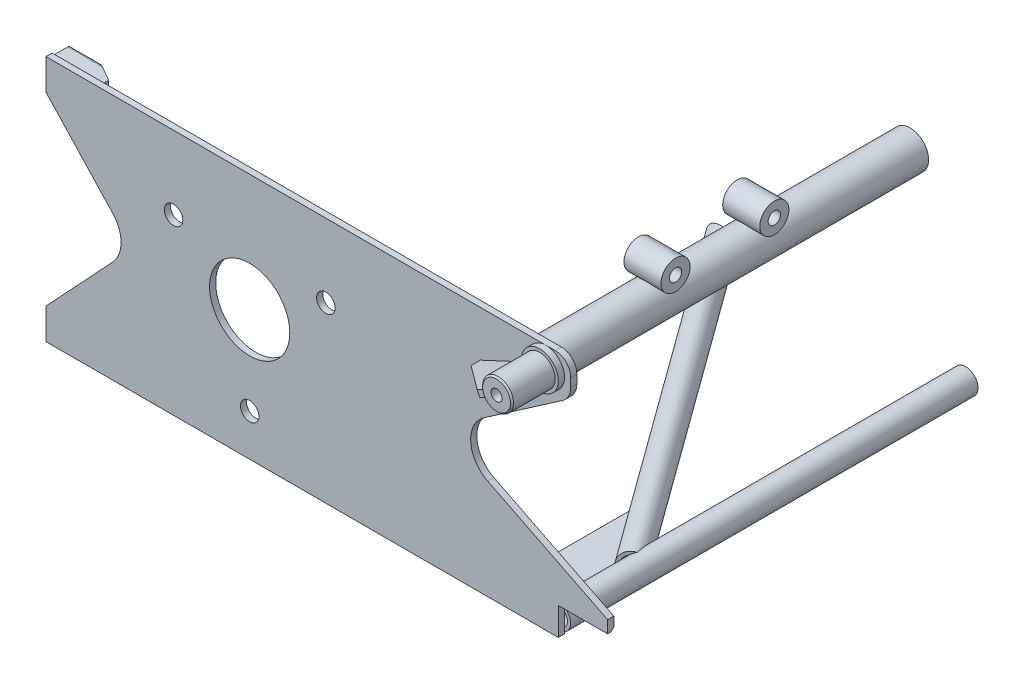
ISO-10303-21;
HEADER;
FILE_DESCRIPTION(('STEP AP214'),'2;1');
FILE_NAME('part.step','',(''),(''),'','','');
FILE_SCHEMA(('AUTOMOTIVE_DESIGN { 1 0 10303 214 1 1 1 1 }'));
ENDSEC;
DATA;
#1=APPLICATION_CONTEXT('core data for automotive mechanical design processes');
#2=APPLICATION_PROTOCOL_DEFINITION('international standard','automotive_design',2000,#1);
#3=PRODUCT_CONTEXT('',#1,'mechanical');
#4=PRODUCT('Part','Part','',(#3));
#5=PRODUCT_RELATED_PRODUCT_CATEGORY('part','',(#4));
#6=PRODUCT_DEFINITION_FORMATION('','',#4);
#7=PRODUCT_DEFINITION_CONTEXT('part definition',#1,'design');
#8=PRODUCT_DEFINITION('design','',#6,#7);
#9=PRODUCT_DEFINITION_SHAPE('','',#8);
#10=(LENGTH_UNIT() NAMED_UNIT(*) SI_UNIT(.MILLI.,.METRE.));
#11=(NAMED_UNIT(*) PLANE_ANGLE_UNIT() SI_UNIT($,.RADIAN.));
#12=(NAMED_UNIT(*) SI_UNIT($,.STERADIAN.) SOLID_ANGLE_UNIT());
#13=UNCERTAINTY_MEASURE_WITH_UNIT(LENGTH_MEASURE(1.E-05),#10,'distance_accuracy_value','');
#14=(GEOMETRIC_REPRESENTATION_CONTEXT(3) GLOBAL_UNCERTAINTY_ASSIGNED_CONTEXT((#13)) GLOBAL_UNIT_ASSIGNED_CONTEXT((#10,
#11,#12)) REPRESENTATION_CONTEXT('',''));
#15=CARTESIAN_POINT('',(0.,0.,0.));
#16=DIRECTION('',(0.,0.,1.));
#17=DIRECTION('',(1.,0.,0.));
#18=AXIS2_PLACEMENT_3D('',#15,#16,#17);
#19=CARTESIAN_POINT('',(136.525,42.418,-130.175));
#20=DIRECTION('',(1.,0.,0.));
#21=DIRECTION('',(0.,0.,-1.));
#22=AXIS2_PLACEMENT_3D('',#19,#20,#21);
#23=PLANE('',#22);
#24=CARTESIAN_POINT('',(136.525,42.418,-130.175));
#25=DIRECTION('',(1.,0.,0.));
#26=DIRECTION('',(0.,0.,-1.));
#27=AXIS2_PLACEMENT_3D('',#24,#25,#26);
#28=CIRCLE('',#27,7.49300000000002);
#29=CARTESIAN_POINT('',(136.525,42.418,-137.668));
#30=VERTEX_POINT('',#29);
#31=EDGE_CURVE('E12',#30,#30,#28,.T.);
#32=ORIENTED_EDGE('',*,*,#31,.T.);
#33=EDGE_LOOP('',(#32));
#34=FACE_BOUND('',#33,.T.);
#35=CARTESIAN_POINT('',(136.525,42.418,-130.175));
#36=DIRECTION('',(1.,0.,0.));
#37=DIRECTION('',(0.,0.,-1.));
#38=AXIS2_PLACEMENT_3D('',#35,#36,#37);
#39=CIRCLE('',#38,3.175);
#40=CARTESIAN_POINT('',(136.525,42.418,-127.));
#41=VERTEX_POINT('',#40);
#42=EDGE_CURVE('E87',#41,#41,#39,.T.);
#43=ORIENTED_EDGE('',*,*,#42,.F.);
#44=EDGE_LOOP('',(#43));
#45=FACE_BOUND('',#44,.T.);
#46=ADVANCED_FACE('F70',(#34,#45),#23,.T.);
#47=CARTESIAN_POINT('',(117.475,42.418,-130.175));
#48=DIRECTION('',(1.,0.,0.));
#49=DIRECTION('',(0.,0.,-1.));
#50=AXIS2_PLACEMENT_3D('',#47,#48,#49);
#51=PLANE('',#50);
#52=CARTESIAN_POINT('',(117.475,42.418,-130.175));
#53=DIRECTION('',(1.,0.,0.));
#54=DIRECTION('',(0.,0.,-1.));
#55=AXIS2_PLACEMENT_3D('',#52,#53,#54);
#56=CIRCLE('',#55,7.49300000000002);
#57=CARTESIAN_POINT('',(117.475,42.418,-137.668));
#58=VERTEX_POINT('',#57);
#59=EDGE_CURVE('E82',#58,#58,#56,.T.);
#60=ORIENTED_EDGE('',*,*,#59,.F.);
#61=EDGE_LOOP('',(#60));
#62=FACE_BOUND('',#61,.T.);
#63=CARTESIAN_POINT('',(117.475,42.418,-130.175));
#64=DIRECTION('',(1.,0.,0.));
#65=DIRECTION('',(0.,0.,-1.));
#66=AXIS2_PLACEMENT_3D('',#63,#64,#65);
#67=CIRCLE('',#66,3.175);
#68=CARTESIAN_POINT('',(117.475,42.418,-127.));
#69=VERTEX_POINT('',#68);
#70=EDGE_CURVE('E89',#69,#69,#67,.T.);
#71=ORIENTED_EDGE('',*,*,#70,.T.);
#72=EDGE_LOOP('',(#71));
#73=FACE_BOUND('',#72,.T.);
#74=ADVANCED_FACE('F99',(#62,#73),#51,.F.);
#75=CARTESIAN_POINT('',(136.525,42.418,-130.175));
#76=DIRECTION('',(-1.,0.,0.));
#77=DIRECTION('',(0.,0.,1.));
#78=AXIS2_PLACEMENT_3D('',#75,#76,#77);
#79=CYLINDRICAL_SURFACE('',#78,7.49300000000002);
#80=CARTESIAN_POINT('',(134.099515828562,34.925,-130.175));
#81=CARTESIAN_POINT('',(134.099515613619,34.9249987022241,-130.331190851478));
#82=CARTESIAN_POINT('',(134.095151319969,34.9298894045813,-130.487365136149));
#83=CARTESIAN_POINT('',(134.077654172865,34.9493715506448,-130.798665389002));
#84=CARTESIAN_POINT('',(134.064518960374,34.9639656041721,-130.953791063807));
#85=CARTESIAN_POINT('',(134.029352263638,35.0026366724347,-131.262008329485));
#86=CARTESIAN_POINT('',(134.007311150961,35.0267239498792,-131.415097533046));
#87=CARTESIAN_POINT('',(133.954170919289,35.0839673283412,-131.717972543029));
#88=CARTESIAN_POINT('',(133.923071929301,35.1171233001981,-131.867758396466));
#89=CARTESIAN_POINT('',(133.851618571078,35.1919192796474,-132.162962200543));
#90=CARTESIAN_POINT('',(133.811263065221,35.2335603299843,-132.308379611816));
#91=CARTESIAN_POINT('',(133.721106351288,35.3245520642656,-132.593776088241));
#92=CARTESIAN_POINT('',(133.671305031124,35.373902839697,-132.733755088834));
#93=CARTESIAN_POINT('',(133.562133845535,35.4793301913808,-133.007202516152));
#94=CARTESIAN_POINT('',(133.502769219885,35.5354030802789,-133.140674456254));
#95=CARTESIAN_POINT('',(133.374377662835,35.6531719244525,-133.400285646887));
#96=CARTESIAN_POINT('',(133.305350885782,35.7148677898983,-133.526425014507));
#97=CARTESIAN_POINT('',(133.158435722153,35.8419543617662,-133.769338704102));
#98=CARTESIAN_POINT('',(133.080646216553,35.9073003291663,-133.886196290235));
#99=CARTESIAN_POINT('',(132.915774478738,36.0409560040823,-134.111434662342));
#100=CARTESIAN_POINT('',(132.828688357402,36.1092669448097,-134.219811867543));
#101=CARTESIAN_POINT('',(132.645556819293,36.2474485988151,-134.427636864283));
#102=CARTESIAN_POINT('',(132.549510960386,36.3173193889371,-134.527084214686));
#103=CARTESIAN_POINT('',(132.348946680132,36.4572164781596,-134.716805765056));
#104=CARTESIAN_POINT('',(132.244431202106,36.5272427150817,-134.807083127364));
#105=CARTESIAN_POINT('',(132.024343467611,36.6681547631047,-134.980955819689));
#106=CARTESIAN_POINT('',(131.908539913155,36.7390075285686,-135.064284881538));
#107=CARTESIAN_POINT('',(131.669239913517,36.8781911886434,-135.221443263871));
#108=CARTESIAN_POINT('',(131.545743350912,36.9465220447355,-135.2952724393));
#109=CARTESIAN_POINT('',(131.291788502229,37.0795121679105,-135.433785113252));
#110=CARTESIAN_POINT('',(131.161328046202,37.1441702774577,-135.498465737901));
#111=CARTESIAN_POINT('',(130.894269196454,37.2687916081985,-135.619100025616));
#112=CARTESIAN_POINT('',(130.757670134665,37.328754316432,-135.675052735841));
#113=CARTESIAN_POINT('',(130.4636676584,37.4494917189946,-135.784486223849));
#114=CARTESIAN_POINT('',(130.305638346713,37.5096172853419,-135.837002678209));
#115=CARTESIAN_POINT('',(129.984061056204,37.6221006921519,-135.932590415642));
#116=CARTESIAN_POINT('',(129.82051273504,37.6744580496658,-135.975661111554));
#117=CARTESIAN_POINT('',(129.488846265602,37.7707109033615,-136.053058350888));
#118=CARTESIAN_POINT('',(129.320726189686,37.8146027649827,-136.087381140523));
#119=CARTESIAN_POINT('',(128.980942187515,37.8933645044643,-136.147870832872));
#120=CARTESIAN_POINT('',(128.80927800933,37.928233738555,-136.174037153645));
#121=CARTESIAN_POINT('',(128.438796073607,37.9928379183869,-136.221886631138));
#122=CARTESIAN_POINT('',(128.239577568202,38.0211451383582,-136.242409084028));
#123=CARTESIAN_POINT('',(127.839003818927,38.0651163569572,-136.27403131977));
#124=CARTESIAN_POINT('',(127.637648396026,38.0807792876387,-136.285130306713));
#125=CARTESIAN_POINT('',(127.233942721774,38.0992713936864,-136.29821500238));
#126=CARTESIAN_POINT('',(127.031591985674,38.1020935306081,-136.300195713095));
#127=CARTESIAN_POINT('',(126.627234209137,38.0948511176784,-136.295085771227));
#128=CARTESIAN_POINT('',(126.425227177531,38.0847862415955,-136.287994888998));
#129=CARTESIAN_POINT('',(126.007499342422,38.0506394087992,-136.26365277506));
#130=CARTESIAN_POINT('',(125.791901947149,38.0255511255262,-136.2456709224));
#131=CARTESIAN_POINT('',(125.364109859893,37.9609621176,-136.198409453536));
#132=CARTESIAN_POINT('',(125.15191540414,37.9214603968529,-136.169129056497));
#133=CARTESIAN_POINT('',(124.732588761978,37.8286792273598,-136.098393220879));
#134=CARTESIAN_POINT('',(124.525457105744,37.7753983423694,-136.056936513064));
#135=CARTESIAN_POINT('',(124.118076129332,37.6560338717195,-135.960723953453));
#136=CARTESIAN_POINT('',(123.917826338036,37.5899511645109,-135.905969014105));
#137=CARTESIAN_POINT('',(123.532883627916,37.4488540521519,-135.784012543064));
#138=CARTESIAN_POINT('',(123.347892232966,37.3742273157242,-135.717306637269));
#139=CARTESIAN_POINT('',(122.987898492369,37.2160248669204,-135.569093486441));
#140=CARTESIAN_POINT('',(122.812896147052,37.1324491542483,-135.487586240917));
#141=CARTESIAN_POINT('',(122.474967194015,36.9586598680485,-135.308825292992));
#142=CARTESIAN_POINT('',(122.312023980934,36.868455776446,-135.211593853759));
#143=CARTESIAN_POINT('',(121.999736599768,36.6839988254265,-135.000545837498));
#144=CARTESIAN_POINT('',(121.850389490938,36.5897468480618,-134.886732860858));
#145=CARTESIAN_POINT('',(121.5867393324,36.4136065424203,-134.659415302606));
#146=CARTESIAN_POINT('',(121.470458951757,36.3318380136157,-134.548105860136));
#147=CARTESIAN_POINT('',(121.249878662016,36.1697650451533,-134.313230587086));
#148=CARTESIAN_POINT('',(121.145577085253,36.0894604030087,-134.189666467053));
#149=CARTESIAN_POINT('',(120.949534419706,35.9325310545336,-133.930879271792));
#150=CARTESIAN_POINT('',(120.857788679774,35.8559049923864,-133.795660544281));
#151=CARTESIAN_POINT('',(120.687103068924,35.708420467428,-133.514429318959));
#152=CARTESIAN_POINT('',(120.608162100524,35.6375615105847,-133.368417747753));
#153=CARTESIAN_POINT('',(120.471951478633,35.5116948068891,-133.085158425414));
#154=CARTESIAN_POINT('',(120.413213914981,35.4558072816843,-132.949003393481));
#155=CARTESIAN_POINT('',(120.305553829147,35.3511092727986,-132.670248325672));
#156=CARTESIAN_POINT('',(120.256630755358,35.3022983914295,-132.527648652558));
#157=CARTESIAN_POINT('',(120.168432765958,35.2127156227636,-132.237049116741));
#158=CARTESIAN_POINT('',(120.129157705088,35.1719436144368,-132.089049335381));
#159=CARTESIAN_POINT('',(120.060051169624,35.0992052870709,-131.788741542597));
#160=CARTESIAN_POINT('',(120.030219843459,35.0672391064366,-131.6364334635));
#161=CARTESIAN_POINT('',(119.980330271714,35.0132594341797,-131.331845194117));
#162=CARTESIAN_POINT('',(119.96008166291,34.9910527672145,-131.179630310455));
#163=CARTESIAN_POINT('',(119.928295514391,34.9560016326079,-130.873160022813));
#164=CARTESIAN_POINT('',(119.916761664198,34.9431611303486,-130.718903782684));
#165=CARTESIAN_POINT('',(119.902325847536,34.9270676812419,-130.409484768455));
#166=CARTESIAN_POINT('',(119.899424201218,34.9238150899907,-130.254321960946));
#167=CARTESIAN_POINT('',(119.902228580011,34.9269500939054,-129.944239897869));
#168=CARTESIAN_POINT('',(119.907930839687,34.9333334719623,-129.789320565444));
#169=CARTESIAN_POINT('',(119.928099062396,34.9557579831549,-129.478956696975));
#170=CARTESIAN_POINT('',(119.94266498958,34.9719092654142,-129.323526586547));
#171=CARTESIAN_POINT('',(119.980762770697,35.0136902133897,-129.015055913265));
#172=CARTESIAN_POINT('',(120.004294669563,35.0393199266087,-128.862015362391));
#173=CARTESIAN_POINT('',(120.060491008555,35.099610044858,-128.559447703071));
#174=CARTESIAN_POINT('',(120.09315435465,35.134269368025,-128.409920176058));
#175=CARTESIAN_POINT('',(120.167810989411,35.2119962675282,-128.115449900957));
#176=CARTESIAN_POINT('',(120.209804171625,35.2550637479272,-127.970507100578));
#177=CARTESIAN_POINT('',(120.303068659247,35.3485566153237,-127.686991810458));
#178=CARTESIAN_POINT('',(120.354290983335,35.3989428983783,-127.548390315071));
#179=CARTESIAN_POINT('',(120.466298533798,35.5062611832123,-127.27774137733));
#180=CARTESIAN_POINT('',(120.527083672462,35.5631931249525,-127.145693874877));
#181=CARTESIAN_POINT('',(120.658259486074,35.6824469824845,-126.889061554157));
#182=CARTESIAN_POINT('',(120.728647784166,35.7447675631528,-126.764474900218));
#183=CARTESIAN_POINT('',(120.87898354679,35.8735322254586,-126.523471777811));
#184=CARTESIAN_POINT('',(120.958930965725,35.9399762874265,-126.407055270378));
#185=CARTESIAN_POINT('',(121.127621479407,36.0751597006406,-126.183715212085));
#186=CARTESIAN_POINT('',(121.216302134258,36.1438807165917,-126.076733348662));
#187=CARTESIAN_POINT('',(121.402604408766,36.282676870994,-125.871723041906));
#188=CARTESIAN_POINT('',(121.500229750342,36.3527525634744,-125.773698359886));
#189=CARTESIAN_POINT('',(121.703932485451,36.4928642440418,-125.586812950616));
#190=CARTESIAN_POINT('',(121.810010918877,36.5629002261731,-125.497953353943));
#191=CARTESIAN_POINT('',(122.029989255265,36.7015933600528,-125.329419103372));
#192=CARTESIAN_POINT('',(122.143886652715,36.7702509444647,-125.249741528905));
#193=CARTESIAN_POINT('',(122.384938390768,36.9084935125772,-125.095466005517));
#194=CARTESIAN_POINT('',(122.512473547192,36.9779434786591,-125.021342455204));
#195=CARTESIAN_POINT('',(122.774661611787,37.112791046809,-124.882631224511));
#196=CARTESIAN_POINT('',(122.909314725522,37.1781885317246,-124.818043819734));
#197=CARTESIAN_POINT('',(123.184930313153,37.3039070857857,-124.69789599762));
#198=CARTESIAN_POINT('',(123.325895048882,37.3642263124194,-124.642338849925));
#199=CARTESIAN_POINT('',(123.613244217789,37.4789007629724,-124.539729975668));
#200=CARTESIAN_POINT('',(123.759629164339,37.5332554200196,-124.492679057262));
#201=CARTESIAN_POINT('',(124.076280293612,37.6419186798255,-124.400937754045));
#202=CARTESIAN_POINT('',(124.247181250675,37.6953068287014,-124.357345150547));
#203=CARTESIAN_POINT('',(124.593699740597,37.7927953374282,-124.27954244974));
#204=CARTESIAN_POINT('',(124.769317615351,37.8368950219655,-124.245333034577));
#205=CARTESIAN_POINT('',(125.124271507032,37.9152524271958,-124.185614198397));
#206=CARTESIAN_POINT('',(125.303609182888,37.9495056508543,-124.160108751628));
#207=CARTESIAN_POINT('',(125.66490771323,38.0077432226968,-124.117278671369));
#208=CARTESIAN_POINT('',(125.846868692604,38.0317270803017,-124.0999544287));
#209=CARTESIAN_POINT('',(126.236395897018,38.0716156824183,-124.071338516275));
#210=CARTESIAN_POINT('',(126.444194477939,38.0860509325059,-124.061134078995));
#211=CARTESIAN_POINT('',(126.860549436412,38.101257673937,-124.05038835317));
#212=CARTESIAN_POINT('',(127.069105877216,38.1020279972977,-124.049847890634));
#213=CARTESIAN_POINT('',(127.485765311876,38.0898893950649,-124.058418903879));
#214=CARTESIAN_POINT('',(127.69386790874,38.0769713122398,-124.067536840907));
#215=CARTESIAN_POINT('',(128.10811465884,38.0376103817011,-124.095705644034));
#216=CARTESIAN_POINT('',(128.314258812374,38.0111675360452,-124.114756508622));
#217=CARTESIAN_POINT('',(128.732708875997,37.9435813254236,-124.164469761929));
#218=CARTESIAN_POINT('',(128.944855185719,37.9018111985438,-124.195631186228));
#219=CARTESIAN_POINT('',(129.363784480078,37.8045387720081,-124.270359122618));
#220=CARTESIAN_POINT('',(129.570566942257,37.7490351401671,-124.313926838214));
#221=CARTESIAN_POINT('',(129.976707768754,37.6254056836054,-124.414580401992));
#222=CARTESIAN_POINT('',(130.176073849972,37.5572934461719,-124.471651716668));
#223=CARTESIAN_POINT('',(130.565639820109,37.4098835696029,-124.600647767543));
#224=CARTESIAN_POINT('',(130.755842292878,37.3305891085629,-124.67256828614));
#225=CARTESIAN_POINT('',(131.085244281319,37.1809129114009,-124.815315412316));
#226=CARTESIAN_POINT('',(131.226599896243,37.1122945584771,-124.88303583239));
#227=CARTESIAN_POINT('',(131.501438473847,36.9706274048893,-125.028980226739));
#228=CARTESIAN_POINT('',(131.634922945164,36.8975794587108,-125.107202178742));
#229=CARTESIAN_POINT('',(131.892988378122,36.7485232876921,-125.274528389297));
#230=CARTESIAN_POINT('',(132.017575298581,36.6725170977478,-125.363625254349));
#231=CARTESIAN_POINT('',(132.257068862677,36.5191220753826,-125.552973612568));
#232=CARTESIAN_POINT('',(132.371975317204,36.4417332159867,-125.653225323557));
#233=CARTESIAN_POINT('',(132.591865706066,36.2869923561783,-125.865347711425));
#234=CARTESIAN_POINT('',(132.696800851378,36.209642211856,-125.977270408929));
#235=CARTESIAN_POINT('',(132.895558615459,36.0572259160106,-126.212023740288));
#236=CARTESIAN_POINT('',(132.989381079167,35.9821597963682,-126.334854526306));
#237=CARTESIAN_POINT('',(133.165567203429,35.8361643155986,-126.59084008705));
#238=CARTESIAN_POINT('',(133.247927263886,35.7652362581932,-126.723998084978));
#239=CARTESIAN_POINT('',(133.40098970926,35.6293205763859,-126.999705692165));
#240=CARTESIAN_POINT('',(133.471693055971,35.5643324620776,-127.142254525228));
#241=CARTESIAN_POINT('',(133.596025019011,35.4470274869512,-127.42330947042));
#242=CARTESIAN_POINT('',(133.650588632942,35.3941049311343,-127.561150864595));
#243=CARTESIAN_POINT('',(133.750088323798,35.2956276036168,-127.842809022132));
#244=CARTESIAN_POINT('',(133.795024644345,35.2500726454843,-127.986625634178));
#245=CARTESIAN_POINT('',(133.875405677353,35.1672494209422,-128.279023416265));
#246=CARTESIAN_POINT('',(133.910861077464,35.1299718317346,-128.427599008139));
#247=CARTESIAN_POINT('',(133.972537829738,35.0643271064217,-128.728534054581));
#248=CARTESIAN_POINT('',(133.998761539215,35.0359576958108,-128.880892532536));
#249=CARTESIAN_POINT('',(134.046921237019,34.9834382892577,-129.221978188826));
#250=CARTESIAN_POINT('',(134.066665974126,34.9615671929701,-129.41137337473));
#251=CARTESIAN_POINT('',(134.092963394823,34.9323488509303,-129.792187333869));
#252=CARTESIAN_POINT('',(134.099516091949,34.9250015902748,-129.983606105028));
#253=CARTESIAN_POINT('',(134.099515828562,34.925,-130.175));
#254=B_SPLINE_CURVE_WITH_KNOTS('',3,(#80,#81,#82,#83,#84,#85,#86,#87,#88,#89,#90,#91,#92,#93,
#94,#95,#96,#97,#98,#99,#100,#101,#102,#103,#104,#105,#106,#107,#108,#109,#110,#111,#112,#113,
#114,#115,#116,#117,#118,#119,#120,#121,#122,#123,#124,#125,#126,#127,#128,#129,#130,#131,#132,
#133,#134,#135,#136,#137,#138,#139,#140,#141,#142,#143,#144,#145,#146,#147,#148,#149,#150,#151,
#152,#153,#154,#155,#156,#157,#158,#159,#160,#161,#162,#163,#164,#165,#166,#167,#168,#169,#170,
#171,#172,#173,#174,#175,#176,#177,#178,#179,#180,#181,#182,#183,#184,#185,#186,#187,#188,#189,
#190,#191,#192,#193,#194,#195,#196,#197,#198,#199,#200,#201,#202,#203,#204,#205,#206,#207,#208,
#209,#210,#211,#212,#213,#214,#215,#216,#217,#218,#219,#220,#221,#222,#223,#224,#225,#226,#227,
#228,#229,#230,#231,#232,#233,#234,#235,#236,#237,#238,#239,#240,#241,#242,#243,#244,#245,#246,
#247,#248,#249,#250,#251,#252,#253),.UNSPECIFIED.,.T.,.F.,(4,2,2,2,2,2,2,2,2,2,2,2,2,2,2,2,2,2,
2,2,2,2,2,2,2,2,2,2,2,2,2,2,2,2,2,2,2,2,2,2,2,2,2,2,2,2,2,2,2,2,2,2,2,2,2,2,2,2,2,2,2,2,2,2,2,2,
2,2,2,2,2,2,2,2,2,2,2,2,2,2,2,2,2,2,2,2,4),(0.,0.468406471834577,0.936938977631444,
1.40597938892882,1.87501312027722,2.34410452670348,2.81320149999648,3.28204232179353,
3.75087565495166,4.21486708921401,4.6790533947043,5.1432626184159,5.60731120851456,
6.08468320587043,6.56206249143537,7.03959140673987,7.51717241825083,8.04778241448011,
8.57842538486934,9.10929567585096,9.64020383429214,10.2463438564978,10.8525350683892,
11.4590585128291,12.0655973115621,12.7181924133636,13.3708326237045,14.0235408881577,
14.676204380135,15.306308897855,15.9364134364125,16.5656335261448,17.1947171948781,
17.735578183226,18.2763637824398,18.8169485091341,19.3574868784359,19.8323080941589,
20.3071026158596,20.7818899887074,21.256684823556,21.7216045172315,22.1867209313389,
22.651854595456,23.1167847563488,23.5870581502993,24.0573339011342,24.5275533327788,
24.9977673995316,25.4655557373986,25.9333397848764,26.4010082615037,26.8686745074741,
27.3332111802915,27.7979420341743,28.2627301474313,28.7273700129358,29.2159903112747,
29.7046247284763,30.1934356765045,30.6822930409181,31.2345594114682,31.7868659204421,
32.3394242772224,32.8920090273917,33.5169648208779,34.1419740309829,34.7674016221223,
35.3928291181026,36.0473575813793,36.7019495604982,37.3558402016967,38.0095453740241,
38.5223351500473,39.035026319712,39.5473708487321,40.0597253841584,40.5744700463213,
41.0892218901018,41.6041350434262,42.1190056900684,42.5906664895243,43.0623153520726,
43.5334302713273,44.0044248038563,44.5784035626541,45.1523817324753),.UNSPECIFIED.);
#255=CARTESIAN_POINT('',(134.099515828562,34.925,-130.175));
#256=VERTEX_POINT('',#255);
#257=EDGE_CURVE('E75',#256,#256,#254,.T.);
#258=ORIENTED_EDGE('',*,*,#257,.T.);
#259=EDGE_LOOP('',(#258));
#260=FACE_BOUND('',#259,.T.);
#261=ORIENTED_EDGE('',*,*,#31,.F.);
#262=EDGE_LOOP('',(#261));
#263=FACE_BOUND('',#262,.T.);
#264=ORIENTED_EDGE('',*,*,#59,.T.);
#265=EDGE_LOOP('',(#264));
#266=FACE_BOUND('',#265,.T.);
#267=ADVANCED_FACE('F72',(#260,#263,#266),#79,.T.);
#268=CARTESIAN_POINT('',(136.525,42.418,-130.175));
#269=DIRECTION('',(-1.,0.,0.));
#270=DIRECTION('',(0.,0.,1.));
#271=AXIS2_PLACEMENT_3D('',#268,#269,#270);
#272=CYLINDRICAL_SURFACE('',#271,3.175);
#273=CARTESIAN_POINT('',(136.525,42.418,-127.));
#274=CARTESIAN_POINT('',(136.3265625,42.418,-127.));
#275=CARTESIAN_POINT('',(136.128125,42.418,-127.));
#276=CARTESIAN_POINT('',(135.73125,42.418,-127.));
#277=CARTESIAN_POINT('',(135.5328125,42.418,-127.));
#278=CARTESIAN_POINT('',(135.1359375,42.418,-127.));
#279=CARTESIAN_POINT('',(134.9375,42.418,-127.));
#280=CARTESIAN_POINT('',(134.540625,42.418,-127.));
#281=CARTESIAN_POINT('',(134.3421875,42.418,-127.));
#282=CARTESIAN_POINT('',(133.9453125,42.418,-127.));
#283=CARTESIAN_POINT('',(133.746875,42.418,-127.));
#284=CARTESIAN_POINT('',(133.35,42.418,-127.));
#285=CARTESIAN_POINT('',(133.1515625,42.418,-127.));
#286=CARTESIAN_POINT('',(132.7546875,42.418,-127.));
#287=CARTESIAN_POINT('',(132.55625,42.418,-127.));
#288=CARTESIAN_POINT('',(132.159375,42.418,-127.));
#289=CARTESIAN_POINT('',(131.9609375,42.418,-127.));
#290=CARTESIAN_POINT('',(131.5640625,42.418,-127.));
#291=CARTESIAN_POINT('',(131.365625,42.418,-127.));
#292=CARTESIAN_POINT('',(130.96875,42.418,-127.));
#293=CARTESIAN_POINT('',(130.7703125,42.418,-127.));
#294=CARTESIAN_POINT('',(130.3734375,42.418,-127.));
#295=CARTESIAN_POINT('',(130.175,42.418,-127.));
#296=CARTESIAN_POINT('',(129.778125,42.418,-127.));
#297=CARTESIAN_POINT('',(129.5796875,42.418,-127.));
#298=CARTESIAN_POINT('',(129.1828125,42.418,-127.));
#299=CARTESIAN_POINT('',(128.984375,42.418,-127.));
#300=CARTESIAN_POINT('',(128.5875,42.418,-127.));
#301=CARTESIAN_POINT('',(128.3890625,42.418,-127.));
#302=CARTESIAN_POINT('',(127.9921875,42.418,-127.));
#303=CARTESIAN_POINT('',(127.79375,42.418,-127.));
#304=CARTESIAN_POINT('',(127.396875,42.418,-127.));
#305=CARTESIAN_POINT('',(127.1984375,42.418,-127.));
#306=CARTESIAN_POINT('',(126.8015625,42.418,-127.));
#307=CARTESIAN_POINT('',(126.603125,42.418,-127.));
#308=CARTESIAN_POINT('',(126.20625,42.418,-127.));
#309=CARTESIAN_POINT('',(126.0078125,42.418,-127.));
#310=CARTESIAN_POINT('',(125.6109375,42.418,-127.));
#311=CARTESIAN_POINT('',(125.4125,42.418,-127.));
#312=CARTESIAN_POINT('',(125.015625,42.418,-127.));
#313=CARTESIAN_POINT('',(124.8171875,42.418,-127.));
#314=CARTESIAN_POINT('',(124.4203125,42.418,-127.));
#315=CARTESIAN_POINT('',(124.221875,42.418,-127.));
#316=CARTESIAN_POINT('',(123.825,42.418,-127.));
#317=CARTESIAN_POINT('',(123.6265625,42.418,-127.));
#318=CARTESIAN_POINT('',(123.2296875,42.418,-127.));
#319=CARTESIAN_POINT('',(123.03125,42.418,-127.));
#320=CARTESIAN_POINT('',(122.634375,42.418,-127.));
#321=CARTESIAN_POINT('',(122.4359375,42.418,-127.));
#322=CARTESIAN_POINT('',(122.0390625,42.418,-127.));
#323=CARTESIAN_POINT('',(121.840625,42.418,-127.));
#324=CARTESIAN_POINT('',(121.44375,42.418,-127.));
#325=CARTESIAN_POINT('',(121.2453125,42.418,-127.));
#326=CARTESIAN_POINT('',(120.8484375,42.418,-127.));
#327=CARTESIAN_POINT('',(120.65,42.418,-127.));
#328=CARTESIAN_POINT('',(120.253125,42.418,-127.));
#329=CARTESIAN_POINT('',(120.0546875,42.418,-127.));
#330=CARTESIAN_POINT('',(119.6578125,42.418,-127.));
#331=CARTESIAN_POINT('',(119.459375,42.418,-127.));
#332=CARTESIAN_POINT('',(119.0625,42.418,-127.));
#333=CARTESIAN_POINT('',(118.8640625,42.418,-127.));
#334=CARTESIAN_POINT('',(118.4671875,42.418,-127.));
#335=CARTESIAN_POINT('',(118.26875,42.418,-127.));
#336=CARTESIAN_POINT('',(117.871875,42.418,-127.));
#337=CARTESIAN_POINT('',(117.6734375,42.418,-127.));
#338=CARTESIAN_POINT('',(117.475,42.418,-127.));
#339=B_SPLINE_CURVE_WITH_KNOTS('',3,(#273,#274,#275,#276,#277,#278,#279,#280,#281,#282,#283,
#284,#285,#286,#287,#288,#289,#290,#291,#292,#293,#294,#295,#296,#297,#298,#299,#300,#301,#302,
#303,#304,#305,#306,#307,#308,#309,#310,#311,#312,#313,#314,#315,#316,#317,#318,#319,#320,#321,
#322,#323,#324,#325,#326,#327,#328,#329,#330,#331,#332,#333,#334,#335,#336,#337,#338),
.UNSPECIFIED.,.F.,.F.,(4,2,2,2,2,2,2,2,2,2,2,2,2,2,2,2,2,2,2,2,2,2,2,2,2,2,2,2,2,2,2,2,4),(0.,
0.595312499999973,1.19062499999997,1.78593749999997,2.38124999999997,2.97656249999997,
3.57187499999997,4.16718749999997,4.76249999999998,5.35781249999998,5.95312499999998,
6.54843749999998,7.14374999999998,7.73906249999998,8.33437499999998,8.92968749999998,
9.52499999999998,10.1203125,10.715625,11.3109375,11.90625,12.5015625,13.096875,13.6921875,
14.2875,14.8828125,15.478125,16.0734375,16.66875,17.2640625,17.859375,18.4546875,19.05),.UNSPECIFIED.);
#340=EDGE_CURVE('BSEAM95',#41,#69,#339,.T.);
#341=ORIENTED_EDGE('',*,*,#42,.T.);
#342=ORIENTED_EDGE('',*,*,#70,.F.);
#343=ORIENTED_EDGE('',*,*,#340,.T.);
#344=ORIENTED_EDGE('',*,*,#340,.F.);
#345=EDGE_LOOP('',(#341,#343,#342,#344));
#346=FACE_BOUND('',#345,.T.);
#347=ADVANCED_FACE('F95',(#346),#272,.F.);
#348=CARTESIAN_POINT('',(127.,28.575,-166.37));
#349=DIRECTION('',(0.,0.,1.));
#350=DIRECTION('',(1.,0.,0.));
#351=AXIS2_PLACEMENT_3D('',#348,#349,#350);
#352=CYLINDRICAL_SURFACE('',#351,9.525);
#353=ORIENTED_EDGE('',*,*,#257,.F.);
#354=EDGE_LOOP('',(#353));
#355=FACE_BOUND('',#354,.T.);
#356=ADVANCED_FACE('F107',(#355),#352,.F.);
#357=CLOSED_SHELL('',(#46,#74,#267,#347,#356));
#358=MANIFOLD_SOLID_BREP('B2',#357);
#359=CARTESIAN_POINT('',(136.525,42.418,-79.375));
#360=DIRECTION('',(1.,0.,0.));
#361=DIRECTION('',(0.,0.,-1.));
#362=AXIS2_PLACEMENT_3D('',#359,#360,#361);
#363=PLANE('',#362);
#364=CARTESIAN_POINT('',(136.525,42.418,-79.375));
#365=DIRECTION('',(1.,0.,0.));
#366=DIRECTION('',(0.,0.,-1.));
#367=AXIS2_PLACEMENT_3D('',#364,#365,#366);
#368=CIRCLE('',#367,7.493);
#369=CARTESIAN_POINT('',(136.525,42.418,-86.868));
#370=VERTEX_POINT('',#369);
#371=EDGE_CURVE('E69',#370,#370,#368,.T.);
#372=ORIENTED_EDGE('',*,*,#371,.T.);
#373=EDGE_LOOP('',(#372));
#374=FACE_BOUND('',#373,.T.);
#375=CARTESIAN_POINT('',(136.525,42.418,-79.375));
#376=DIRECTION('',(1.,0.,0.));
#377=DIRECTION('',(0.,0.,-1.));
#378=AXIS2_PLACEMENT_3D('',#375,#376,#377);
#379=CIRCLE('',#378,3.175);
#380=CARTESIAN_POINT('',(136.525,42.418,-76.2));
#381=VERTEX_POINT('',#380);
#382=EDGE_CURVE('E168',#381,#381,#379,.T.);
#383=ORIENTED_EDGE('',*,*,#382,.F.);
#384=EDGE_LOOP('',(#383));
#385=FACE_BOUND('',#384,.T.);
#386=ADVANCED_FACE('F151',(#374,#385),#363,.T.);
#387=CARTESIAN_POINT('',(117.475,42.418,-79.375));
#388=DIRECTION('',(1.,0.,0.));
#389=DIRECTION('',(0.,0.,-1.));
#390=AXIS2_PLACEMENT_3D('',#387,#388,#389);
#391=PLANE('',#390);
#392=CARTESIAN_POINT('',(117.475,42.418,-79.375));
#393=DIRECTION('',(1.,0.,0.));
#394=DIRECTION('',(0.,0.,-1.));
#395=AXIS2_PLACEMENT_3D('',#392,#393,#394);
#396=CIRCLE('',#395,7.493);
#397=CARTESIAN_POINT('',(117.475,42.418,-86.868));
#398=VERTEX_POINT('',#397);
#399=EDGE_CURVE('E163',#398,#398,#396,.T.);
#400=ORIENTED_EDGE('',*,*,#399,.F.);
#401=EDGE_LOOP('',(#400));
#402=FACE_BOUND('',#401,.T.);
#403=CARTESIAN_POINT('',(117.475,42.418,-79.375));
#404=DIRECTION('',(1.,0.,0.));
#405=DIRECTION('',(0.,0.,-1.));
#406=AXIS2_PLACEMENT_3D('',#403,#404,#405);
#407=CIRCLE('',#406,3.175);
#408=CARTESIAN_POINT('',(117.475,42.418,-76.2));
#409=VERTEX_POINT('',#408);
#410=EDGE_CURVE('E170',#409,#409,#407,.T.);
#411=ORIENTED_EDGE('',*,*,#410,.T.);
#412=EDGE_LOOP('',(#411));
#413=FACE_BOUND('',#412,.T.);
#414=ADVANCED_FACE('F180',(#402,#413),#391,.F.);
#415=CARTESIAN_POINT('',(136.525,42.418,-79.375));
#416=DIRECTION('',(-1.,0.,0.));
#417=DIRECTION('',(0.,0.,1.));
#418=AXIS2_PLACEMENT_3D('',#415,#416,#417);
#419=CYLINDRICAL_SURFACE('',#418,7.493);
#420=CARTESIAN_POINT('',(134.099515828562,34.925,-79.375));
#421=CARTESIAN_POINT('',(134.099515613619,34.9249987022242,-79.5311908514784));
#422=CARTESIAN_POINT('',(134.095151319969,34.9298894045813,-79.6873651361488));
#423=CARTESIAN_POINT('',(134.077654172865,34.9493715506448,-79.9986653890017));
#424=CARTESIAN_POINT('',(134.064518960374,34.9639656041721,-80.1537910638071));
#425=CARTESIAN_POINT('',(134.029352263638,35.0026366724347,-80.4620083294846));
#426=CARTESIAN_POINT('',(134.007311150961,35.0267239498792,-80.6150975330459));
#427=CARTESIAN_POINT('',(133.954170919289,35.0839673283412,-80.9179725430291));
#428=CARTESIAN_POINT('',(133.923071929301,35.1171233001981,-81.067758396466));
#429=CARTESIAN_POINT('',(133.851618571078,35.1919192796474,-81.3629622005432));
#430=CARTESIAN_POINT('',(133.811263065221,35.2335603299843,-81.5083796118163));
#431=CARTESIAN_POINT('',(133.721106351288,35.3245520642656,-81.7937760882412));
#432=CARTESIAN_POINT('',(133.671305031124,35.373902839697,-81.9337550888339));
#433=CARTESIAN_POINT('',(133.562133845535,35.4793301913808,-82.2072025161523));
#434=CARTESIAN_POINT('',(133.502769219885,35.5354030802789,-82.3406744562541));
#435=CARTESIAN_POINT('',(133.374377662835,35.6531719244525,-82.600285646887));
#436=CARTESIAN_POINT('',(133.305350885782,35.7148677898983,-82.7264250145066));
#437=CARTESIAN_POINT('',(133.158435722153,35.8419543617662,-82.9693387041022));
#438=CARTESIAN_POINT('',(133.080646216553,35.9073003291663,-83.0861962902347));
#439=CARTESIAN_POINT('',(132.915774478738,36.0409560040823,-83.3114346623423));
#440=CARTESIAN_POINT('',(132.828688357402,36.1092669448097,-83.4198118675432));
#441=CARTESIAN_POINT('',(132.645556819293,36.2474485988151,-83.6276368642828));
#442=CARTESIAN_POINT('',(132.549510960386,36.3173193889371,-83.7270842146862));
#443=CARTESIAN_POINT('',(132.348946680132,36.4572164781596,-83.9168057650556));
#444=CARTESIAN_POINT('',(132.244431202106,36.5272427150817,-84.007083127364));
#445=CARTESIAN_POINT('',(132.024343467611,36.6681547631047,-84.1809558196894));
#446=CARTESIAN_POINT('',(131.908539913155,36.7390075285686,-84.2642848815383));
#447=CARTESIAN_POINT('',(131.669239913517,36.8781911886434,-84.4214432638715));
#448=CARTESIAN_POINT('',(131.545743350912,36.9465220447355,-84.4952724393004));
#449=CARTESIAN_POINT('',(131.291788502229,37.0795121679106,-84.6337851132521));
#450=CARTESIAN_POINT('',(131.161328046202,37.1441702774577,-84.698465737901));
#451=CARTESIAN_POINT('',(130.894269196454,37.2687916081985,-84.8191000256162));
#452=CARTESIAN_POINT('',(130.757670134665,37.328754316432,-84.8750527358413));
#453=CARTESIAN_POINT('',(130.4636676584,37.4494917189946,-84.9844862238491));
#454=CARTESIAN_POINT('',(130.305638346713,37.5096172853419,-85.0370026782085));
#455=CARTESIAN_POINT('',(129.984061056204,37.6221006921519,-85.1325904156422));
#456=CARTESIAN_POINT('',(129.82051273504,37.6744580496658,-85.1756611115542));
#457=CARTESIAN_POINT('',(129.488846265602,37.7707109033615,-85.2530583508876));
#458=CARTESIAN_POINT('',(129.320726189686,37.8146027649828,-85.2873811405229));
#459=CARTESIAN_POINT('',(128.980942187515,37.8933645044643,-85.3478708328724));
#460=CARTESIAN_POINT('',(128.80927800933,37.928233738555,-85.3740371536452));
#461=CARTESIAN_POINT('',(128.438796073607,37.9928379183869,-85.4218866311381));
#462=CARTESIAN_POINT('',(128.239577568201,38.0211451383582,-85.4424090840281));
#463=CARTESIAN_POINT('',(127.839003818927,38.0651163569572,-85.47403131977));
#464=CARTESIAN_POINT('',(127.637648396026,38.0807792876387,-85.4851303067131));
#465=CARTESIAN_POINT('',(127.233942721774,38.0992713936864,-85.4982150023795));
#466=CARTESIAN_POINT('',(127.031591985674,38.1020935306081,-85.5001957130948));
#467=CARTESIAN_POINT('',(126.627234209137,38.0948511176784,-85.4950857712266));
#468=CARTESIAN_POINT('',(126.425227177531,38.0847862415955,-85.487994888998));
#469=CARTESIAN_POINT('',(126.007499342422,38.0506394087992,-85.4636527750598));
#470=CARTESIAN_POINT('',(125.791901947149,38.0255511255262,-85.4456709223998));
#471=CARTESIAN_POINT('',(125.364109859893,37.9609621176,-85.3984094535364));
#472=CARTESIAN_POINT('',(125.15191540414,37.9214603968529,-85.3691290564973));
#473=CARTESIAN_POINT('',(124.732588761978,37.8286792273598,-85.2983932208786));
#474=CARTESIAN_POINT('',(124.525457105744,37.7753983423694,-85.256936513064));
#475=CARTESIAN_POINT('',(124.118076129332,37.6560338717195,-85.1607239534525));
#476=CARTESIAN_POINT('',(123.917826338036,37.5899511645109,-85.1059690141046));
#477=CARTESIAN_POINT('',(123.532883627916,37.4488540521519,-84.9840125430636));
#478=CARTESIAN_POINT('',(123.347892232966,37.3742273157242,-84.9173066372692));
#479=CARTESIAN_POINT('',(122.987898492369,37.2160248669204,-84.7690934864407));
#480=CARTESIAN_POINT('',(122.812896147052,37.1324491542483,-84.6875862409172));
#481=CARTESIAN_POINT('',(122.474967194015,36.9586598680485,-84.5088252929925));
#482=CARTESIAN_POINT('',(122.312023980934,36.868455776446,-84.4115938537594));
#483=CARTESIAN_POINT('',(121.999736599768,36.6839988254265,-84.200545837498));
#484=CARTESIAN_POINT('',(121.850389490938,36.5897468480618,-84.0867328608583));
#485=CARTESIAN_POINT('',(121.5867393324,36.4136065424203,-83.8594153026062));
#486=CARTESIAN_POINT('',(121.470458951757,36.3318380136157,-83.7481058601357));
#487=CARTESIAN_POINT('',(121.249878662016,36.1697650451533,-83.5132305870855));
#488=CARTESIAN_POINT('',(121.145577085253,36.0894604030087,-83.3896664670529));
#489=CARTESIAN_POINT('',(120.949534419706,35.9325310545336,-83.1308792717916));
#490=CARTESIAN_POINT('',(120.857788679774,35.8559049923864,-82.9956605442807));
#491=CARTESIAN_POINT('',(120.687103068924,35.708420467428,-82.7144293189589));
#492=CARTESIAN_POINT('',(120.608162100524,35.6375615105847,-82.5684177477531));
#493=CARTESIAN_POINT('',(120.471951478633,35.5116948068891,-82.2851584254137));
#494=CARTESIAN_POINT('',(120.413213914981,35.4558072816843,-82.1490033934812));
#495=CARTESIAN_POINT('',(120.305553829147,35.3511092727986,-81.8702483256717));
#496=CARTESIAN_POINT('',(120.256630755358,35.3022983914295,-81.7276486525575));
#497=CARTESIAN_POINT('',(120.168432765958,35.2127156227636,-81.4370491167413));
#498=CARTESIAN_POINT('',(120.129157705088,35.1719436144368,-81.2890493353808));
#499=CARTESIAN_POINT('',(120.060051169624,35.0992052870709,-80.9887415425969));
#500=CARTESIAN_POINT('',(120.030219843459,35.0672391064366,-80.8364334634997));
#501=CARTESIAN_POINT('',(119.980330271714,35.0132594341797,-80.5318451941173));
#502=CARTESIAN_POINT('',(119.96008166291,34.9910527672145,-80.3796303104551));
#503=CARTESIAN_POINT('',(119.928295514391,34.9560016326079,-80.0731600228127));
#504=CARTESIAN_POINT('',(119.916761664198,34.9431611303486,-79.9189037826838));
#505=CARTESIAN_POINT('',(119.902325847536,34.9270676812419,-79.6094847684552));
#506=CARTESIAN_POINT('',(119.899424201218,34.9238150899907,-79.4543219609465));
#507=CARTESIAN_POINT('',(119.902228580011,34.9269500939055,-79.1442398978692));
#508=CARTESIAN_POINT('',(119.907930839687,34.9333334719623,-78.9893205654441));
#509=CARTESIAN_POINT('',(119.928099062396,34.9557579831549,-78.6789566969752));
#510=CARTESIAN_POINT('',(119.94266498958,34.9719092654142,-78.5235265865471));
#511=CARTESIAN_POINT('',(119.980762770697,35.0136902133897,-78.2150559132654));
#512=CARTESIAN_POINT('',(120.004294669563,35.0393199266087,-78.0620153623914));
#513=CARTESIAN_POINT('',(120.060491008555,35.099610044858,-77.7594477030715));
#514=CARTESIAN_POINT('',(120.09315435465,35.134269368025,-77.6099201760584));
#515=CARTESIAN_POINT('',(120.167810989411,35.2119962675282,-77.3154499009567));
#516=CARTESIAN_POINT('',(120.209804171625,35.2550637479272,-77.1705071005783));
#517=CARTESIAN_POINT('',(120.303068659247,35.3485566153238,-76.8869918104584));
#518=CARTESIAN_POINT('',(120.354290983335,35.3989428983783,-76.7483903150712));
#519=CARTESIAN_POINT('',(120.466298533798,35.5062611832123,-76.4777413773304));
#520=CARTESIAN_POINT('',(120.527083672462,35.5631931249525,-76.345693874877));
#521=CARTESIAN_POINT('',(120.658259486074,35.6824469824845,-76.089061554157));
#522=CARTESIAN_POINT('',(120.728647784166,35.7447675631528,-75.9644749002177));
#523=CARTESIAN_POINT('',(120.87898354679,35.8735322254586,-75.7234717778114));
#524=CARTESIAN_POINT('',(120.958930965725,35.9399762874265,-75.6070552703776));
#525=CARTESIAN_POINT('',(121.127621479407,36.0751597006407,-75.3837152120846));
#526=CARTESIAN_POINT('',(121.216302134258,36.1438807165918,-75.2767333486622));
#527=CARTESIAN_POINT('',(121.402604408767,36.282676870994,-75.0717230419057));
#528=CARTESIAN_POINT('',(121.500229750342,36.3527525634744,-74.9736983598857));
#529=CARTESIAN_POINT('',(121.703932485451,36.4928642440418,-74.7868129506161));
#530=CARTESIAN_POINT('',(121.810010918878,36.5629002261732,-74.697953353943));
#531=CARTESIAN_POINT('',(122.029989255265,36.7015933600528,-74.5294191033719));
#532=CARTESIAN_POINT('',(122.143886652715,36.7702509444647,-74.4497415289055));
#533=CARTESIAN_POINT('',(122.384938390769,36.9084935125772,-74.2954660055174));
#534=CARTESIAN_POINT('',(122.512473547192,36.9779434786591,-74.2213424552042));
#535=CARTESIAN_POINT('',(122.774661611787,37.1127910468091,-74.0826312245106));
#536=CARTESIAN_POINT('',(122.909314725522,37.1781885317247,-74.0180438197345));
#537=CARTESIAN_POINT('',(123.184930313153,37.3039070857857,-73.8978959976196));
#538=CARTESIAN_POINT('',(123.325895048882,37.3642263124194,-73.842338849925));
#539=CARTESIAN_POINT('',(123.613244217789,37.4789007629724,-73.7397299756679));
#540=CARTESIAN_POINT('',(123.759629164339,37.5332554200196,-73.692679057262));
#541=CARTESIAN_POINT('',(124.076280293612,37.6419186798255,-73.6009377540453));
#542=CARTESIAN_POINT('',(124.247181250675,37.6953068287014,-73.5573451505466));
#543=CARTESIAN_POINT('',(124.593699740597,37.7927953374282,-73.4795424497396));
#544=CARTESIAN_POINT('',(124.769317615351,37.8368950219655,-73.4453330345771));
#545=CARTESIAN_POINT('',(125.124271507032,37.9152524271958,-73.3856141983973));
#546=CARTESIAN_POINT('',(125.303609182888,37.9495056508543,-73.3601087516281));
#547=CARTESIAN_POINT('',(125.66490771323,38.0077432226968,-73.3172786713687));
#548=CARTESIAN_POINT('',(125.846868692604,38.0317270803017,-73.2999544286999));
#549=CARTESIAN_POINT('',(126.236395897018,38.0716156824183,-73.2713385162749));
#550=CARTESIAN_POINT('',(126.444194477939,38.0860509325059,-73.261134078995));
#551=CARTESIAN_POINT('',(126.860549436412,38.101257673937,-73.2503883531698));
#552=CARTESIAN_POINT('',(127.069105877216,38.1020279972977,-73.2498478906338));
#553=CARTESIAN_POINT('',(127.485765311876,38.0898893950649,-73.2584189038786));
#554=CARTESIAN_POINT('',(127.69386790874,38.0769713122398,-73.2675368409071));
#555=CARTESIAN_POINT('',(128.10811465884,38.0376103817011,-73.2957056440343));
#556=CARTESIAN_POINT('',(128.314258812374,38.0111675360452,-73.3147565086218));
#557=CARTESIAN_POINT('',(128.732708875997,37.9435813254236,-73.3644697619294));
#558=CARTESIAN_POINT('',(128.944855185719,37.9018111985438,-73.3956311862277));
#559=CARTESIAN_POINT('',(129.363784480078,37.8045387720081,-73.4703591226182));
#560=CARTESIAN_POINT('',(129.570566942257,37.7490351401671,-73.5139268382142));
#561=CARTESIAN_POINT('',(129.976707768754,37.6254056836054,-73.6145804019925));
#562=CARTESIAN_POINT('',(130.176073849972,37.5572934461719,-73.6716517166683));
#563=CARTESIAN_POINT('',(130.565639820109,37.4098835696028,-73.8006477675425));
#564=CARTESIAN_POINT('',(130.755842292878,37.3305891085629,-73.8725682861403));
#565=CARTESIAN_POINT('',(131.085244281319,37.1809129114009,-74.0153154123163));
#566=CARTESIAN_POINT('',(131.226599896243,37.1122945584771,-74.0830358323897));
#567=CARTESIAN_POINT('',(131.501438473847,36.9706274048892,-74.2289802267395));
#568=CARTESIAN_POINT('',(131.634922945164,36.8975794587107,-74.3072021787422));
#569=CARTESIAN_POINT('',(131.892988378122,36.748523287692,-74.4745283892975));
#570=CARTESIAN_POINT('',(132.017575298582,36.6725170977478,-74.563625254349));
#571=CARTESIAN_POINT('',(132.257068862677,36.5191220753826,-74.7529736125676));
#572=CARTESIAN_POINT('',(132.371975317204,36.4417332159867,-74.8532253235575));
#573=CARTESIAN_POINT('',(132.591865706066,36.2869923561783,-75.0653477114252));
#574=CARTESIAN_POINT('',(132.696800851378,36.209642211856,-75.1772704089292));
#575=CARTESIAN_POINT('',(132.895558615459,36.0572259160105,-75.4120237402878));
#576=CARTESIAN_POINT('',(132.989381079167,35.9821597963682,-75.534854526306));
#577=CARTESIAN_POINT('',(133.165567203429,35.8361643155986,-75.7908400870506));
#578=CARTESIAN_POINT('',(133.247927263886,35.7652362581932,-75.9239980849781));
#579=CARTESIAN_POINT('',(133.40098970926,35.6293205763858,-76.199705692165));
#580=CARTESIAN_POINT('',(133.471693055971,35.5643324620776,-76.3422545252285));
#581=CARTESIAN_POINT('',(133.596025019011,35.4470274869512,-76.62330947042));
#582=CARTESIAN_POINT('',(133.650588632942,35.3941049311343,-76.7611508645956));
#583=CARTESIAN_POINT('',(133.750088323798,35.2956276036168,-77.0428090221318));
#584=CARTESIAN_POINT('',(133.795024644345,35.2500726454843,-77.1866256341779));
#585=CARTESIAN_POINT('',(133.875405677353,35.1672494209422,-77.4790234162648));
#586=CARTESIAN_POINT('',(133.910861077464,35.1299718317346,-77.627599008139));
#587=CARTESIAN_POINT('',(133.972537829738,35.0643271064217,-77.9285340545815));
#588=CARTESIAN_POINT('',(133.998761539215,35.0359576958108,-78.0808925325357));
#589=CARTESIAN_POINT('',(134.046921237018,34.9834382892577,-78.4219781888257));
#590=CARTESIAN_POINT('',(134.066665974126,34.9615671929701,-78.6113733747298));
#591=CARTESIAN_POINT('',(134.092963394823,34.9323488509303,-78.9921873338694));
#592=CARTESIAN_POINT('',(134.099516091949,34.9250015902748,-79.1836061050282));
#593=CARTESIAN_POINT('',(134.099515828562,34.925,-79.375));
#594=B_SPLINE_CURVE_WITH_KNOTS('',3,(#420,#421,#422,#423,#424,#425,#426,#427,#428,#429,#430,
#431,#432,#433,#434,#435,#436,#437,#438,#439,#440,#441,#442,#443,#444,#445,#446,#447,#448,#449,
#450,#451,#452,#453,#454,#455,#456,#457,#458,#459,#460,#461,#462,#463,#464,#465,#466,#467,#468,
#469,#470,#471,#472,#473,#474,#475,#476,#477,#478,#479,#480,#481,#482,#483,#484,#485,#486,#487,
#488,#489,#490,#491,#492,#493,#494,#495,#496,#497,#498,#499,#500,#501,#502,#503,#504,#505,#506,
#507,#508,#509,#510,#511,#512,#513,#514,#515,#516,#517,#518,#519,#520,#521,#522,#523,#524,#525,
#526,#527,#528,#529,#530,#531,#532,#533,#534,#535,#536,#537,#538,#539,#540,#541,#542,#543,#544,
#545,#546,#547,#548,#549,#550,#551,#552,#553,#554,#555,#556,#557,#558,#559,#560,#561,#562,#563,
#564,#565,#566,#567,#568,#569,#570,#571,#572,#573,#574,#575,#576,#577,#578,#579,#580,#581,#582,
#583,#584,#585,#586,#587,#588,#589,#590,#591,#592,#593),.UNSPECIFIED.,.T.,.F.,(4,2,2,2,2,2,2,2,
2,2,2,2,2,2,2,2,2,2,2,2,2,2,2,2,2,2,2,2,2,2,2,2,2,2,2,2,2,2,2,2,2,2,2,2,2,2,2,2,2,2,2,2,2,2,2,2,
2,2,2,2,2,2,2,2,2,2,2,2,2,2,2,2,2,2,2,2,2,2,2,2,2,2,2,2,2,2,4),(0.,0.468406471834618,
0.936938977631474,1.40597938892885,1.87501312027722,2.34410452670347,2.81320149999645,
3.28204232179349,3.75087565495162,4.21486708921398,4.67905339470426,5.14326261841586,
5.60731120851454,6.08468320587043,6.5620624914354,7.03959140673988,7.51717241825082,
8.04778241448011,8.57842538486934,9.10929567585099,9.64020383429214,10.2463438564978,
10.8525350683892,11.4590585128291,12.0655973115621,12.7181924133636,13.3708326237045,
14.0235408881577,14.676204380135,15.306308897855,15.9364134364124,16.5656335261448,
17.1947171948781,17.735578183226,18.2763637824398,18.8169485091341,19.3574868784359,
19.8323080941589,20.3071026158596,20.7818899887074,21.2566848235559,21.7216045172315,
22.1867209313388,22.6518545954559,23.1167847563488,23.5870581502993,24.0573339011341,
24.5275533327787,24.9977673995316,25.4655557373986,25.9333397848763,26.4010082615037,
26.8686745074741,27.3332111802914,27.7979420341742,28.2627301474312,28.7273700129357,
29.2159903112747,29.7046247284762,30.1934356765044,30.682293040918,31.2345594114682,
31.786865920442,32.3394242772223,32.8920090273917,33.5169648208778,34.1419740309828,
34.7674016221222,35.3928291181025,36.0473575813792,36.7019495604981,37.3558402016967,
38.009545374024,38.5223351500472,39.0350263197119,39.547370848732,40.0597253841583,
40.5744700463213,41.0892218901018,41.6041350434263,42.1190056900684,42.5906664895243,
43.0623153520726,43.5334302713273,44.0044248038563,44.5784035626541,45.1523817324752),.UNSPECIFIED.);
#595=CARTESIAN_POINT('',(134.099515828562,34.925,-79.375));
#596=VERTEX_POINT('',#595);
#597=EDGE_CURVE('E156',#596,#596,#594,.T.);
#598=ORIENTED_EDGE('',*,*,#597,.T.);
#599=EDGE_LOOP('',(#598));
#600=FACE_BOUND('',#599,.T.);
#601=ORIENTED_EDGE('',*,*,#371,.F.);
#602=EDGE_LOOP('',(#601));
#603=FACE_BOUND('',#602,.T.);
#604=ORIENTED_EDGE('',*,*,#399,.T.);
#605=EDGE_LOOP('',(#604));
#606=FACE_BOUND('',#605,.T.);
#607=ADVANCED_FACE('F153',(#600,#603,#606),#419,.T.);
#608=CARTESIAN_POINT('',(136.525,42.418,-79.375));
#609=DIRECTION('',(-1.,0.,0.));
#610=DIRECTION('',(0.,0.,1.));
#611=AXIS2_PLACEMENT_3D('',#608,#609,#610);
#612=CYLINDRICAL_SURFACE('',#611,3.175);
#613=CARTESIAN_POINT('',(136.525,42.418,-76.2));
#614=CARTESIAN_POINT('',(136.3265625,42.418,-76.2));
#615=CARTESIAN_POINT('',(136.128125,42.418,-76.2));
#616=CARTESIAN_POINT('',(135.73125,42.418,-76.2));
#617=CARTESIAN_POINT('',(135.5328125,42.418,-76.2));
#618=CARTESIAN_POINT('',(135.1359375,42.418,-76.2));
#619=CARTESIAN_POINT('',(134.9375,42.418,-76.2));
#620=CARTESIAN_POINT('',(134.540625,42.418,-76.2));
#621=CARTESIAN_POINT('',(134.3421875,42.418,-76.2));
#622=CARTESIAN_POINT('',(133.9453125,42.418,-76.2));
#623=CARTESIAN_POINT('',(133.746875,42.418,-76.2));
#624=CARTESIAN_POINT('',(133.35,42.418,-76.2));
#625=CARTESIAN_POINT('',(133.1515625,42.418,-76.2));
#626=CARTESIAN_POINT('',(132.7546875,42.418,-76.2));
#627=CARTESIAN_POINT('',(132.55625,42.418,-76.2));
#628=CARTESIAN_POINT('',(132.159375,42.418,-76.2));
#629=CARTESIAN_POINT('',(131.9609375,42.418,-76.2));
#630=CARTESIAN_POINT('',(131.5640625,42.418,-76.2));
#631=CARTESIAN_POINT('',(131.365625,42.418,-76.2));
#632=CARTESIAN_POINT('',(130.96875,42.418,-76.2));
#633=CARTESIAN_POINT('',(130.7703125,42.418,-76.2));
#634=CARTESIAN_POINT('',(130.3734375,42.418,-76.2));
#635=CARTESIAN_POINT('',(130.175,42.418,-76.2));
#636=CARTESIAN_POINT('',(129.778125,42.418,-76.2));
#637=CARTESIAN_POINT('',(129.5796875,42.418,-76.2));
#638=CARTESIAN_POINT('',(129.1828125,42.418,-76.2));
#639=CARTESIAN_POINT('',(128.984375,42.418,-76.2));
#640=CARTESIAN_POINT('',(128.5875,42.418,-76.2));
#641=CARTESIAN_POINT('',(128.3890625,42.418,-76.2));
#642=CARTESIAN_POINT('',(127.9921875,42.418,-76.2));
#643=CARTESIAN_POINT('',(127.79375,42.418,-76.2));
#644=CARTESIAN_POINT('',(127.396875,42.418,-76.2));
#645=CARTESIAN_POINT('',(127.1984375,42.418,-76.2));
#646=CARTESIAN_POINT('',(126.8015625,42.418,-76.2));
#647=CARTESIAN_POINT('',(126.603125,42.418,-76.2));
#648=CARTESIAN_POINT('',(126.20625,42.418,-76.2));
#649=CARTESIAN_POINT('',(126.0078125,42.418,-76.2));
#650=CARTESIAN_POINT('',(125.6109375,42.418,-76.2));
#651=CARTESIAN_POINT('',(125.4125,42.418,-76.2));
#652=CARTESIAN_POINT('',(125.015625,42.418,-76.2));
#653=CARTESIAN_POINT('',(124.8171875,42.418,-76.2));
#654=CARTESIAN_POINT('',(124.4203125,42.418,-76.2));
#655=CARTESIAN_POINT('',(124.221875,42.418,-76.2));
#656=CARTESIAN_POINT('',(123.825,42.418,-76.2));
#657=CARTESIAN_POINT('',(123.6265625,42.418,-76.2));
#658=CARTESIAN_POINT('',(123.2296875,42.418,-76.2));
#659=CARTESIAN_POINT('',(123.03125,42.418,-76.2));
#660=CARTESIAN_POINT('',(122.634375,42.418,-76.2));
#661=CARTESIAN_POINT('',(122.4359375,42.418,-76.2));
#662=CARTESIAN_POINT('',(122.0390625,42.418,-76.2));
#663=CARTESIAN_POINT('',(121.840625,42.418,-76.2));
#664=CARTESIAN_POINT('',(121.44375,42.418,-76.2));
#665=CARTESIAN_POINT('',(121.2453125,42.418,-76.2));
#666=CARTESIAN_POINT('',(120.8484375,42.418,-76.2));
#667=CARTESIAN_POINT('',(120.65,42.418,-76.2));
#668=CARTESIAN_POINT('',(120.253125,42.418,-76.2));
#669=CARTESIAN_POINT('',(120.0546875,42.418,-76.2));
#670=CARTESIAN_POINT('',(119.6578125,42.418,-76.2));
#671=CARTESIAN_POINT('',(119.459375,42.418,-76.2));
#672=CARTESIAN_POINT('',(119.0625,42.418,-76.2));
#673=CARTESIAN_POINT('',(118.8640625,42.418,-76.2));
#674=CARTESIAN_POINT('',(118.4671875,42.418,-76.2));
#675=CARTESIAN_POINT('',(118.26875,42.418,-76.2));
#676=CARTESIAN_POINT('',(117.871875,42.418,-76.2));
#677=CARTESIAN_POINT('',(117.6734375,42.418,-76.2));
#678=CARTESIAN_POINT('',(117.475,42.418,-76.2));
#679=B_SPLINE_CURVE_WITH_KNOTS('',3,(#613,#614,#615,#616,#617,#618,#619,#620,#621,#622,#623,
#624,#625,#626,#627,#628,#629,#630,#631,#632,#633,#634,#635,#636,#637,#638,#639,#640,#641,#642,
#643,#644,#645,#646,#647,#648,#649,#650,#651,#652,#653,#654,#655,#656,#657,#658,#659,#660,#661,
#662,#663,#664,#665,#666,#667,#668,#669,#670,#671,#672,#673,#674,#675,#676,#677,#678),
.UNSPECIFIED.,.F.,.F.,(4,2,2,2,2,2,2,2,2,2,2,2,2,2,2,2,2,2,2,2,2,2,2,2,2,2,2,2,2,2,2,2,4),(0.,
0.595312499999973,1.19062499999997,1.78593749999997,2.38124999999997,2.97656249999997,
3.57187499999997,4.16718749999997,4.76249999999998,5.35781249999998,5.95312499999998,
6.54843749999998,7.14374999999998,7.73906249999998,8.33437499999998,8.92968749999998,
9.52499999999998,10.1203125,10.715625,11.3109375,11.90625,12.5015625,13.096875,13.6921875,
14.2875,14.8828125,15.478125,16.0734375,16.66875,17.2640625,17.859375,18.4546875,19.05),.UNSPECIFIED.);
#680=EDGE_CURVE('BSEAM176',#381,#409,#679,.T.);
#681=ORIENTED_EDGE('',*,*,#382,.T.);
#682=ORIENTED_EDGE('',*,*,#410,.F.);
#683=ORIENTED_EDGE('',*,*,#680,.T.);
#684=ORIENTED_EDGE('',*,*,#680,.F.);
#685=EDGE_LOOP('',(#681,#683,#682,#684));
#686=FACE_BOUND('',#685,.T.);
#687=ADVANCED_FACE('F176',(#686),#612,.F.);
#688=CARTESIAN_POINT('',(127.,28.575,-166.37));
#689=DIRECTION('',(0.,0.,1.));
#690=DIRECTION('',(1.,0.,0.));
#691=AXIS2_PLACEMENT_3D('',#688,#689,#690);
#692=CYLINDRICAL_SURFACE('',#691,9.525);
#693=ORIENTED_EDGE('',*,*,#597,.F.);
#694=EDGE_LOOP('',(#693));
#695=FACE_BOUND('',#694,.T.);
#696=ADVANCED_FACE('F188',(#695),#692,.F.);
#697=CLOSED_SHELL('',(#386,#414,#607,#687,#696));
#698=MANIFOLD_SOLID_BREP('B7',#697);
#699=CARTESIAN_POINT('',(144.535275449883,48.8842311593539,7.66512806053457));
#700=DIRECTION('',(-0.906307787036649,-0.4226182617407,0.));
#701=DIRECTION('',(0.4226182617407,-0.90630778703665,0.));
#702=AXIS2_PLACEMENT_3D('',#699,#700,#701);
#703=PLANE('',#702);
#704=DIRECTION('',(0.,0.,-1.));
#705=VECTOR('',#704,1.);
#706=CARTESIAN_POINT('',(145.87708843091,46.0067039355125,7.66512806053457));
#707=LINE('',#706,#705);
#708=CARTESIAN_POINT('',(145.87708843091,46.0067039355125,27.813));
#709=VERTEX_POINT('',#708);
#710=CARTESIAN_POINT('',(145.87708843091,46.0067039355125,7.66512806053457));
#711=VERTEX_POINT('',#710);
#712=EDGE_CURVE('E315',#709,#711,#707,.T.);
#713=ORIENTED_EDGE('',*,*,#712,.T.);
#714=DIRECTION('',(0.4226182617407,-0.906307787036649,0.));
#715=VECTOR('',#714,1.);
#716=CARTESIAN_POINT('',(144.535275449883,48.8842311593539,7.66512806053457));
#717=LINE('',#716,#715);
#718=CARTESIAN_POINT('',(144.535275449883,48.8842311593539,7.66512806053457));
#719=VERTEX_POINT('',#718);
#720=EDGE_CURVE('E149',#719,#711,#717,.T.);
#721=ORIENTED_EDGE('',*,*,#720,.F.);
#722=DIRECTION('',(0.,0.,-1.));
#723=VECTOR('',#722,1.);
#724=CARTESIAN_POINT('',(144.535275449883,48.8842311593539,7.66512806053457));
#725=LINE('',#724,#723);
#726=CARTESIAN_POINT('',(144.535275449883,48.8842311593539,27.813));
#727=VERTEX_POINT('',#726);
#728=EDGE_CURVE('E325',#727,#719,#725,.T.);
#729=ORIENTED_EDGE('',*,*,#728,.F.);
#730=DIRECTION('',(0.4226182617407,-0.906307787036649,0.));
#731=VECTOR('',#730,1.);
#732=CARTESIAN_POINT('',(144.535275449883,48.8842311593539,27.813));
#733=LINE('',#732,#731);
#734=EDGE_CURVE('E311',#727,#709,#733,.T.);
#735=ORIENTED_EDGE('',*,*,#734,.T.);
#736=EDGE_LOOP('',(#713,#721,#729,#735));
#737=FACE_BOUND('',#736,.T.);
#738=ADVANCED_FACE('F231',(#737),#703,.F.);
#739=CARTESIAN_POINT('',(140.465837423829,46.9866210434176,3.175));
#740=DIRECTION('',(-0.640856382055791,-0.298836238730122,0.707106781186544));
#741=DIRECTION('',(0.740965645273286,0.,0.671542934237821));
#742=AXIS2_PLACEMENT_3D('',#739,#740,#741);
#743=PLANE('',#742);
#744=DIRECTION('',(-0.640856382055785,-0.29883623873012,-0.707106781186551));
#745=VECTOR('',#744,1.);
#746=CARTESIAN_POINT('',(141.807650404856,44.1090938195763,3.175));
#747=LINE('',#746,#745);
#748=CARTESIAN_POINT('',(141.807650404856,44.1090938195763,3.175));
#749=VERTEX_POINT('',#748);
#750=EDGE_CURVE('E318',#711,#749,#747,.T.);
#751=ORIENTED_EDGE('',*,*,#750,.T.);
#752=DIRECTION('',(0.4226182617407,-0.906307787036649,0.));
#753=VECTOR('',#752,1.);
#754=CARTESIAN_POINT('',(140.465837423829,46.9866210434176,3.175));
#755=LINE('',#754,#753);
#756=CARTESIAN_POINT('',(140.465837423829,46.9866210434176,3.175));
#757=VERTEX_POINT('',#756);
#758=EDGE_CURVE('E239',#757,#749,#755,.T.);
#759=ORIENTED_EDGE('',*,*,#758,.F.);
#760=DIRECTION('',(-0.640856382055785,-0.29883623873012,-0.707106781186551));
#761=VECTOR('',#760,1.);
#762=CARTESIAN_POINT('',(140.465837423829,46.9866210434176,3.175));
#763=LINE('',#762,#761);
#764=EDGE_CURVE('E284',#719,#757,#763,.T.);
#765=ORIENTED_EDGE('',*,*,#764,.F.);
#766=ORIENTED_EDGE('',*,*,#720,.T.);
#767=EDGE_LOOP('',(#751,#759,#765,#766));
#768=FACE_BOUND('',#767,.T.);
#769=ADVANCED_FACE('F349',(#768),#743,.F.);
#770=CARTESIAN_POINT('',(118.637530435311,36.8079143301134,3.175));
#771=DIRECTION('',(0.,0.,1.));
#772=DIRECTION('',(1.,0.,0.));
#773=AXIS2_PLACEMENT_3D('',#770,#771,#772);
#774=PLANE('',#773);
#775=DIRECTION('',(-0.90630778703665,-0.4226182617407,0.));
#776=VECTOR('',#775,1.);
#777=CARTESIAN_POINT('',(119.979343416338,33.930387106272,3.175));
#778=LINE('',#777,#776);
#779=CARTESIAN_POINT('',(119.979343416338,33.930387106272,3.175));
#780=VERTEX_POINT('',#779);
#781=EDGE_CURVE('E320',#749,#780,#778,.T.);
#782=ORIENTED_EDGE('',*,*,#781,.T.);
#783=DIRECTION('',(0.4226182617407,-0.906307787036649,0.));
#784=VECTOR('',#783,1.);
#785=CARTESIAN_POINT('',(118.637530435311,36.8079143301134,3.175));
#786=LINE('',#785,#784);
#787=CARTESIAN_POINT('',(118.637530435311,36.8079143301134,3.175));
#788=VERTEX_POINT('',#787);
#789=EDGE_CURVE('E306',#788,#780,#786,.T.);
#790=ORIENTED_EDGE('',*,*,#789,.F.);
#791=DIRECTION('',(-0.90630778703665,-0.4226182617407,0.));
#792=VECTOR('',#791,1.);
#793=CARTESIAN_POINT('',(118.637530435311,36.8079143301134,3.175));
#794=LINE('',#793,#792);
#795=EDGE_CURVE('E297',#757,#788,#794,.T.);
#796=ORIENTED_EDGE('',*,*,#795,.F.);
#797=ORIENTED_EDGE('',*,*,#758,.T.);
#798=EDGE_LOOP('',(#782,#790,#796,#797));
#799=FACE_BOUND('',#798,.T.);
#800=ADVANCED_FACE('F331',(#799),#774,.F.);
#801=CARTESIAN_POINT('',(118.637530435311,36.8079143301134,7.9502));
#802=DIRECTION('',(0.906307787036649,0.4226182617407,0.));
#803=DIRECTION('',(-0.4226182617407,0.90630778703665,0.));
#804=AXIS2_PLACEMENT_3D('',#801,#802,#803);
#805=PLANE('',#804);
#806=DIRECTION('',(0.,0.,1.));
#807=VECTOR('',#806,1.);
#808=CARTESIAN_POINT('',(119.979343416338,33.930387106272,7.9502));
#809=LINE('',#808,#807);
#810=CARTESIAN_POINT('',(119.979343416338,33.930387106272,7.9502));
#811=VERTEX_POINT('',#810);
#812=EDGE_CURVE('E305',#780,#811,#809,.T.);
#813=ORIENTED_EDGE('',*,*,#812,.T.);
#814=DIRECTION('',(0.4226182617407,-0.906307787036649,0.));
#815=VECTOR('',#814,1.);
#816=CARTESIAN_POINT('',(118.637530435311,36.8079143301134,7.9502));
#817=LINE('',#816,#815);
#818=CARTESIAN_POINT('',(118.637530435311,36.8079143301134,7.9502));
#819=VERTEX_POINT('',#818);
#820=EDGE_CURVE('E302',#819,#811,#817,.T.);
#821=ORIENTED_EDGE('',*,*,#820,.F.);
#822=DIRECTION('',(0.,0.,1.));
#823=VECTOR('',#822,1.);
#824=CARTESIAN_POINT('',(118.637530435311,36.8079143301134,7.9502));
#825=LINE('',#824,#823);
#826=EDGE_CURVE('E291',#788,#819,#825,.T.);
#827=ORIENTED_EDGE('',*,*,#826,.F.);
#828=ORIENTED_EDGE('',*,*,#789,.T.);
#829=EDGE_LOOP('',(#813,#821,#827,#828));
#830=FACE_BOUND('',#829,.T.);
#831=ADVANCED_FACE('F303',(#830),#805,.F.);
#832=CARTESIAN_POINT('',(141.657748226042,47.5424181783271,27.813));
#833=DIRECTION('',(0.558295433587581,0.260337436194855,-0.787737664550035));
#834=DIRECTION('',(-0.815870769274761,0.,-0.578234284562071));
#835=AXIS2_PLACEMENT_3D('',#832,#833,#834);
#836=PLANE('',#835);
#837=DIRECTION('',(0.713932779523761,0.332912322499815,0.616010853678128));
#838=VECTOR('',#837,1.);
#839=CARTESIAN_POINT('',(142.999561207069,44.6648909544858,27.813));
#840=LINE('',#839,#838);
#841=CARTESIAN_POINT('',(142.999561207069,44.6648909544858,27.813));
#842=VERTEX_POINT('',#841);
#843=EDGE_CURVE('E270',#811,#842,#840,.T.);
#844=ORIENTED_EDGE('',*,*,#843,.T.);
#845=DIRECTION('',(0.4226182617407,-0.906307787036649,0.));
#846=VECTOR('',#845,1.);
#847=CARTESIAN_POINT('',(141.657748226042,47.5424181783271,27.813));
#848=LINE('',#847,#846);
#849=CARTESIAN_POINT('',(141.657748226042,47.5424181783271,27.813));
#850=VERTEX_POINT('',#849);
#851=EDGE_CURVE('E307',#850,#842,#848,.T.);
#852=ORIENTED_EDGE('',*,*,#851,.F.);
#853=DIRECTION('',(0.713932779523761,0.332912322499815,0.616010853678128));
#854=VECTOR('',#853,1.);
#855=CARTESIAN_POINT('',(141.657748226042,47.5424181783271,27.813));
#856=LINE('',#855,#854);
#857=EDGE_CURVE('E295',#819,#850,#856,.T.);
#858=ORIENTED_EDGE('',*,*,#857,.F.);
#859=ORIENTED_EDGE('',*,*,#820,.T.);
#860=EDGE_LOOP('',(#844,#852,#858,#859));
#861=FACE_BOUND('',#860,.T.);
#862=ADVANCED_FACE('F309',(#861),#836,.F.);
#863=CARTESIAN_POINT('',(144.535275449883,48.8842311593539,27.813));
#864=DIRECTION('',(0.,0.,-1.));
#865=DIRECTION('',(-1.,0.,0.));
#866=AXIS2_PLACEMENT_3D('',#863,#864,#865);
#867=PLANE('',#866);
#868=DIRECTION('',(0.906307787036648,0.422618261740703,0.));
#869=VECTOR('',#868,1.);
#870=CARTESIAN_POINT('',(145.87708843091,46.0067039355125,27.813));
#871=LINE('',#870,#869);
#872=EDGE_CURVE('E276',#842,#709,#871,.T.);
#873=ORIENTED_EDGE('',*,*,#872,.T.);
#874=ORIENTED_EDGE('',*,*,#734,.F.);
#875=DIRECTION('',(0.906307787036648,0.422618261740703,0.));
#876=VECTOR('',#875,1.);
#877=CARTESIAN_POINT('',(144.535275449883,48.8842311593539,27.813));
#878=LINE('',#877,#876);
#879=EDGE_CURVE('E247',#850,#727,#878,.T.);
#880=ORIENTED_EDGE('',*,*,#879,.F.);
#881=ORIENTED_EDGE('',*,*,#851,.T.);
#882=EDGE_LOOP('',(#873,#874,#880,#881));
#883=FACE_BOUND('',#882,.T.);
#884=ADVANCED_FACE('F338',(#883),#867,.F.);
#885=CARTESIAN_POINT('',(7.09114879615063,-15.2070176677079,0.));
#886=DIRECTION('',(0.422618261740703,-0.906307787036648,0.));
#887=DIRECTION('',(0.906307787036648,0.422618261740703,0.));
#888=AXIS2_PLACEMENT_3D('',#885,#886,#887);
#889=PLANE('',#888);
#890=ORIENTED_EDGE('',*,*,#728,.T.);
#891=ORIENTED_EDGE('',*,*,#764,.T.);
#892=ORIENTED_EDGE('',*,*,#795,.T.);
#893=ORIENTED_EDGE('',*,*,#826,.T.);
#894=ORIENTED_EDGE('',*,*,#857,.T.);
#895=ORIENTED_EDGE('',*,*,#879,.T.);
#896=EDGE_LOOP('',(#890,#891,#892,#893,#894,#895));
#897=FACE_BOUND('',#896,.T.);
#898=ADVANCED_FACE('F293',(#897),#889,.F.);
#899=CARTESIAN_POINT('',(8.43296177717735,-18.0845448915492,0.));
#900=DIRECTION('',(0.422618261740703,-0.906307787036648,0.));
#901=DIRECTION('',(0.906307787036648,0.422618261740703,0.));
#902=AXIS2_PLACEMENT_3D('',#899,#900,#901);
#903=PLANE('',#902);
#904=ORIENTED_EDGE('',*,*,#712,.F.);
#905=ORIENTED_EDGE('',*,*,#872,.F.);
#906=ORIENTED_EDGE('',*,*,#843,.F.);
#907=ORIENTED_EDGE('',*,*,#812,.F.);
#908=ORIENTED_EDGE('',*,*,#781,.F.);
#909=ORIENTED_EDGE('',*,*,#750,.F.);
#910=EDGE_LOOP('',(#904,#905,#906,#907,#908,#909));
#911=FACE_BOUND('',#910,.T.);
#912=ADVANCED_FACE('F334',(#911),#903,.T.);
#913=CLOSED_SHELL('',(#738,#769,#800,#831,#862,#884,#898,#912));
#914=MANIFOLD_SOLID_BREP('B64',#913);
#915=CARTESIAN_POINT('',(-79.375,-65.405,-9.52500000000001));
#916=DIRECTION('',(1.,0.,0.));
#917=DIRECTION('',(0.,0.,-1.));
#918=AXIS2_PLACEMENT_3D('',#915,#916,#917);
#919=PLANE('',#918);
#920=DIRECTION('',(0.,0.,1.));
#921=VECTOR('',#920,1.);
#922=CARTESIAN_POINT('',(-79.375,-65.405,-9.52500000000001));
#923=LINE('',#922,#921);
#924=CARTESIAN_POINT('',(-79.375,-65.405,-3.65912126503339));
#925=VERTEX_POINT('',#924);
#926=CARTESIAN_POINT('',(-79.375,-65.405,0.));
#927=VERTEX_POINT('',#926);
#928=EDGE_CURVE('E497',#925,#927,#923,.T.);
#929=ORIENTED_EDGE('',*,*,#928,.F.);
#930=DIRECTION('',(0.,1.,0.));
#931=VECTOR('',#930,1.);
#932=CARTESIAN_POINT('',(-79.375,-55.245,-3.65912126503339));
#933=LINE('',#932,#931);
#934=CARTESIAN_POINT('',(-79.375,-55.245,-3.65912126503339));
#935=VERTEX_POINT('',#934);
#936=EDGE_CURVE('E469',#925,#935,#933,.T.);
#937=ORIENTED_EDGE('',*,*,#936,.T.);
#938=DIRECTION('',(0.,0.,1.));
#939=VECTOR('',#938,1.);
#940=CARTESIAN_POINT('',(-79.375,-55.245,-9.52500000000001));
#941=LINE('',#940,#939);
#942=CARTESIAN_POINT('',(-79.375,-55.245,0.));
#943=VERTEX_POINT('',#942);
#944=EDGE_CURVE('E462',#935,#943,#941,.T.);
#945=ORIENTED_EDGE('',*,*,#944,.T.);
#946=DIRECTION('',(0.,1.,0.));
#947=VECTOR('',#946,1.);
#948=CARTESIAN_POINT('',(-79.375,-65.405,0.));
#949=LINE('',#948,#947);
#950=EDGE_CURVE('E466',#927,#943,#949,.T.);
#951=ORIENTED_EDGE('',*,*,#950,.F.);
#952=EDGE_LOOP('',(#929,#937,#945,#951));
#953=FACE_BOUND('',#952,.T.);
#954=ADVANCED_FACE('F400',(#953),#919,.T.);
#955=CARTESIAN_POINT('',(-104.775,-65.405,-9.52500000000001));
#956=DIRECTION('',(0.,-1.,0.));
#957=DIRECTION('',(1.,0.,0.));
#958=AXIS2_PLACEMENT_3D('',#955,#956,#957);
#959=PLANE('',#958);
#960=DIRECTION('',(0.,0.,1.));
#961=VECTOR('',#960,1.);
#962=CARTESIAN_POINT('',(-104.775,-65.405,-9.52500000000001));
#963=LINE('',#962,#961);
#964=CARTESIAN_POINT('',(-104.775,-65.405,-7.9502));
#965=VERTEX_POINT('',#964);
#966=CARTESIAN_POINT('',(-104.775,-65.405,0.));
#967=VERTEX_POINT('',#966);
#968=EDGE_CURVE('E499',#965,#967,#963,.T.);
#969=ORIENTED_EDGE('',*,*,#968,.F.);
#970=DIRECTION('',(1.,0.,0.));
#971=VECTOR('',#970,1.);
#972=CARTESIAN_POINT('',(-89.5350000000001,-65.405,-7.9502));
#973=LINE('',#972,#971);
#974=CARTESIAN_POINT('',(-86.8073663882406,-65.405,-7.9502));
#975=VERTEX_POINT('',#974);
#976=EDGE_CURVE('E509',#965,#975,#973,.T.);
#977=ORIENTED_EDGE('',*,*,#976,.T.);
#978=DIRECTION('',(0.86602540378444,0.,0.499999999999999));
#979=VECTOR('',#978,1.);
#980=CARTESIAN_POINT('',(-100.965,-65.405,-16.1241135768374));
#981=LINE('',#980,#979);
#982=EDGE_CURVE('E507',#975,#925,#981,.T.);
#983=ORIENTED_EDGE('',*,*,#982,.T.);
#984=ORIENTED_EDGE('',*,*,#928,.T.);
#985=DIRECTION('',(1.,0.,0.));
#986=VECTOR('',#985,1.);
#987=CARTESIAN_POINT('',(-104.775,-65.405,0.));
#988=LINE('',#987,#986);
#989=EDGE_CURVE('E486',#967,#927,#988,.T.);
#990=ORIENTED_EDGE('',*,*,#989,.F.);
#991=EDGE_LOOP('',(#969,#977,#983,#984,#990));
#992=FACE_BOUND('',#991,.T.);
#993=ADVANCED_FACE('F526',(#992),#959,.T.);
#994=CARTESIAN_POINT('',(-104.775,-55.245,-9.52500000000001));
#995=DIRECTION('',(-1.,0.,0.));
#996=DIRECTION('',(0.,0.,1.));
#997=AXIS2_PLACEMENT_3D('',#994,#995,#996);
#998=PLANE('',#997);
#999=CARTESIAN_POINT('',(-104.775,-60.325,-4.7625));
#1000=DIRECTION('',(-1.,0.,0.));
#1001=DIRECTION('',(0.,0.,1.));
#1002=AXIS2_PLACEMENT_3D('',#999,#1000,#1001);
#1003=CIRCLE('',#1002,3.175);
#1004=CARTESIAN_POINT('',(-104.775,-60.325,-1.5875));
#1005=VERTEX_POINT('',#1004);
#1006=EDGE_CURVE('E490',#1005,#1005,#1003,.T.);
#1007=ORIENTED_EDGE('',*,*,#1006,.F.);
#1008=EDGE_LOOP('',(#1007));
#1009=FACE_BOUND('',#1008,.T.);
#1010=DIRECTION('',(0.,-1.,0.));
#1011=VECTOR('',#1010,1.);
#1012=CARTESIAN_POINT('',(-104.775,-55.245,-9.52500000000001));
#1013=LINE('',#1012,#1011);
#1014=CARTESIAN_POINT('',(-104.775,-56.8198,-9.52500000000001));
#1015=VERTEX_POINT('',#1014);
#1016=CARTESIAN_POINT('',(-104.775,-63.8302,-9.52500000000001));
#1017=VERTEX_POINT('',#1016);
#1018=EDGE_CURVE('E473',#1015,#1017,#1013,.T.);
#1019=ORIENTED_EDGE('',*,*,#1018,.T.);
#1020=CARTESIAN_POINT('',(-104.775,-63.8302,-7.9502));
#1021=DIRECTION('',(-1.,0.,0.));
#1022=DIRECTION('',(0.,0.,1.));
#1023=AXIS2_PLACEMENT_3D('',#1020,#1021,#1022);
#1024=CIRCLE('',#1023,1.5748);
#1025=EDGE_CURVE('E408',#1017,#965,#1024,.T.);
#1026=ORIENTED_EDGE('',*,*,#1025,.T.);
#1027=ORIENTED_EDGE('',*,*,#968,.T.);
#1028=DIRECTION('',(0.,-1.,0.));
#1029=VECTOR('',#1028,1.);
#1030=CARTESIAN_POINT('',(-104.775,-55.245,0.));
#1031=LINE('',#1030,#1029);
#1032=CARTESIAN_POINT('',(-104.775,-55.245,0.));
#1033=VERTEX_POINT('',#1032);
#1034=EDGE_CURVE('E482',#1033,#967,#1031,.T.);
#1035=ORIENTED_EDGE('',*,*,#1034,.F.);
#1036=DIRECTION('',(0.,0.,1.));
#1037=VECTOR('',#1036,1.);
#1038=CARTESIAN_POINT('',(-104.775,-55.245,-9.52500000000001));
#1039=LINE('',#1038,#1037);
#1040=CARTESIAN_POINT('',(-104.775,-55.245,-7.9502));
#1041=VERTEX_POINT('',#1040);
#1042=EDGE_CURVE('E472',#1041,#1033,#1039,.T.);
#1043=ORIENTED_EDGE('',*,*,#1042,.F.);
#1044=CARTESIAN_POINT('',(-104.775,-56.8198,-7.9502));
#1045=DIRECTION('',(-1.,0.,0.));
#1046=DIRECTION('',(0.,0.,1.));
#1047=AXIS2_PLACEMENT_3D('',#1044,#1045,#1046);
#1048=CIRCLE('',#1047,1.5748);
#1049=EDGE_CURVE('E415',#1041,#1015,#1048,.T.);
#1050=ORIENTED_EDGE('',*,*,#1049,.T.);
#1051=EDGE_LOOP('',(#1019,#1026,#1027,#1035,#1043,#1050));
#1052=FACE_BOUND('',#1051,.T.);
#1053=ADVANCED_FACE('F522',(#1009,#1052),#998,.T.);
#1054=CARTESIAN_POINT('',(-79.375,-55.245,-9.52500000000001));
#1055=DIRECTION('',(0.,1.,0.));
#1056=DIRECTION('',(-1.,0.,0.));
#1057=AXIS2_PLACEMENT_3D('',#1054,#1055,#1056);
#1058=PLANE('',#1057);
#1059=DIRECTION('',(-0.86602540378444,0.,-0.499999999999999));
#1060=VECTOR('',#1059,1.);
#1061=CARTESIAN_POINT('',(-81.915,-55.245,-5.12559094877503));
#1062=LINE('',#1061,#1060);
#1063=CARTESIAN_POINT('',(-86.8073663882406,-55.245,-7.9502));
#1064=VERTEX_POINT('',#1063);
#1065=EDGE_CURVE('E503',#935,#1064,#1062,.T.);
#1066=ORIENTED_EDGE('',*,*,#1065,.T.);
#1067=DIRECTION('',(-1.,0.,0.));
#1068=VECTOR('',#1067,1.);
#1069=CARTESIAN_POINT('',(-104.775,-55.245,-7.9502));
#1070=LINE('',#1069,#1068);
#1071=EDGE_CURVE('E229',#1064,#1041,#1070,.T.);
#1072=ORIENTED_EDGE('',*,*,#1071,.T.);
#1073=ORIENTED_EDGE('',*,*,#1042,.T.);
#1074=DIRECTION('',(-1.,0.,0.));
#1075=VECTOR('',#1074,1.);
#1076=CARTESIAN_POINT('',(-79.375,-55.245,0.));
#1077=LINE('',#1076,#1075);
#1078=EDGE_CURVE('E476',#943,#1033,#1077,.T.);
#1079=ORIENTED_EDGE('',*,*,#1078,.F.);
#1080=ORIENTED_EDGE('',*,*,#944,.F.);
#1081=EDGE_LOOP('',(#1066,#1072,#1073,#1079,#1080));
#1082=FACE_BOUND('',#1081,.T.);
#1083=ADVANCED_FACE('F477',(#1082),#1058,.T.);
#1084=CARTESIAN_POINT('',(0.,0.,-9.52500000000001));
#1085=DIRECTION('',(0.,0.,1.));
#1086=DIRECTION('',(1.,0.,0.));
#1087=AXIS2_PLACEMENT_3D('',#1084,#1085,#1086);
#1088=PLANE('',#1087);
#1089=DIRECTION('',(0.,-1.,0.));
#1090=VECTOR('',#1089,1.);
#1091=CARTESIAN_POINT('',(-89.5350000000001,-65.405,-9.52500000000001));
#1092=LINE('',#1091,#1090);
#1093=CARTESIAN_POINT('',(-89.5350000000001,-56.8198,-9.52500000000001));
#1094=VERTEX_POINT('',#1093);
#1095=CARTESIAN_POINT('',(-89.5350000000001,-63.8302,-9.52500000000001));
#1096=VERTEX_POINT('',#1095);
#1097=EDGE_CURVE('E505',#1094,#1096,#1092,.T.);
#1098=ORIENTED_EDGE('',*,*,#1097,.T.);
#1099=DIRECTION('',(1.,0.,0.));
#1100=VECTOR('',#1099,1.);
#1101=CARTESIAN_POINT('',(-104.775,-63.8302,-9.52500000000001));
#1102=LINE('',#1101,#1100);
#1103=EDGE_CURVE('E422',#1096,#1017,#1102,.F.);
#1104=ORIENTED_EDGE('',*,*,#1103,.T.);
#1105=ORIENTED_EDGE('',*,*,#1018,.F.);
#1106=DIRECTION('',(-1.,0.,0.));
#1107=VECTOR('',#1106,1.);
#1108=CARTESIAN_POINT('',(-89.5350000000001,-56.8198,-9.52500000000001));
#1109=LINE('',#1108,#1107);
#1110=EDGE_CURVE('E516',#1015,#1094,#1109,.F.);
#1111=ORIENTED_EDGE('',*,*,#1110,.T.);
#1112=EDGE_LOOP('',(#1098,#1104,#1105,#1111));
#1113=FACE_BOUND('',#1112,.T.);
#1114=ADVANCED_FACE('F533',(#1113),#1088,.F.);
#1115=CARTESIAN_POINT('',(0.,0.,0.));
#1116=DIRECTION('',(0.,0.,1.));
#1117=DIRECTION('',(1.,0.,0.));
#1118=AXIS2_PLACEMENT_3D('',#1115,#1116,#1117);
#1119=PLANE('',#1118);
#1120=ORIENTED_EDGE('',*,*,#950,.T.);
#1121=ORIENTED_EDGE('',*,*,#1078,.T.);
#1122=ORIENTED_EDGE('',*,*,#1034,.T.);
#1123=ORIENTED_EDGE('',*,*,#989,.T.);
#1124=EDGE_LOOP('',(#1120,#1121,#1122,#1123));
#1125=FACE_BOUND('',#1124,.T.);
#1126=ADVANCED_FACE('F484',(#1125),#1119,.T.);
#1127=CARTESIAN_POINT('',(-88.9,-60.325,-4.7625));
#1128=DIRECTION('',(-1.,0.,0.));
#1129=DIRECTION('',(0.,0.,1.));
#1130=AXIS2_PLACEMENT_3D('',#1127,#1128,#1129);
#1131=CYLINDRICAL_SURFACE('',#1130,3.175);
#1132=CARTESIAN_POINT('',(-88.9,-60.325,-4.7625));
#1133=DIRECTION('',(-1.,0.,0.));
#1134=DIRECTION('',(0.,0.,1.));
#1135=AXIS2_PLACEMENT_3D('',#1132,#1133,#1134);
#1136=CIRCLE('',#1135,3.175);
#1137=CARTESIAN_POINT('',(-88.9,-60.325,-1.5875));
#1138=VERTEX_POINT('',#1137);
#1139=EDGE_CURVE('E487',#1138,#1138,#1136,.T.);
#1140=ORIENTED_EDGE('',*,*,#1139,.F.);
#1141=EDGE_LOOP('',(#1140));
#1142=FACE_BOUND('',#1141,.T.);
#1143=ORIENTED_EDGE('',*,*,#1006,.T.);
#1144=EDGE_LOOP('',(#1143));
#1145=FACE_BOUND('',#1144,.T.);
#1146=ADVANCED_FACE('F552',(#1142,#1145),#1131,.F.);
#1147=CARTESIAN_POINT('',(-88.9,-60.325,-4.7625));
#1148=DIRECTION('',(-1.,0.,0.));
#1149=DIRECTION('',(0.,0.,1.));
#1150=AXIS2_PLACEMENT_3D('',#1147,#1148,#1149);
#1151=PLANE('',#1150);
#1152=ORIENTED_EDGE('',*,*,#1139,.T.);
#1153=EDGE_LOOP('',(#1152));
#1154=FACE_BOUND('',#1153,.T.);
#1155=ADVANCED_FACE('F548',(#1154),#1151,.T.);
#1156=CARTESIAN_POINT('',(-79.375,-65.405,-3.65912126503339));
#1157=DIRECTION('',(0.499999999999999,0.,-0.866025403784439));
#1158=DIRECTION('',(0.,-1.,0.));
#1159=AXIS2_PLACEMENT_3D('',#1156,#1157,#1158);
#1160=PLANE('',#1159);
#1161=ORIENTED_EDGE('',*,*,#982,.F.);
#1162=CARTESIAN_POINT('',(-86.8073663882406,-63.8302,-7.9502));
#1163=DIRECTION('',(0.499999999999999,0.,-0.866025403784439));
#1164=DIRECTION('',(-0.866025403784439,0.,-0.499999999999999));
#1165=AXIS2_PLACEMENT_3D('',#1162,#1163,#1164);
#1166=ELLIPSE('',#1165,3.14960000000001,1.5748);
#1167=EDGE_CURVE('E514',#975,#1096,#1166,.T.);
#1168=ORIENTED_EDGE('',*,*,#1167,.T.);
#1169=ORIENTED_EDGE('',*,*,#1097,.F.);
#1170=CARTESIAN_POINT('',(-86.8073663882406,-56.8198,-7.9502));
#1171=DIRECTION('',(0.499999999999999,0.,-0.866025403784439));
#1172=DIRECTION('',(0.866025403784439,0.,0.499999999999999));
#1173=AXIS2_PLACEMENT_3D('',#1170,#1171,#1172);
#1174=ELLIPSE('',#1173,3.14960000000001,1.5748);
#1175=EDGE_CURVE('E512',#1094,#1064,#1174,.T.);
#1176=ORIENTED_EDGE('',*,*,#1175,.T.);
#1177=ORIENTED_EDGE('',*,*,#1065,.F.);
#1178=ORIENTED_EDGE('',*,*,#936,.F.);
#1179=EDGE_LOOP('',(#1161,#1168,#1169,#1176,#1177,#1178));
#1180=FACE_BOUND('',#1179,.T.);
#1181=ADVANCED_FACE('F531',(#1180),#1160,.T.);
#1182=CARTESIAN_POINT('',(-104.775,-63.8302,-7.9502));
#1183=DIRECTION('',(-1.,0.,0.));
#1184=DIRECTION('',(0.,-1.,0.));
#1185=AXIS2_PLACEMENT_3D('',#1182,#1183,#1184);
#1186=CYLINDRICAL_SURFACE('',#1185,1.5748);
#1187=ORIENTED_EDGE('',*,*,#1025,.F.);
#1188=ORIENTED_EDGE('',*,*,#1103,.F.);
#1189=ORIENTED_EDGE('',*,*,#1167,.F.);
#1190=ORIENTED_EDGE('',*,*,#976,.F.);
#1191=EDGE_LOOP('',(#1187,#1188,#1189,#1190));
#1192=FACE_BOUND('',#1191,.T.);
#1193=ADVANCED_FACE('F528',(#1192),#1186,.T.);
#1194=CARTESIAN_POINT('',(-79.375,-56.8198,-7.9502));
#1195=DIRECTION('',(1.,0.,0.));
#1196=DIRECTION('',(0.,1.,0.));
#1197=AXIS2_PLACEMENT_3D('',#1194,#1195,#1196);
#1198=CYLINDRICAL_SURFACE('',#1197,1.5748);
#1199=ORIENTED_EDGE('',*,*,#1175,.F.);
#1200=ORIENTED_EDGE('',*,*,#1110,.F.);
#1201=ORIENTED_EDGE('',*,*,#1049,.F.);
#1202=ORIENTED_EDGE('',*,*,#1071,.F.);
#1203=EDGE_LOOP('',(#1199,#1200,#1201,#1202));
#1204=FACE_BOUND('',#1203,.T.);
#1205=ADVANCED_FACE('F402',(#1204),#1198,.T.);
#1206=CLOSED_SHELL('',(#954,#993,#1053,#1083,#1114,#1126,#1146,#1155,#1181,#1193,#1205));
#1207=MANIFOLD_SOLID_BREP('B143',#1206);
#1208=CARTESIAN_POINT('',(-104.775,59.055,-9.52500000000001));
#1209=DIRECTION('',(-1.,0.,0.));
#1210=DIRECTION('',(0.,0.,1.));
#1211=AXIS2_PLACEMENT_3D('',#1208,#1209,#1210);
#1212=PLANE('',#1211);
#1213=CARTESIAN_POINT('',(-104.775,53.975,-4.7625));
#1214=DIRECTION('',(-1.,0.,0.));
#1215=DIRECTION('',(0.,0.,1.));
#1216=AXIS2_PLACEMENT_3D('',#1213,#1214,#1215);
#1217=CIRCLE('',#1216,3.175);
#1218=CARTESIAN_POINT('',(-104.775,53.975,-1.5875));
#1219=VERTEX_POINT('',#1218);
#1220=EDGE_CURVE('E708',#1219,#1219,#1217,.T.);
#1221=ORIENTED_EDGE('',*,*,#1220,.F.);
#1222=EDGE_LOOP('',(#1221));
#1223=FACE_BOUND('',#1222,.T.);
#1224=DIRECTION('',(0.,-1.,0.));
#1225=VECTOR('',#1224,1.);
#1226=CARTESIAN_POINT('',(-104.775,59.055,-9.52500000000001));
#1227=LINE('',#1226,#1225);
#1228=CARTESIAN_POINT('',(-104.775,57.4802,-9.52500000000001));
#1229=VERTEX_POINT('',#1228);
#1230=CARTESIAN_POINT('',(-104.775,50.4698,-9.52500000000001));
#1231=VERTEX_POINT('',#1230);
#1232=EDGE_CURVE('E691',#1229,#1231,#1227,.T.);
#1233=ORIENTED_EDGE('',*,*,#1232,.T.);
#1234=CARTESIAN_POINT('',(-104.775,50.4698,-7.9502));
#1235=DIRECTION('',(-1.,0.,0.));
#1236=DIRECTION('',(0.,0.,1.));
#1237=AXIS2_PLACEMENT_3D('',#1234,#1235,#1236);
#1238=CIRCLE('',#1237,1.5748);
#1239=CARTESIAN_POINT('',(-104.775,48.895,-7.9502));
#1240=VERTEX_POINT('',#1239);
#1241=EDGE_CURVE('E627',#1231,#1240,#1238,.T.);
#1242=ORIENTED_EDGE('',*,*,#1241,.T.);
#1243=DIRECTION('',(0.,0.,1.));
#1244=VECTOR('',#1243,1.);
#1245=CARTESIAN_POINT('',(-104.775,48.895,-9.52500000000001));
#1246=LINE('',#1245,#1244);
#1247=CARTESIAN_POINT('',(-104.775,48.895,0.));
#1248=VERTEX_POINT('',#1247);
#1249=EDGE_CURVE('E680',#1240,#1248,#1246,.T.);
#1250=ORIENTED_EDGE('',*,*,#1249,.T.);
#1251=DIRECTION('',(0.,-1.,0.));
#1252=VECTOR('',#1251,1.);
#1253=CARTESIAN_POINT('',(-104.775,59.055,0.));
#1254=LINE('',#1253,#1252);
#1255=CARTESIAN_POINT('',(-104.775,59.055,0.));
#1256=VERTEX_POINT('',#1255);
#1257=EDGE_CURVE('E684',#1256,#1248,#1254,.T.);
#1258=ORIENTED_EDGE('',*,*,#1257,.F.);
#1259=DIRECTION('',(0.,0.,1.));
#1260=VECTOR('',#1259,1.);
#1261=CARTESIAN_POINT('',(-104.775,59.055,-9.52500000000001));
#1262=LINE('',#1261,#1260);
#1263=CARTESIAN_POINT('',(-104.775,59.055,-7.9502));
#1264=VERTEX_POINT('',#1263);
#1265=EDGE_CURVE('E715',#1264,#1256,#1262,.T.);
#1266=ORIENTED_EDGE('',*,*,#1265,.F.);
#1267=CARTESIAN_POINT('',(-104.775,57.4802,-7.9502));
#1268=DIRECTION('',(-1.,0.,0.));
#1269=DIRECTION('',(0.,0.,1.));
#1270=AXIS2_PLACEMENT_3D('',#1267,#1268,#1269);
#1271=CIRCLE('',#1270,1.5748);
#1272=EDGE_CURVE('E634',#1264,#1229,#1271,.T.);
#1273=ORIENTED_EDGE('',*,*,#1272,.T.);
#1274=EDGE_LOOP('',(#1233,#1242,#1250,#1258,#1266,#1273));
#1275=FACE_BOUND('',#1274,.T.);
#1276=ADVANCED_FACE('F619',(#1223,#1275),#1212,.T.);
#1277=CARTESIAN_POINT('',(-79.375,59.055,-9.52500000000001));
#1278=DIRECTION('',(0.,1.,0.));
#1279=DIRECTION('',(-1.,0.,0.));
#1280=AXIS2_PLACEMENT_3D('',#1277,#1278,#1279);
#1281=PLANE('',#1280);
#1282=DIRECTION('',(-0.86602540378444,0.,-0.499999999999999));
#1283=VECTOR('',#1282,1.);
#1284=CARTESIAN_POINT('',(-81.915,59.055,-5.12559094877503));
#1285=LINE('',#1284,#1283);
#1286=CARTESIAN_POINT('',(-79.375,59.055,-3.65912126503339));
#1287=VERTEX_POINT('',#1286);
#1288=CARTESIAN_POINT('',(-86.8073663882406,59.055,-7.9502));
#1289=VERTEX_POINT('',#1288);
#1290=EDGE_CURVE('E723',#1287,#1289,#1285,.T.);
#1291=ORIENTED_EDGE('',*,*,#1290,.T.);
#1292=DIRECTION('',(-1.,0.,0.));
#1293=VECTOR('',#1292,1.);
#1294=CARTESIAN_POINT('',(-104.775,59.055,-7.9502));
#1295=LINE('',#1294,#1293);
#1296=EDGE_CURVE('E398',#1289,#1264,#1295,.T.);
#1297=ORIENTED_EDGE('',*,*,#1296,.T.);
#1298=ORIENTED_EDGE('',*,*,#1265,.T.);
#1299=DIRECTION('',(-1.,0.,0.));
#1300=VECTOR('',#1299,1.);
#1301=CARTESIAN_POINT('',(-79.375,59.055,0.));
#1302=LINE('',#1301,#1300);
#1303=CARTESIAN_POINT('',(-79.375,59.055,0.));
#1304=VERTEX_POINT('',#1303);
#1305=EDGE_CURVE('E704',#1304,#1256,#1302,.T.);
#1306=ORIENTED_EDGE('',*,*,#1305,.F.);
#1307=DIRECTION('',(0.,0.,1.));
#1308=VECTOR('',#1307,1.);
#1309=CARTESIAN_POINT('',(-79.375,59.055,-9.52500000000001));
#1310=LINE('',#1309,#1308);
#1311=EDGE_CURVE('E718',#1287,#1304,#1310,.T.);
#1312=ORIENTED_EDGE('',*,*,#1311,.F.);
#1313=EDGE_LOOP('',(#1291,#1297,#1298,#1306,#1312));
#1314=FACE_BOUND('',#1313,.T.);
#1315=ADVANCED_FACE('F748',(#1314),#1281,.T.);
#1316=CARTESIAN_POINT('',(-79.375,48.895,-9.52500000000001));
#1317=DIRECTION('',(1.,0.,0.));
#1318=DIRECTION('',(0.,0.,-1.));
#1319=AXIS2_PLACEMENT_3D('',#1316,#1317,#1318);
#1320=PLANE('',#1319);
#1321=DIRECTION('',(0.,0.,1.));
#1322=VECTOR('',#1321,1.);
#1323=CARTESIAN_POINT('',(-79.375,48.895,-9.52500000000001));
#1324=LINE('',#1323,#1322);
#1325=CARTESIAN_POINT('',(-79.375,48.895,-3.65912126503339));
#1326=VERTEX_POINT('',#1325);
#1327=CARTESIAN_POINT('',(-79.375,48.895,0.));
#1328=VERTEX_POINT('',#1327);
#1329=EDGE_CURVE('E690',#1326,#1328,#1324,.T.);
#1330=ORIENTED_EDGE('',*,*,#1329,.F.);
#1331=DIRECTION('',(0.,1.,0.));
#1332=VECTOR('',#1331,1.);
#1333=CARTESIAN_POINT('',(-79.375,59.055,-3.65912126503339));
#1334=LINE('',#1333,#1332);
#1335=EDGE_CURVE('E717',#1326,#1287,#1334,.T.);
#1336=ORIENTED_EDGE('',*,*,#1335,.T.);
#1337=ORIENTED_EDGE('',*,*,#1311,.T.);
#1338=DIRECTION('',(0.,1.,0.));
#1339=VECTOR('',#1338,1.);
#1340=CARTESIAN_POINT('',(-79.375,48.895,0.));
#1341=LINE('',#1340,#1339);
#1342=EDGE_CURVE('E700',#1328,#1304,#1341,.T.);
#1343=ORIENTED_EDGE('',*,*,#1342,.F.);
#1344=EDGE_LOOP('',(#1330,#1336,#1337,#1343));
#1345=FACE_BOUND('',#1344,.T.);
#1346=ADVANCED_FACE('F750',(#1345),#1320,.T.);
#1347=CARTESIAN_POINT('',(-104.775,48.895,-9.52500000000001));
#1348=DIRECTION('',(0.,-1.,0.));
#1349=DIRECTION('',(1.,0.,0.));
#1350=AXIS2_PLACEMENT_3D('',#1347,#1348,#1349);
#1351=PLANE('',#1350);
#1352=ORIENTED_EDGE('',*,*,#1249,.F.);
#1353=DIRECTION('',(1.,0.,0.));
#1354=VECTOR('',#1353,1.);
#1355=CARTESIAN_POINT('',(-89.5350000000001,48.895,-7.9502));
#1356=LINE('',#1355,#1354);
#1357=CARTESIAN_POINT('',(-86.8073663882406,48.895,-7.9502));
#1358=VERTEX_POINT('',#1357);
#1359=EDGE_CURVE('E730',#1240,#1358,#1356,.T.);
#1360=ORIENTED_EDGE('',*,*,#1359,.T.);
#1361=DIRECTION('',(0.86602540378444,0.,0.499999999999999));
#1362=VECTOR('',#1361,1.);
#1363=CARTESIAN_POINT('',(-100.965,48.895,-16.1241135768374));
#1364=LINE('',#1363,#1362);
#1365=EDGE_CURVE('E728',#1358,#1326,#1364,.T.);
#1366=ORIENTED_EDGE('',*,*,#1365,.T.);
#1367=ORIENTED_EDGE('',*,*,#1329,.T.);
#1368=DIRECTION('',(1.,0.,0.));
#1369=VECTOR('',#1368,1.);
#1370=CARTESIAN_POINT('',(-104.775,48.895,0.));
#1371=LINE('',#1370,#1369);
#1372=EDGE_CURVE('E694',#1248,#1328,#1371,.T.);
#1373=ORIENTED_EDGE('',*,*,#1372,.F.);
#1374=EDGE_LOOP('',(#1352,#1360,#1366,#1367,#1373));
#1375=FACE_BOUND('',#1374,.T.);
#1376=ADVANCED_FACE('F695',(#1375),#1351,.T.);
#1377=CARTESIAN_POINT('',(0.,0.,-9.52500000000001));
#1378=DIRECTION('',(0.,0.,1.));
#1379=DIRECTION('',(1.,0.,0.));
#1380=AXIS2_PLACEMENT_3D('',#1377,#1378,#1379);
#1381=PLANE('',#1380);
#1382=DIRECTION('',(0.,-1.,0.));
#1383=VECTOR('',#1382,1.);
#1384=CARTESIAN_POINT('',(-89.5350000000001,48.895,-9.52500000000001));
#1385=LINE('',#1384,#1383);
#1386=CARTESIAN_POINT('',(-89.5350000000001,57.4802,-9.52500000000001));
#1387=VERTEX_POINT('',#1386);
#1388=CARTESIAN_POINT('',(-89.5350000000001,50.4698,-9.52500000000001));
#1389=VERTEX_POINT('',#1388);
#1390=EDGE_CURVE('E726',#1387,#1389,#1385,.T.);
#1391=ORIENTED_EDGE('',*,*,#1390,.T.);
#1392=DIRECTION('',(1.,0.,0.));
#1393=VECTOR('',#1392,1.);
#1394=CARTESIAN_POINT('',(-104.775,50.4698,-9.52500000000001));
#1395=LINE('',#1394,#1393);
#1396=EDGE_CURVE('E641',#1389,#1231,#1395,.F.);
#1397=ORIENTED_EDGE('',*,*,#1396,.T.);
#1398=ORIENTED_EDGE('',*,*,#1232,.F.);
#1399=DIRECTION('',(-1.,0.,0.));
#1400=VECTOR('',#1399,1.);
#1401=CARTESIAN_POINT('',(-89.5350000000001,57.4802,-9.52500000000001));
#1402=LINE('',#1401,#1400);
#1403=EDGE_CURVE('E736',#1229,#1387,#1402,.F.);
#1404=ORIENTED_EDGE('',*,*,#1403,.T.);
#1405=EDGE_LOOP('',(#1391,#1397,#1398,#1404));
#1406=FACE_BOUND('',#1405,.T.);
#1407=ADVANCED_FACE('F739',(#1406),#1381,.F.);
#1408=CARTESIAN_POINT('',(0.,0.,0.));
#1409=DIRECTION('',(0.,0.,1.));
#1410=DIRECTION('',(1.,0.,0.));
#1411=AXIS2_PLACEMENT_3D('',#1408,#1409,#1410);
#1412=PLANE('',#1411);
#1413=ORIENTED_EDGE('',*,*,#1257,.T.);
#1414=ORIENTED_EDGE('',*,*,#1372,.T.);
#1415=ORIENTED_EDGE('',*,*,#1342,.T.);
#1416=ORIENTED_EDGE('',*,*,#1305,.T.);
#1417=EDGE_LOOP('',(#1413,#1414,#1415,#1416));
#1418=FACE_BOUND('',#1417,.T.);
#1419=ADVANCED_FACE('F702',(#1418),#1412,.T.);
#1420=CARTESIAN_POINT('',(-88.9,53.975,-4.7625));
#1421=DIRECTION('',(-1.,0.,0.));
#1422=DIRECTION('',(0.,0.,1.));
#1423=AXIS2_PLACEMENT_3D('',#1420,#1421,#1422);
#1424=CYLINDRICAL_SURFACE('',#1423,3.175);
#1425=CARTESIAN_POINT('',(-88.9,53.975,-4.7625));
#1426=DIRECTION('',(-1.,0.,0.));
#1427=DIRECTION('',(0.,0.,1.));
#1428=AXIS2_PLACEMENT_3D('',#1425,#1426,#1427);
#1429=CIRCLE('',#1428,3.175);
#1430=CARTESIAN_POINT('',(-88.9,53.975,-1.5875));
#1431=VERTEX_POINT('',#1430);
#1432=EDGE_CURVE('E705',#1431,#1431,#1429,.T.);
#1433=ORIENTED_EDGE('',*,*,#1432,.F.);
#1434=EDGE_LOOP('',(#1433));
#1435=FACE_BOUND('',#1434,.T.);
#1436=ORIENTED_EDGE('',*,*,#1220,.T.);
#1437=EDGE_LOOP('',(#1436));
#1438=FACE_BOUND('',#1437,.T.);
#1439=ADVANCED_FACE('F775',(#1435,#1438),#1424,.F.);
#1440=CARTESIAN_POINT('',(-88.9,53.975,-4.7625));
#1441=DIRECTION('',(-1.,0.,0.));
#1442=DIRECTION('',(0.,0.,1.));
#1443=AXIS2_PLACEMENT_3D('',#1440,#1441,#1442);
#1444=PLANE('',#1443);
#1445=ORIENTED_EDGE('',*,*,#1432,.T.);
#1446=EDGE_LOOP('',(#1445));
#1447=FACE_BOUND('',#1446,.T.);
#1448=ADVANCED_FACE('F758',(#1447),#1444,.T.);
#1449=CARTESIAN_POINT('',(-79.375,48.895,-3.65912126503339));
#1450=DIRECTION('',(0.499999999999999,0.,-0.866025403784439));
#1451=DIRECTION('',(0.,-1.,0.));
#1452=AXIS2_PLACEMENT_3D('',#1449,#1450,#1451);
#1453=PLANE('',#1452);
#1454=ORIENTED_EDGE('',*,*,#1365,.F.);
#1455=CARTESIAN_POINT('',(-86.8073663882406,50.4698,-7.9502));
#1456=DIRECTION('',(0.499999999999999,0.,-0.866025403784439));
#1457=DIRECTION('',(-0.866025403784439,0.,-0.499999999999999));
#1458=AXIS2_PLACEMENT_3D('',#1455,#1456,#1457);
#1459=ELLIPSE('',#1458,3.14960000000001,1.5748);
#1460=EDGE_CURVE('E734',#1358,#1389,#1459,.T.);
#1461=ORIENTED_EDGE('',*,*,#1460,.T.);
#1462=ORIENTED_EDGE('',*,*,#1390,.F.);
#1463=CARTESIAN_POINT('',(-86.8073663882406,57.4802,-7.9502));
#1464=DIRECTION('',(0.499999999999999,0.,-0.866025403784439));
#1465=DIRECTION('',(0.866025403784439,0.,0.499999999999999));
#1466=AXIS2_PLACEMENT_3D('',#1463,#1464,#1465);
#1467=ELLIPSE('',#1466,3.14960000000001,1.5748);
#1468=EDGE_CURVE('E732',#1387,#1289,#1467,.T.);
#1469=ORIENTED_EDGE('',*,*,#1468,.T.);
#1470=ORIENTED_EDGE('',*,*,#1290,.F.);
#1471=ORIENTED_EDGE('',*,*,#1335,.F.);
#1472=EDGE_LOOP('',(#1454,#1461,#1462,#1469,#1470,#1471));
#1473=FACE_BOUND('',#1472,.T.);
#1474=ADVANCED_FACE('F744',(#1473),#1453,.T.);
#1475=CARTESIAN_POINT('',(-104.775,50.4698,-7.9502));
#1476=DIRECTION('',(-1.,0.,0.));
#1477=DIRECTION('',(0.,-1.,0.));
#1478=AXIS2_PLACEMENT_3D('',#1475,#1476,#1477);
#1479=CYLINDRICAL_SURFACE('',#1478,1.5748);
#1480=ORIENTED_EDGE('',*,*,#1241,.F.);
#1481=ORIENTED_EDGE('',*,*,#1396,.F.);
#1482=ORIENTED_EDGE('',*,*,#1460,.F.);
#1483=ORIENTED_EDGE('',*,*,#1359,.F.);
#1484=EDGE_LOOP('',(#1480,#1481,#1482,#1483));
#1485=FACE_BOUND('',#1484,.T.);
#1486=ADVANCED_FACE('F752',(#1485),#1479,.T.);
#1487=CARTESIAN_POINT('',(-79.375,57.4802,-7.9502));
#1488=DIRECTION('',(1.,0.,0.));
#1489=DIRECTION('',(0.,1.,0.));
#1490=AXIS2_PLACEMENT_3D('',#1487,#1488,#1489);
#1491=CYLINDRICAL_SURFACE('',#1490,1.5748);
#1492=ORIENTED_EDGE('',*,*,#1468,.F.);
#1493=ORIENTED_EDGE('',*,*,#1403,.F.);
#1494=ORIENTED_EDGE('',*,*,#1272,.F.);
#1495=ORIENTED_EDGE('',*,*,#1296,.F.);
#1496=EDGE_LOOP('',(#1492,#1493,#1494,#1495));
#1497=FACE_BOUND('',#1496,.T.);
#1498=ADVANCED_FACE('F621',(#1497),#1491,.T.);
#1499=CLOSED_SHELL('',(#1276,#1315,#1346,#1376,#1407,#1419,#1439,#1448,#1474,#1486,#1498));
#1500=MANIFOLD_SOLID_BREP('B223',#1499);
#1501=CARTESIAN_POINT('',(152.103723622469,-60.325,-41.5072855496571));
#1502=DIRECTION('',(-0.587785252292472,0.,-0.809016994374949));
#1503=DIRECTION('',(-0.809016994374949,0.,0.587785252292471));
#1504=AXIS2_PLACEMENT_3D('',#1501,#1502,#1503);
#1505=CYLINDRICAL_SURFACE('',#1504,6.34999999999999);
#1506=CARTESIAN_POINT('',(155.575,-60.325,-36.7294835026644));
#1507=DIRECTION('',(-0.951056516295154,0.,0.309016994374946));
#1508=DIRECTION('',(-0.309016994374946,0.,-0.951056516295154));
#1509=AXIS2_PLACEMENT_3D('',#1506,#1507,#1508);
#1510=ELLIPSE('',#1509,20.5490316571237,6.34999999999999);
#1511=CARTESIAN_POINT('',(153.656125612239,-66.3781331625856,-42.635171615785));
#1512=VERTEX_POINT('',#1511);
#1513=CARTESIAN_POINT('',(153.656125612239,-54.2718668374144,-42.635171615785));
#1514=VERTEX_POINT('',#1513);
#1515=EDGE_CURVE('E857',#1512,#1514,#1510,.F.);
#1516=ORIENTED_EDGE('',*,*,#1515,.F.);
#1517=CARTESIAN_POINT('',(152.103723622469,-60.325,-41.5072855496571));
#1518=DIRECTION('',(-0.587785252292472,0.,-0.809016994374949));
#1519=DIRECTION('',(-0.809016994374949,0.,0.587785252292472));
#1520=AXIS2_PLACEMENT_3D('',#1517,#1518,#1519);
#1521=CIRCLE('',#1520,6.34999999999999);
#1522=EDGE_CURVE('E870',#1512,#1514,#1521,.T.);
#1523=ORIENTED_EDGE('',*,*,#1522,.T.);
#1524=EDGE_LOOP('',(#1516,#1523));
#1525=FACE_BOUND('',#1524,.T.);
#1526=CARTESIAN_POINT('',(30.0135450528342,-60.325,-209.55));
#1527=DIRECTION('',(0.,0.,-1.));
#1528=DIRECTION('',(-1.,0.,0.));
#1529=AXIS2_PLACEMENT_3D('',#1526,#1527,#1528);
#1530=ELLIPSE('',#1529,7.84903165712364,6.34999999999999);
#1531=CARTESIAN_POINT('',(22.1645133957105,-60.325,-209.55));
#1532=VERTEX_POINT('',#1531);
#1533=EDGE_CURVE('E871',#1532,#1532,#1530,.F.);
#1534=ORIENTED_EDGE('',*,*,#1533,.T.);
#1535=EDGE_LOOP('',(#1534));
#1536=FACE_BOUND('',#1535,.T.);
#1537=ADVANCED_FACE('F838',(#1525,#1536),#1505,.T.);
#1538=CARTESIAN_POINT('',(152.103723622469,-60.325,-41.5072855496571));
#1539=DIRECTION('',(-0.587785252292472,0.,-0.809016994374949));
#1540=DIRECTION('',(-0.809016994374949,0.,0.587785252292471));
#1541=AXIS2_PLACEMENT_3D('',#1538,#1539,#1540);
#1542=CYLINDRICAL_SURFACE('',#1541,4.69899999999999);
#1543=CARTESIAN_POINT('',(152.103723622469,-60.325,-41.5072855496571));
#1544=DIRECTION('',(-0.587785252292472,0.,-0.809016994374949));
#1545=DIRECTION('',(-0.809016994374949,0.,0.587785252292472));
#1546=AXIS2_PLACEMENT_3D('',#1543,#1544,#1545);
#1547=CIRCLE('',#1546,4.69899999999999);
#1548=CARTESIAN_POINT('',(151.141400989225,-64.8709542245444,-40.8081172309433));
#1549=VERTEX_POINT('',#1548);
#1550=CARTESIAN_POINT('',(151.141400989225,-55.7790457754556,-40.8081172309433));
#1551=VERTEX_POINT('',#1550);
#1552=EDGE_CURVE('E874',#1549,#1551,#1547,.T.);
#1553=ORIENTED_EDGE('',*,*,#1552,.F.);
#1554=CARTESIAN_POINT('',(151.141400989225,-64.8709542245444,-40.8081172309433));
#1555=CARTESIAN_POINT('',(151.160985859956,-64.8900400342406,-40.9053103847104));
#1556=CARTESIAN_POINT('',(151.178577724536,-64.9069653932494,-41.0032953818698));
#1557=CARTESIAN_POINT('',(151.209983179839,-64.9369013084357,-41.2003975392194));
#1558=CARTESIAN_POINT('',(151.223799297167,-64.9499144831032,-41.2995138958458));
#1559=CARTESIAN_POINT('',(151.247842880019,-64.9724156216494,-41.4981967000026));
#1560=CARTESIAN_POINT('',(151.258083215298,-64.9819162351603,-41.5977601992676));
#1561=CARTESIAN_POINT('',(151.275310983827,-64.9978267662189,-41.7974231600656));
#1562=CARTESIAN_POINT('',(151.282297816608,-65.004236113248,-41.8975227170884));
#1563=CARTESIAN_POINT('',(151.298668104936,-65.0192228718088,-42.1961075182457));
#1564=CARTESIAN_POINT('',(151.303709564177,-65.0237873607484,-42.3950435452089));
#1565=CARTESIAN_POINT('',(151.304167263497,-65.0241981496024,-42.7930721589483));
#1566=CARTESIAN_POINT('',(151.299572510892,-65.0200344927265,-42.9921646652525));
#1567=CARTESIAN_POINT('',(151.280498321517,-65.0026024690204,-43.4370313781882));
#1568=CARTESIAN_POINT('',(151.263926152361,-64.9874026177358,-43.6826356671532));
#1569=CARTESIAN_POINT('',(151.221451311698,-64.9477638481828,-44.1723243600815));
#1570=CARTESIAN_POINT('',(151.195544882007,-64.9233212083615,-44.4164081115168));
#1571=CARTESIAN_POINT('',(151.136428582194,-64.8662853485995,-44.9030100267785));
#1572=CARTESIAN_POINT('',(151.103210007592,-64.8336824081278,-45.1455259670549));
#1573=CARTESIAN_POINT('',(151.031070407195,-64.7609696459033,-45.6285219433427));
#1574=CARTESIAN_POINT('',(150.992150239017,-64.7208609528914,-45.8690022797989));
#1575=CARTESIAN_POINT('',(150.909336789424,-64.6328743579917,-46.3506543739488));
#1576=CARTESIAN_POINT('',(150.865390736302,-64.5849111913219,-46.5918014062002));
#1577=CARTESIAN_POINT('',(150.773886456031,-64.4815103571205,-47.0718117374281));
#1578=CARTESIAN_POINT('',(150.726327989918,-64.4260721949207,-47.3106748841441));
#1579=CARTESIAN_POINT('',(150.628457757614,-64.3074776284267,-47.7856118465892));
#1580=CARTESIAN_POINT('',(150.578149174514,-64.2443300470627,-48.0216885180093));
#1581=CARTESIAN_POINT('',(150.475411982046,-64.1096898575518,-48.4909599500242));
#1582=CARTESIAN_POINT('',(150.422983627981,-64.0381982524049,-48.7241550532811));
#1583=CARTESIAN_POINT('',(150.315876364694,-63.8849142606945,-49.1903692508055));
#1584=CARTESIAN_POINT('',(150.26117637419,-63.8029932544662,-49.4233414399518));
#1585=CARTESIAN_POINT('',(150.150822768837,-63.6282557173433,-49.8850647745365));
#1586=CARTESIAN_POINT('',(150.095168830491,-63.5354354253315,-50.1138144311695));
#1587=CARTESIAN_POINT('',(149.984018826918,-63.3376758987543,-50.5640520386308));
#1588=CARTESIAN_POINT('',(149.928524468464,-63.232827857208,-50.7855801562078));
#1589=CARTESIAN_POINT('',(149.81819021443,-63.0077967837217,-51.2207909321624));
#1590=CARTESIAN_POINT('',(149.763349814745,-62.887626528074,-51.4344799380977));
#1591=CARTESIAN_POINT('',(149.671248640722,-62.6655425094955,-51.7898587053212));
#1592=CARTESIAN_POINT('',(149.633509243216,-62.5684673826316,-51.9344300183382));
#1593=CARTESIAN_POINT('',(149.559635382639,-62.3621411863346,-52.2157245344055));
#1594=CARTESIAN_POINT('',(149.523504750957,-62.252863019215,-52.3524292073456));
#1595=CARTESIAN_POINT('',(149.453777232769,-62.0185922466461,-52.6149153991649));
#1596=CARTESIAN_POINT('',(149.420206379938,-61.8934657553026,-52.7405862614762));
#1597=CARTESIAN_POINT('',(149.358012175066,-61.6251618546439,-52.9724597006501));
#1598=CARTESIAN_POINT('',(149.329372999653,-61.4820448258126,-53.0787246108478));
#1599=CARTESIAN_POINT('',(149.290330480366,-61.238150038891,-53.2231906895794));
#1600=CARTESIAN_POINT('',(149.277249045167,-61.1438450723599,-53.2714917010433));
#1601=CARTESIAN_POINT('',(149.254943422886,-60.9486989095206,-53.3537537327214));
#1602=CARTESIAN_POINT('',(149.245715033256,-60.8478649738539,-53.3877303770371));
#1603=CARTESIAN_POINT('',(149.231980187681,-60.6404022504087,-53.438269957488));
#1604=CARTESIAN_POINT('',(149.227521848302,-60.5337256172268,-53.4546554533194));
#1605=CARTESIAN_POINT('',(149.224097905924,-60.3191023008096,-53.4672410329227));
#1606=CARTESIAN_POINT('',(149.225129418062,-60.2111563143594,-53.463451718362));
#1607=CARTESIAN_POINT('',(149.232109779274,-60.0099455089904,-53.4377871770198));
#1608=CARTESIAN_POINT('',(149.2374983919,-59.9163841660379,-53.4179724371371));
#1609=CARTESIAN_POINT('',(149.251940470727,-59.7335199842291,-53.3648054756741));
#1610=CARTESIAN_POINT('',(149.260996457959,-59.6442201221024,-53.3314439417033));
#1611=CARTESIAN_POINT('',(149.287664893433,-59.4251441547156,-53.2330462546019));
#1612=CARTESIAN_POINT('',(149.307269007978,-59.2989703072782,-53.1605917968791));
#1613=CARTESIAN_POINT('',(149.351160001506,-59.0595989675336,-52.9978409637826));
#1614=CARTESIAN_POINT('',(149.375460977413,-58.9464422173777,-52.9074908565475));
#1615=CARTESIAN_POINT('',(149.425101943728,-58.7402012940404,-52.7222063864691));
#1616=CARTESIAN_POINT('',(149.45021600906,-58.646241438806,-52.6281678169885));
#1617=CARTESIAN_POINT('',(149.502222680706,-58.466881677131,-52.4326384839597));
#1618=CARTESIAN_POINT('',(149.52911689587,-58.3814896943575,-52.3311409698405));
#1619=CARTESIAN_POINT('',(149.58414012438,-58.2179772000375,-52.1225393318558));
#1620=CARTESIAN_POINT('',(149.612271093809,-58.139868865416,-52.0154262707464));
#1621=CARTESIAN_POINT('',(149.669321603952,-57.9900749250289,-51.7970971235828));
#1622=CARTESIAN_POINT('',(149.698240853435,-57.9183869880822,-51.6858825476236));
#1623=CARTESIAN_POINT('',(149.769894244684,-57.7491224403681,-51.4087828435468));
#1624=CARTESIAN_POINT('',(149.812916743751,-57.6546404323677,-51.2410855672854));
#1625=CARTESIAN_POINT('',(149.899434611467,-57.4753782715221,-50.900663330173));
#1626=CARTESIAN_POINT('',(149.942930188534,-57.3906026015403,-50.727936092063));
#1627=CARTESIAN_POINT('',(150.03000386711,-57.2292069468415,-50.3783897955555));
#1628=CARTESIAN_POINT('',(150.073581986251,-57.1526006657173,-50.2015644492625));
#1629=CARTESIAN_POINT('',(150.160392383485,-57.0066070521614,-49.844870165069));
#1630=CARTESIAN_POINT('',(150.203624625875,-56.9372204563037,-49.6650009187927));
#1631=CARTESIAN_POINT('',(150.289802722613,-56.8042732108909,-49.3011807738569));
#1632=CARTESIAN_POINT('',(150.332742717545,-56.7407691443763,-49.1172078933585));
#1633=CARTESIAN_POINT('',(150.417643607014,-56.6196468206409,-48.7471103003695));
#1634=CARTESIAN_POINT('',(150.459604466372,-56.5620287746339,-48.5609855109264));
#1635=CARTESIAN_POINT('',(150.542189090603,-56.4522717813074,-48.1870745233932));
#1636=CARTESIAN_POINT('',(150.582814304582,-56.4001267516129,-47.999290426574));
#1637=CARTESIAN_POINT('',(150.66244463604,-56.3009044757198,-47.6220483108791));
#1638=CARTESIAN_POINT('',(150.701449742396,-56.2538272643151,-47.4325902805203));
#1639=CARTESIAN_POINT('',(150.780230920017,-56.1612702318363,-47.0383061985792));
#1640=CARTESIAN_POINT('',(150.819856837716,-56.1161554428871,-46.8333643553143));
#1641=CARTESIAN_POINT('',(150.896279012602,-56.0313621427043,-46.4218278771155));
#1642=CARTESIAN_POINT('',(150.933075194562,-55.9916837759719,-46.2152331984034));
#1643=CARTESIAN_POINT('',(151.003235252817,-55.9177255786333,-45.8001969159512));
#1644=CARTESIAN_POINT('',(151.036594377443,-55.8834531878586,-45.5917531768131));
#1645=CARTESIAN_POINT('',(151.099017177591,-55.8205532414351,-45.173377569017));
#1646=CARTESIAN_POINT('',(151.128081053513,-55.7919254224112,-44.9634457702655));
#1647=CARTESIAN_POINT('',(151.180502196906,-55.7410931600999,-44.5453919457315));
#1648=CARTESIAN_POINT('',(151.20393992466,-55.7187971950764,-44.3372913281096));
#1649=CARTESIAN_POINT('',(151.24446019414,-55.6806806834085,-43.9198154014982));
#1650=CARTESIAN_POINT('',(151.26154145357,-55.6648614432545,-43.7104398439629));
#1651=CARTESIAN_POINT('',(151.287774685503,-55.6407157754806,-43.2911954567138));
#1652=CARTESIAN_POINT('',(151.296943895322,-55.6323730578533,-43.0813287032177));
#1653=CARTESIAN_POINT('',(151.305504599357,-55.624578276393,-42.6612745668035));
#1654=CARTESIAN_POINT('',(151.304902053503,-55.6251207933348,-42.4510874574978));
#1655=CARTESIAN_POINT('',(151.294471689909,-55.6346277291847,-42.1209073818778));
#1656=CARTESIAN_POINT('',(151.288687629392,-55.6399019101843,-42.0006762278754));
#1657=CARTESIAN_POINT('',(151.272686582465,-55.6545913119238,-41.7607836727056));
#1658=CARTESIAN_POINT('',(151.262470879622,-55.6640053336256,-41.6411221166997));
#1659=CARTESIAN_POINT('',(151.237016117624,-55.6876816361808,-41.401632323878));
#1660=CARTESIAN_POINT('',(151.221730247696,-55.7019891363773,-41.2818133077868));
#1661=CARTESIAN_POINT('',(151.185737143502,-55.7361639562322,-41.043656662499));
#1662=CARTESIAN_POINT('',(151.165023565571,-55.7560377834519,-40.9253209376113));
#1663=CARTESIAN_POINT('',(151.141400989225,-55.7790457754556,-40.8081172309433));
#1664=B_SPLINE_CURVE_WITH_KNOTS('',3,(#1554,#1555,#1556,#1557,#1558,#1559,#1560,#1561,#1562,
#1563,#1564,#1565,#1566,#1567,#1568,#1569,#1570,#1571,#1572,#1573,#1574,#1575,#1576,#1577,#1578,
#1579,#1580,#1581,#1582,#1583,#1584,#1585,#1586,#1587,#1588,#1589,#1590,#1591,#1592,#1593,#1594,
#1595,#1596,#1597,#1598,#1599,#1600,#1601,#1602,#1603,#1604,#1605,#1606,#1607,#1608,#1609,#1610,
#1611,#1612,#1613,#1614,#1615,#1616,#1617,#1618,#1619,#1620,#1621,#1622,#1623,#1624,#1625,#1626,
#1627,#1628,#1629,#1630,#1631,#1632,#1633,#1634,#1635,#1636,#1637,#1638,#1639,#1640,#1641,#1642,
#1643,#1644,#1645,#1646,#1647,#1648,#1649,#1650,#1651,#1652,#1653,#1654,#1655,#1656,#1657,#1658,
#1659,#1660,#1661,#1662,#1663),.UNSPECIFIED.,.F.,.F.,(4,2,2,2,2,2,2,2,2,2,2,2,2,2,2,2,2,2,2,2,2,
2,2,2,2,2,2,2,2,2,2,2,2,2,2,2,2,2,2,2,2,2,2,2,2,2,2,2,2,2,2,2,2,2,4),(0.,0.302807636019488,
0.605412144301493,0.906916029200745,1.20847553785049,1.80504317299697,2.40229172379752,
3.1417197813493,3.88144588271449,4.62205737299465,5.36255757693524,6.11170597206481,
6.86090396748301,7.60925245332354,8.3575110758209,9.11610319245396,9.87495785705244,
10.6283981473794,11.3812142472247,11.9153234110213,12.4506431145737,12.9908316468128,
13.5292533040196,13.8485541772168,14.1675058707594,14.4896454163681,14.8116156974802,
15.0977407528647,15.3840628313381,15.8219787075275,16.261229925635,16.6664900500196,
17.0721215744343,17.4784195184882,17.8845693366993,18.4758549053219,19.0674124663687,
19.6599472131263,20.2525423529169,20.850347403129,21.4481738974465,22.0453288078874,
22.6424878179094,23.2830663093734,23.923661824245,24.5651313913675,25.2065710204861,
25.8382029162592,26.4699621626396,27.1003415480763,27.7303364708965,28.0916660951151,
28.4528911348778,28.8175486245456,29.1826342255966),.UNSPECIFIED.);
#1665=EDGE_CURVE('E852',#1549,#1551,#1664,.T.);
#1666=ORIENTED_EDGE('',*,*,#1665,.T.);
#1667=EDGE_LOOP('',(#1553,#1666));
#1668=FACE_BOUND('',#1667,.T.);
#1669=CARTESIAN_POINT('',(30.0135450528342,-60.325,-209.55));
#1670=DIRECTION('',(0.,0.,-1.));
#1671=DIRECTION('',(-1.,0.,0.));
#1672=AXIS2_PLACEMENT_3D('',#1669,#1670,#1671);
#1673=ELLIPSE('',#1672,5.80828342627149,4.69899999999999);
#1674=CARTESIAN_POINT('',(24.2052616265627,-60.325,-209.55));
#1675=VERTEX_POINT('',#1674);
#1676=EDGE_CURVE('E866',#1675,#1675,#1673,.F.);
#1677=ORIENTED_EDGE('',*,*,#1676,.F.);
#1678=EDGE_LOOP('',(#1677));
#1679=FACE_BOUND('',#1678,.T.);
#1680=ADVANCED_FACE('F886',(#1668,#1679),#1542,.F.);
#1681=CARTESIAN_POINT('',(152.103723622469,-60.325,-41.5072855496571));
#1682=DIRECTION('',(-0.587785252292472,0.,-0.809016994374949));
#1683=DIRECTION('',(-0.809016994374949,0.,0.587785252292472));
#1684=AXIS2_PLACEMENT_3D('',#1681,#1682,#1683);
#1685=PLANE('',#1684);
#1686=ORIENTED_EDGE('',*,*,#1552,.T.);
#1687=CARTESIAN_POINT('',(155.575,-60.325,-44.029315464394));
#1688=DIRECTION('',(-0.587785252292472,0.,-0.809016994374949));
#1689=DIRECTION('',(-0.809016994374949,0.,0.587785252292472));
#1690=AXIS2_PLACEMENT_3D('',#1687,#1688,#1689);
#1691=ELLIPSE('',#1690,7.84903165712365,6.35);
#1692=EDGE_CURVE('E617',#1551,#1514,#1691,.T.);
#1693=ORIENTED_EDGE('',*,*,#1692,.T.);
#1694=ORIENTED_EDGE('',*,*,#1522,.F.);
#1695=EDGE_CURVE('E841',#1512,#1549,#1691,.T.);
#1696=ORIENTED_EDGE('',*,*,#1695,.T.);
#1697=EDGE_LOOP('',(#1686,#1693,#1694,#1696));
#1698=FACE_BOUND('',#1697,.T.);
#1699=ADVANCED_FACE('F873',(#1698),#1685,.F.);
#1700=CARTESIAN_POINT('',(-86.581897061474,585.236397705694,-209.55));
#1701=DIRECTION('',(0.,0.,-1.));
#1702=DIRECTION('',(-1.,0.,0.));
#1703=AXIS2_PLACEMENT_3D('',#1700,#1701,#1702);
#1704=PLANE('',#1703);
#1705=ORIENTED_EDGE('',*,*,#1533,.F.);
#1706=EDGE_LOOP('',(#1705));
#1707=FACE_BOUND('',#1706,.T.);
#1708=ORIENTED_EDGE('',*,*,#1676,.T.);
#1709=EDGE_LOOP('',(#1708));
#1710=FACE_BOUND('',#1709,.T.);
#1711=ADVANCED_FACE('F891',(#1707,#1710),#1704,.T.);
#1712=CARTESIAN_POINT('',(155.575,-60.325,-86.36));
#1713=DIRECTION('',(0.,0.,1.));
#1714=DIRECTION('',(1.,0.,0.));
#1715=AXIS2_PLACEMENT_3D('',#1712,#1713,#1714);
#1716=CYLINDRICAL_SURFACE('',#1715,6.35);
#1717=ORIENTED_EDGE('',*,*,#1665,.F.);
#1718=ORIENTED_EDGE('',*,*,#1695,.F.);
#1719=ORIENTED_EDGE('',*,*,#1515,.T.);
#1720=ORIENTED_EDGE('',*,*,#1692,.F.);
#1721=EDGE_LOOP('',(#1717,#1718,#1719,#1720));
#1722=FACE_BOUND('',#1721,.T.);
#1723=ADVANCED_FACE('F861',(#1722),#1716,.F.);
#1724=CLOSED_SHELL('',(#1537,#1680,#1699,#1711,#1723));
#1725=MANIFOLD_SOLID_BREP('B392',#1724);
#1726=CARTESIAN_POINT('',(149.225,-63.5,0.));
#1727=DIRECTION('',(0.,0.,-1.));
#1728=DIRECTION('',(-1.,0.,0.));
#1729=AXIS2_PLACEMENT_3D('',#1726,#1727,#1728);
#1730=PLANE('',#1729);
#1731=DIRECTION('',(1.,0.,0.));
#1732=VECTOR('',#1731,1.);
#1733=CARTESIAN_POINT('',(149.225,-66.675,0.));
#1734=LINE('',#1733,#1732);
#1735=CARTESIAN_POINT('',(98.425,-66.675,0.));
#1736=VERTEX_POINT('',#1735);
#1737=CARTESIAN_POINT('',(149.225,-66.675,0.));
#1738=VERTEX_POINT('',#1737);
#1739=EDGE_CURVE('E1020',#1736,#1738,#1734,.T.);
#1740=ORIENTED_EDGE('',*,*,#1739,.T.);
#1741=DIRECTION('',(0.,-1.,0.));
#1742=VECTOR('',#1741,1.);
#1743=CARTESIAN_POINT('',(149.225,-63.5,0.));
#1744=LINE('',#1743,#1742);
#1745=CARTESIAN_POINT('',(149.225,-63.5,0.));
#1746=VERTEX_POINT('',#1745);
#1747=EDGE_CURVE('E1001',#1746,#1738,#1744,.T.);
#1748=ORIENTED_EDGE('',*,*,#1747,.F.);
#1749=DIRECTION('',(1.,0.,0.));
#1750=VECTOR('',#1749,1.);
#1751=CARTESIAN_POINT('',(149.225,-63.5,0.));
#1752=LINE('',#1751,#1750);
#1753=CARTESIAN_POINT('',(98.425,-63.5,0.));
#1754=VERTEX_POINT('',#1753);
#1755=EDGE_CURVE('E1008',#1754,#1746,#1752,.T.);
#1756=ORIENTED_EDGE('',*,*,#1755,.F.);
#1757=DIRECTION('',(0.,-1.,0.));
#1758=VECTOR('',#1757,1.);
#1759=CARTESIAN_POINT('',(98.425,-63.5,0.));
#1760=LINE('',#1759,#1758);
#1761=EDGE_CURVE('E1050',#1754,#1736,#1760,.T.);
#1762=ORIENTED_EDGE('',*,*,#1761,.T.);
#1763=EDGE_LOOP('',(#1740,#1748,#1756,#1762));
#1764=FACE_BOUND('',#1763,.T.);
#1765=ADVANCED_FACE('F932',(#1764),#1730,.F.);
#1766=CARTESIAN_POINT('',(149.225,-63.5,-39.6650992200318));
#1767=DIRECTION('',(-1.,0.,0.));
#1768=DIRECTION('',(0.,0.,1.));
#1769=AXIS2_PLACEMENT_3D('',#1766,#1767,#1768);
#1770=PLANE('',#1769);
#1771=DIRECTION('',(0.,0.,-1.));
#1772=VECTOR('',#1771,1.);
#1773=CARTESIAN_POINT('',(149.225,-66.675,-39.6650992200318));
#1774=LINE('',#1773,#1772);
#1775=CARTESIAN_POINT('',(149.225,-66.675,-39.6650992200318));
#1776=VERTEX_POINT('',#1775);
#1777=EDGE_CURVE('E1064',#1738,#1776,#1774,.T.);
#1778=ORIENTED_EDGE('',*,*,#1777,.T.);
#1779=DIRECTION('',(0.,-1.,0.));
#1780=VECTOR('',#1779,1.);
#1781=CARTESIAN_POINT('',(149.225,-63.5,-39.6650992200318));
#1782=LINE('',#1781,#1780);
#1783=CARTESIAN_POINT('',(149.225,-63.5,-39.6650992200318));
#1784=VERTEX_POINT('',#1783);
#1785=EDGE_CURVE('E1004',#1784,#1776,#1782,.T.);
#1786=ORIENTED_EDGE('',*,*,#1785,.F.);
#1787=DIRECTION('',(0.,0.,-1.));
#1788=VECTOR('',#1787,1.);
#1789=CARTESIAN_POINT('',(149.225,-63.5,-39.6650992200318));
#1790=LINE('',#1789,#1788);
#1791=EDGE_CURVE('E997',#1746,#1784,#1790,.T.);
#1792=ORIENTED_EDGE('',*,*,#1791,.F.);
#1793=ORIENTED_EDGE('',*,*,#1747,.T.);
#1794=EDGE_LOOP('',(#1778,#1786,#1792,#1793));
#1795=FACE_BOUND('',#1794,.T.);
#1796=ADVANCED_FACE('F999',(#1795),#1770,.F.);
#1797=CARTESIAN_POINT('',(123.825,-63.5,-74.6252));
#1798=DIRECTION('',(-0.809016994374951,0.,0.587785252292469));
#1799=DIRECTION('',(0.587785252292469,0.,0.809016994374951));
#1800=AXIS2_PLACEMENT_3D('',#1797,#1798,#1799);
#1801=PLANE('',#1800);
#1802=DIRECTION('',(-0.587785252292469,0.,-0.809016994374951));
#1803=VECTOR('',#1802,1.);
#1804=CARTESIAN_POINT('',(123.825,-66.675,-74.6252));
#1805=LINE('',#1804,#1803);
#1806=CARTESIAN_POINT('',(123.825,-66.675,-74.6252));
#1807=VERTEX_POINT('',#1806);
#1808=EDGE_CURVE('E1063',#1776,#1807,#1805,.T.);
#1809=ORIENTED_EDGE('',*,*,#1808,.T.);
#1810=DIRECTION('',(0.,-1.,0.));
#1811=VECTOR('',#1810,1.);
#1812=CARTESIAN_POINT('',(123.825,-63.5,-74.6252));
#1813=LINE('',#1812,#1811);
#1814=CARTESIAN_POINT('',(123.825,-63.5,-74.6252));
#1815=VERTEX_POINT('',#1814);
#1816=EDGE_CURVE('E1026',#1815,#1807,#1813,.T.);
#1817=ORIENTED_EDGE('',*,*,#1816,.F.);
#1818=DIRECTION('',(-0.587785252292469,0.,-0.809016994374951));
#1819=VECTOR('',#1818,1.);
#1820=CARTESIAN_POINT('',(123.825,-63.5,-74.6252));
#1821=LINE('',#1820,#1819);
#1822=EDGE_CURVE('E1007',#1784,#1815,#1821,.T.);
#1823=ORIENTED_EDGE('',*,*,#1822,.F.);
#1824=ORIENTED_EDGE('',*,*,#1785,.T.);
#1825=EDGE_LOOP('',(#1809,#1817,#1823,#1824));
#1826=FACE_BOUND('',#1825,.T.);
#1827=ADVANCED_FACE('F1074',(#1826),#1801,.F.);
#1828=CARTESIAN_POINT('',(123.825,-63.5,-15.5948439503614));
#1829=DIRECTION('',(1.,0.,0.));
#1830=DIRECTION('',(0.,0.,-1.));
#1831=AXIS2_PLACEMENT_3D('',#1828,#1829,#1830);
#1832=PLANE('',#1831);
#1833=DIRECTION('',(0.,0.,1.));
#1834=VECTOR('',#1833,1.);
#1835=CARTESIAN_POINT('',(123.825,-66.675,-15.5948439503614));
#1836=LINE('',#1835,#1834);
#1837=CARTESIAN_POINT('',(123.825,-66.675,-24.4874796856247));
#1838=VERTEX_POINT('',#1837);
#1839=EDGE_CURVE('E1046',#1807,#1838,#1836,.T.);
#1840=ORIENTED_EDGE('',*,*,#1839,.T.);
#1841=DIRECTION('',(0.,-1.,0.));
#1842=VECTOR('',#1841,1.);
#1843=CARTESIAN_POINT('',(123.825,-63.5,-24.4874796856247));
#1844=LINE('',#1843,#1842);
#1845=CARTESIAN_POINT('',(123.825,-63.5,-24.4874796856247));
#1846=VERTEX_POINT('',#1845);
#1847=EDGE_CURVE('E1024',#1838,#1846,#1844,.F.);
#1848=ORIENTED_EDGE('',*,*,#1847,.T.);
#1849=DIRECTION('',(0.,0.,1.));
#1850=VECTOR('',#1849,1.);
#1851=CARTESIAN_POINT('',(123.825,-63.5,-15.5948439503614));
#1852=LINE('',#1851,#1850);
#1853=EDGE_CURVE('E1060',#1815,#1846,#1852,.T.);
#1854=ORIENTED_EDGE('',*,*,#1853,.F.);
#1855=ORIENTED_EDGE('',*,*,#1816,.T.);
#1856=EDGE_LOOP('',(#1840,#1848,#1854,#1855));
#1857=FACE_BOUND('',#1856,.T.);
#1858=ADVANCED_FACE('F1057',(#1857),#1832,.F.);
#1859=CARTESIAN_POINT('',(98.425,-63.5,-6.34999999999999));
#1860=DIRECTION('',(0.342020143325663,0.,0.93969262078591));
#1861=DIRECTION('',(0.93969262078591,0.,-0.342020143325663));
#1862=AXIS2_PLACEMENT_3D('',#1859,#1860,#1861);
#1863=PLANE('',#1862);
#1864=DIRECTION('',(-0.93969262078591,0.,0.342020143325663));
#1865=VECTOR('',#1864,1.);
#1866=CARTESIAN_POINT('',(98.425,-66.675,-6.34999999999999));
#1867=LINE('',#1866,#1865);
#1868=CARTESIAN_POINT('',(115.468655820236,-66.675,-12.5533834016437));
#1869=VERTEX_POINT('',#1868);
#1870=CARTESIAN_POINT('',(101.566985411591,-66.675,-7.49358916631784));
#1871=VERTEX_POINT('',#1870);
#1872=EDGE_CURVE('E1044',#1869,#1871,#1867,.T.);
#1873=ORIENTED_EDGE('',*,*,#1872,.T.);
#1874=DIRECTION('',(0.,-1.,0.));
#1875=VECTOR('',#1874,1.);
#1876=CARTESIAN_POINT('',(101.566985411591,-63.5,-7.49358916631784));
#1877=LINE('',#1876,#1875);
#1878=CARTESIAN_POINT('',(101.566985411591,-63.5,-7.49358916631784));
#1879=VERTEX_POINT('',#1878);
#1880=EDGE_CURVE('E940',#1871,#1879,#1877,.F.);
#1881=ORIENTED_EDGE('',*,*,#1880,.T.);
#1882=DIRECTION('',(-0.93969262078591,0.,0.342020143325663));
#1883=VECTOR('',#1882,1.);
#1884=CARTESIAN_POINT('',(98.425,-63.5,-6.34999999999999));
#1885=LINE('',#1884,#1883);
#1886=CARTESIAN_POINT('',(115.468655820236,-63.5,-12.5533834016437));
#1887=VERTEX_POINT('',#1886);
#1888=EDGE_CURVE('E1070',#1887,#1879,#1885,.T.);
#1889=ORIENTED_EDGE('',*,*,#1888,.F.);
#1890=DIRECTION('',(0.,-1.,0.));
#1891=VECTOR('',#1890,1.);
#1892=CARTESIAN_POINT('',(115.468655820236,-66.675,-12.5533834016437));
#1893=LINE('',#1892,#1891);
#1894=EDGE_CURVE('E1021',#1887,#1869,#1893,.T.);
#1895=ORIENTED_EDGE('',*,*,#1894,.T.);
#1896=EDGE_LOOP('',(#1873,#1881,#1889,#1895));
#1897=FACE_BOUND('',#1896,.T.);
#1898=ADVANCED_FACE('F1081',(#1897),#1863,.F.);
#1899=CARTESIAN_POINT('',(98.425,-63.5,0.));
#1900=DIRECTION('',(1.,0.,0.));
#1901=DIRECTION('',(0.,0.,-1.));
#1902=AXIS2_PLACEMENT_3D('',#1899,#1900,#1901);
#1903=PLANE('',#1902);
#1904=DIRECTION('',(0.,0.,1.));
#1905=VECTOR('',#1904,1.);
#1906=CARTESIAN_POINT('',(98.425,-63.5,0.));
#1907=LINE('',#1906,#1905);
#1908=CARTESIAN_POINT('',(98.425,-63.5,-3.00636896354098));
#1909=VERTEX_POINT('',#1908);
#1910=EDGE_CURVE('E1013',#1909,#1754,#1907,.T.);
#1911=ORIENTED_EDGE('',*,*,#1910,.F.);
#1912=DIRECTION('',(0.,-1.,0.));
#1913=VECTOR('',#1912,1.);
#1914=CARTESIAN_POINT('',(98.425,-63.5,-3.00636896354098));
#1915=LINE('',#1914,#1913);
#1916=CARTESIAN_POINT('',(98.425,-66.675,-3.00636896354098));
#1917=VERTEX_POINT('',#1916);
#1918=EDGE_CURVE('E1035',#1909,#1917,#1915,.T.);
#1919=ORIENTED_EDGE('',*,*,#1918,.T.);
#1920=DIRECTION('',(0.,0.,1.));
#1921=VECTOR('',#1920,1.);
#1922=CARTESIAN_POINT('',(98.425,-66.675,0.));
#1923=LINE('',#1922,#1921);
#1924=EDGE_CURVE('E1017',#1917,#1736,#1923,.T.);
#1925=ORIENTED_EDGE('',*,*,#1924,.T.);
#1926=ORIENTED_EDGE('',*,*,#1761,.F.);
#1927=EDGE_LOOP('',(#1911,#1919,#1925,#1926));
#1928=FACE_BOUND('',#1927,.T.);
#1929=ADVANCED_FACE('F1040',(#1928),#1903,.F.);
#1930=CARTESIAN_POINT('',(0.,-63.5,0.));
#1931=DIRECTION('',(0.,-1.,0.));
#1932=DIRECTION('',(0.,0.,-1.));
#1933=AXIS2_PLACEMENT_3D('',#1930,#1931,#1932);
#1934=PLANE('',#1933);
#1935=ORIENTED_EDGE('',*,*,#1888,.T.);
#1936=CARTESIAN_POINT('',(103.2002,-63.5,-3.00636896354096));
#1937=DIRECTION('',(0.,-1.,0.));
#1938=DIRECTION('',(0.,0.,-1.));
#1939=AXIS2_PLACEMENT_3D('',#1936,#1937,#1938);
#1940=CIRCLE('',#1939,4.7752);
#1941=EDGE_CURVE('E836',#1879,#1909,#1940,.F.);
#1942=ORIENTED_EDGE('',*,*,#1941,.T.);
#1943=ORIENTED_EDGE('',*,*,#1910,.T.);
#1944=ORIENTED_EDGE('',*,*,#1755,.T.);
#1945=ORIENTED_EDGE('',*,*,#1791,.T.);
#1946=ORIENTED_EDGE('',*,*,#1822,.T.);
#1947=ORIENTED_EDGE('',*,*,#1853,.T.);
#1948=CARTESIAN_POINT('',(111.125,-63.5,-24.4874796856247));
#1949=DIRECTION('',(0.,-1.,0.));
#1950=DIRECTION('',(0.,0.,-1.));
#1951=AXIS2_PLACEMENT_3D('',#1948,#1949,#1950);
#1952=CIRCLE('',#1951,12.7);
#1953=EDGE_CURVE('E1033',#1846,#1887,#1952,.T.);
#1954=ORIENTED_EDGE('',*,*,#1953,.T.);
#1955=EDGE_LOOP('',(#1935,#1942,#1943,#1944,#1945,#1946,#1947,#1954));
#1956=FACE_BOUND('',#1955,.T.);
#1957=ADVANCED_FACE('F1011',(#1956),#1934,.F.);
#1958=CARTESIAN_POINT('',(0.,-66.675,0.));
#1959=DIRECTION('',(0.,-1.,0.));
#1960=DIRECTION('',(0.,0.,-1.));
#1961=AXIS2_PLACEMENT_3D('',#1958,#1959,#1960);
#1962=PLANE('',#1961);
#1963=ORIENTED_EDGE('',*,*,#1924,.F.);
#1964=CARTESIAN_POINT('',(103.2002,-66.675,-3.00636896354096));
#1965=DIRECTION('',(0.,-1.,0.));
#1966=DIRECTION('',(0.,0.,-1.));
#1967=AXIS2_PLACEMENT_3D('',#1964,#1965,#1966);
#1968=CIRCLE('',#1967,4.7752);
#1969=EDGE_CURVE('E954',#1917,#1871,#1968,.T.);
#1970=ORIENTED_EDGE('',*,*,#1969,.T.);
#1971=ORIENTED_EDGE('',*,*,#1872,.F.);
#1972=CARTESIAN_POINT('',(111.125,-66.675,-24.4874796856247));
#1973=DIRECTION('',(0.,-1.,0.));
#1974=DIRECTION('',(0.,0.,-1.));
#1975=AXIS2_PLACEMENT_3D('',#1972,#1973,#1974);
#1976=CIRCLE('',#1975,12.7);
#1977=EDGE_CURVE('E1031',#1869,#1838,#1976,.F.);
#1978=ORIENTED_EDGE('',*,*,#1977,.T.);
#1979=ORIENTED_EDGE('',*,*,#1839,.F.);
#1980=ORIENTED_EDGE('',*,*,#1808,.F.);
#1981=ORIENTED_EDGE('',*,*,#1777,.F.);
#1982=ORIENTED_EDGE('',*,*,#1739,.F.);
#1983=EDGE_LOOP('',(#1963,#1970,#1971,#1978,#1979,#1980,#1981,#1982));
#1984=FACE_BOUND('',#1983,.T.);
#1985=ADVANCED_FACE('F1043',(#1984),#1962,.T.);
#1986=CARTESIAN_POINT('',(111.125,-63.5,-24.4874796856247));
#1987=DIRECTION('',(0.,1.,0.));
#1988=DIRECTION('',(0.,0.,1.));
#1989=AXIS2_PLACEMENT_3D('',#1986,#1987,#1988);
#1990=CYLINDRICAL_SURFACE('',#1989,12.7);
#1991=ORIENTED_EDGE('',*,*,#1953,.F.);
#1992=ORIENTED_EDGE('',*,*,#1847,.F.);
#1993=ORIENTED_EDGE('',*,*,#1977,.F.);
#1994=ORIENTED_EDGE('',*,*,#1894,.F.);
#1995=EDGE_LOOP('',(#1991,#1992,#1993,#1994));
#1996=FACE_BOUND('',#1995,.T.);
#1997=ADVANCED_FACE('F1088',(#1996),#1990,.F.);
#1998=CARTESIAN_POINT('',(103.2002,-63.5,-3.00636896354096));
#1999=DIRECTION('',(0.,-1.,0.));
#2000=DIRECTION('',(0.,0.,-1.));
#2001=AXIS2_PLACEMENT_3D('',#1998,#1999,#2000);
#2002=CYLINDRICAL_SURFACE('',#2001,4.7752);
#2003=ORIENTED_EDGE('',*,*,#1941,.F.);
#2004=ORIENTED_EDGE('',*,*,#1880,.F.);
#2005=ORIENTED_EDGE('',*,*,#1969,.F.);
#2006=ORIENTED_EDGE('',*,*,#1918,.F.);
#2007=EDGE_LOOP('',(#2003,#2004,#2005,#2006));
#2008=FACE_BOUND('',#2007,.T.);
#2009=ADVANCED_FACE('F934',(#2008),#2002,.T.);
#2010=CLOSED_SHELL('',(#1765,#1796,#1827,#1858,#1898,#1929,#1957,#1985,#1997,#2009));
#2011=MANIFOLD_SOLID_BREP('B611',#2010);
#2012=CARTESIAN_POINT('',(152.4,50.8,28.575));
#2013=DIRECTION('',(0.,0.,1.));
#2014=DIRECTION('',(1.,0.,0.));
#2015=AXIS2_PLACEMENT_3D('',#2012,#2013,#2014);
#2016=PLANE('',#2015);
#2017=CARTESIAN_POINT('',(152.4,50.8,28.575));
#2018=DIRECTION('',(0.,0.,1.));
#2019=DIRECTION('',(1.,0.,0.));
#2020=AXIS2_PLACEMENT_3D('',#2017,#2018,#2019);
#2021=CIRCLE('',#2020,7.1755);
#2022=CARTESIAN_POINT('',(159.5755,50.8,28.575));
#2023=VERTEX_POINT('',#2022);
#2024=EDGE_CURVE('E1155',#2023,#2023,#2021,.T.);
#2025=ORIENTED_EDGE('',*,*,#2024,.T.);
#2026=EDGE_LOOP('',(#2025));
#2027=FACE_BOUND('',#2026,.T.);
#2028=CARTESIAN_POINT('',(152.4,50.8,28.575));
#2029=DIRECTION('',(0.,0.,1.));
#2030=DIRECTION('',(1.,0.,0.));
#2031=AXIS2_PLACEMENT_3D('',#2028,#2029,#2030);
#2032=CIRCLE('',#2031,2.85750000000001);
#2033=CARTESIAN_POINT('',(155.2575,50.8,28.575));
#2034=VERTEX_POINT('',#2033);
#2035=EDGE_CURVE('E1159',#2034,#2034,#2032,.T.);
#2036=ORIENTED_EDGE('',*,*,#2035,.F.);
#2037=EDGE_LOOP('',(#2036));
#2038=FACE_BOUND('',#2037,.T.);
#2039=ADVANCED_FACE('F1147',(#2027,#2038),#2016,.T.);
#2040=CARTESIAN_POINT('',(152.4,50.8,3.175));
#2041=DIRECTION('',(0.,0.,1.));
#2042=DIRECTION('',(1.,0.,0.));
#2043=AXIS2_PLACEMENT_3D('',#2040,#2041,#2042);
#2044=PLANE('',#2043);
#2045=CARTESIAN_POINT('',(152.4,50.8,3.175));
#2046=DIRECTION('',(0.,0.,1.));
#2047=DIRECTION('',(1.,0.,0.));
#2048=AXIS2_PLACEMENT_3D('',#2045,#2046,#2047);
#2049=CIRCLE('',#2048,2.85750000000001);
#2050=CARTESIAN_POINT('',(155.2575,50.8,3.175));
#2051=VERTEX_POINT('',#2050);
#2052=EDGE_CURVE('E1162',#2051,#2051,#2049,.T.);
#2053=ORIENTED_EDGE('',*,*,#2052,.T.);
#2054=EDGE_LOOP('',(#2053));
#2055=FACE_BOUND('',#2054,.T.);
#2056=CARTESIAN_POINT('',(152.4,50.8,3.175));
#2057=DIRECTION('',(0.,0.,1.));
#2058=DIRECTION('',(1.,0.,0.));
#2059=AXIS2_PLACEMENT_3D('',#2056,#2057,#2058);
#2060=CIRCLE('',#2059,9.525);
#2061=CARTESIAN_POINT('',(161.925,50.8,3.175));
#2062=VERTEX_POINT('',#2061);
#2063=EDGE_CURVE('E1167',#2062,#2062,#2060,.T.);
#2064=ORIENTED_EDGE('',*,*,#2063,.F.);
#2065=EDGE_LOOP('',(#2064));
#2066=FACE_BOUND('',#2065,.T.);
#2067=ADVANCED_FACE('F1192',(#2055,#2066),#2044,.F.);
#2068=CARTESIAN_POINT('',(152.4,50.8,28.575));
#2069=DIRECTION('',(0.,0.,-1.));
#2070=DIRECTION('',(-1.,0.,0.));
#2071=AXIS2_PLACEMENT_3D('',#2068,#2069,#2070);
#2072=CYLINDRICAL_SURFACE('',#2071,7.93750000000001);
#2073=CARTESIAN_POINT('',(152.4,50.8,6.34999999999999));
#2074=DIRECTION('',(0.,0.,1.));
#2075=DIRECTION('',(1.,0.,0.));
#2076=AXIS2_PLACEMENT_3D('',#2073,#2074,#2075);
#2077=CIRCLE('',#2076,7.93750000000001);
#2078=CARTESIAN_POINT('',(160.3375,50.8,6.34999999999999));
#2079=VERTEX_POINT('',#2078);
#2080=EDGE_CURVE('E1151',#2079,#2079,#2077,.T.);
#2081=ORIENTED_EDGE('',*,*,#2080,.T.);
#2082=EDGE_LOOP('',(#2081));
#2083=FACE_BOUND('',#2082,.T.);
#2084=CARTESIAN_POINT('',(152.4,50.8,27.813));
#2085=DIRECTION('',(0.,0.,1.));
#2086=DIRECTION('',(1.,0.,0.));
#2087=AXIS2_PLACEMENT_3D('',#2084,#2085,#2086);
#2088=CIRCLE('',#2087,7.93750000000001);
#2089=CARTESIAN_POINT('',(160.3375,50.8,27.813));
#2090=VERTEX_POINT('',#2089);
#2091=EDGE_CURVE('E931',#2090,#2090,#2088,.F.);
#2092=ORIENTED_EDGE('',*,*,#2091,.T.);
#2093=EDGE_LOOP('',(#2092));
#2094=FACE_BOUND('',#2093,.T.);
#2095=ADVANCED_FACE('F1177',(#2083,#2094),#2072,.T.);
#2096=CARTESIAN_POINT('',(152.4,50.8,28.575));
#2097=DIRECTION('',(0.,0.,-1.));
#2098=DIRECTION('',(-1.,0.,0.));
#2099=AXIS2_PLACEMENT_3D('',#2096,#2097,#2098);
#2100=CYLINDRICAL_SURFACE('',#2099,2.85750000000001);
#2101=ORIENTED_EDGE('',*,*,#2035,.T.);
#2102=EDGE_LOOP('',(#2101));
#2103=FACE_BOUND('',#2102,.T.);
#2104=ORIENTED_EDGE('',*,*,#2052,.F.);
#2105=EDGE_LOOP('',(#2104));
#2106=FACE_BOUND('',#2105,.T.);
#2107=ADVANCED_FACE('F1189',(#2103,#2106),#2100,.F.);
#2108=CARTESIAN_POINT('',(152.4,50.8,28.575));
#2109=DIRECTION('',(0.,0.,-1.));
#2110=DIRECTION('',(-1.,0.,0.));
#2111=AXIS2_PLACEMENT_3D('',#2108,#2109,#2110);
#2112=CONICAL_SURFACE('',#2111,7.1755,0.785398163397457);
#2113=ORIENTED_EDGE('',*,*,#2091,.F.);
#2114=EDGE_LOOP('',(#2113));
#2115=FACE_BOUND('',#2114,.T.);
#2116=ORIENTED_EDGE('',*,*,#2024,.F.);
#2117=EDGE_LOOP('',(#2116));
#2118=FACE_BOUND('',#2117,.T.);
#2119=ADVANCED_FACE('F1149',(#2115,#2118),#2112,.T.);
#2120=CARTESIAN_POINT('',(152.4,50.8,6.34999999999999));
#2121=DIRECTION('',(0.,0.,1.));
#2122=DIRECTION('',(1.,0.,0.));
#2123=AXIS2_PLACEMENT_3D('',#2120,#2121,#2122);
#2124=PLANE('',#2123);
#2125=CARTESIAN_POINT('',(152.4,50.8,6.34999999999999));
#2126=DIRECTION('',(0.,0.,1.));
#2127=DIRECTION('',(1.,0.,0.));
#2128=AXIS2_PLACEMENT_3D('',#2125,#2126,#2127);
#2129=CIRCLE('',#2128,9.525);
#2130=CARTESIAN_POINT('',(161.925,50.8,6.34999999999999));
#2131=VERTEX_POINT('',#2130);
#2132=EDGE_CURVE('E1170',#2131,#2131,#2129,.T.);
#2133=ORIENTED_EDGE('',*,*,#2132,.T.);
#2134=EDGE_LOOP('',(#2133));
#2135=FACE_BOUND('',#2134,.T.);
#2136=ORIENTED_EDGE('',*,*,#2080,.F.);
#2137=EDGE_LOOP('',(#2136));
#2138=FACE_BOUND('',#2137,.T.);
#2139=ADVANCED_FACE('F1179',(#2135,#2138),#2124,.T.);
#2140=CARTESIAN_POINT('',(152.4,50.8,6.34999999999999));
#2141=DIRECTION('',(0.,0.,-1.));
#2142=DIRECTION('',(-1.,0.,0.));
#2143=AXIS2_PLACEMENT_3D('',#2140,#2141,#2142);
#2144=CYLINDRICAL_SURFACE('',#2143,9.525);
#2145=ORIENTED_EDGE('',*,*,#2132,.F.);
#2146=EDGE_LOOP('',(#2145));
#2147=FACE_BOUND('',#2146,.T.);
#2148=ORIENTED_EDGE('',*,*,#2063,.T.);
#2149=EDGE_LOOP('',(#2148));
#2150=FACE_BOUND('',#2149,.T.);
#2151=ADVANCED_FACE('F1181',(#2147,#2150),#2144,.T.);
#2152=CLOSED_SHELL('',(#2039,#2067,#2095,#2107,#2119,#2139,#2151));
#2153=MANIFOLD_SOLID_BREP('B830',#2152);
#2154=CARTESIAN_POINT('',(127.,28.575,-209.55));
#2155=DIRECTION('',(0.,0.,1.));
#2156=DIRECTION('',(1.,0.,0.));
#2157=AXIS2_PLACEMENT_3D('',#2154,#2155,#2156);
#2158=CYLINDRICAL_SURFACE('',#2157,9.525);
#2159=CARTESIAN_POINT('',(127.,28.575,-209.55));
#2160=DIRECTION('',(0.,0.,1.));
#2161=DIRECTION('',(1.,0.,0.));
#2162=AXIS2_PLACEMENT_3D('',#2159,#2160,#2161);
#2163=CIRCLE('',#2162,9.525);
#2164=CARTESIAN_POINT('',(136.525,28.575,-209.55));
#2165=VERTEX_POINT('',#2164);
#2166=EDGE_CURVE('E1146',#2165,#2165,#2163,.T.);
#2167=ORIENTED_EDGE('',*,*,#2166,.T.);
#2168=EDGE_LOOP('',(#2167));
#2169=FACE_BOUND('',#2168,.T.);
#2170=CARTESIAN_POINT('',(127.,28.575,0.));
#2171=DIRECTION('',(0.,0.,1.));
#2172=DIRECTION('',(1.,0.,0.));
#2173=AXIS2_PLACEMENT_3D('',#2170,#2171,#2172);
#2174=CIRCLE('',#2173,9.525);
#2175=CARTESIAN_POINT('',(136.525,28.575,0.));
#2176=VERTEX_POINT('',#2175);
#2177=EDGE_CURVE('E1253',#2176,#2176,#2174,.T.);
#2178=ORIENTED_EDGE('',*,*,#2177,.F.);
#2179=EDGE_LOOP('',(#2178));
#2180=FACE_BOUND('',#2179,.T.);
#2181=ADVANCED_FACE('F1250',(#2169,#2180),#2158,.T.);
#2182=CARTESIAN_POINT('',(127.,28.575,-209.55));
#2183=DIRECTION('',(0.,0.,1.));
#2184=DIRECTION('',(1.,0.,0.));
#2185=AXIS2_PLACEMENT_3D('',#2182,#2183,#2184);
#2186=PLANE('',#2185);
#2187=CARTESIAN_POINT('',(127.,28.575,-209.55));
#2188=DIRECTION('',(0.,0.,1.));
#2189=DIRECTION('',(1.,0.,0.));
#2190=AXIS2_PLACEMENT_3D('',#2187,#2188,#2189);
#2191=CIRCLE('',#2190,7.874);
#2192=CARTESIAN_POINT('',(134.874,28.575,-209.55));
#2193=VERTEX_POINT('',#2192);
#2194=EDGE_CURVE('E1260',#2193,#2193,#2191,.T.);
#2195=ORIENTED_EDGE('',*,*,#2194,.T.);
#2196=EDGE_LOOP('',(#2195));
#2197=FACE_BOUND('',#2196,.T.);
#2198=ORIENTED_EDGE('',*,*,#2166,.F.);
#2199=EDGE_LOOP('',(#2198));
#2200=FACE_BOUND('',#2199,.T.);
#2201=ADVANCED_FACE('F1268',(#2197,#2200),#2186,.F.);
#2202=CARTESIAN_POINT('',(127.,28.575,0.));
#2203=DIRECTION('',(0.,0.,1.));
#2204=DIRECTION('',(1.,0.,0.));
#2205=AXIS2_PLACEMENT_3D('',#2202,#2203,#2204);
#2206=PLANE('',#2205);
#2207=CARTESIAN_POINT('',(127.,28.575,0.));
#2208=DIRECTION('',(0.,0.,1.));
#2209=DIRECTION('',(1.,0.,0.));
#2210=AXIS2_PLACEMENT_3D('',#2207,#2208,#2209);
#2211=CIRCLE('',#2210,7.874);
#2212=CARTESIAN_POINT('',(134.874,28.575,0.));
#2213=VERTEX_POINT('',#2212);
#2214=EDGE_CURVE('E1262',#2213,#2213,#2211,.T.);
#2215=ORIENTED_EDGE('',*,*,#2214,.F.);
#2216=EDGE_LOOP('',(#2215));
#2217=FACE_BOUND('',#2216,.T.);
#2218=ORIENTED_EDGE('',*,*,#2177,.T.);
#2219=EDGE_LOOP('',(#2218));
#2220=FACE_BOUND('',#2219,.T.);
#2221=ADVANCED_FACE('F1274',(#2217,#2220),#2206,.T.);
#2222=CARTESIAN_POINT('',(127.,28.575,-209.55));
#2223=DIRECTION('',(0.,0.,1.));
#2224=DIRECTION('',(1.,0.,0.));
#2225=AXIS2_PLACEMENT_3D('',#2222,#2223,#2224);
#2226=CYLINDRICAL_SURFACE('',#2225,7.874);
#2227=ORIENTED_EDGE('',*,*,#2194,.F.);
#2228=EDGE_LOOP('',(#2227));
#2229=FACE_BOUND('',#2228,.T.);
#2230=ORIENTED_EDGE('',*,*,#2214,.T.);
#2231=EDGE_LOOP('',(#2230));
#2232=FACE_BOUND('',#2231,.T.);
#2233=ADVANCED_FACE('F1271',(#2229,#2232),#2226,.F.);
#2234=CLOSED_SHELL('',(#2181,#2201,#2221,#2233));
#2235=MANIFOLD_SOLID_BREP('B926',#2234);
#2236=CARTESIAN_POINT('',(155.575,-60.325,-209.55));
#2237=DIRECTION('',(0.,0.,1.));
#2238=DIRECTION('',(1.,0.,0.));
#2239=AXIS2_PLACEMENT_3D('',#2236,#2237,#2238);
#2240=CYLINDRICAL_SURFACE('',#2239,6.35);
#2241=CARTESIAN_POINT('',(155.575,-60.325,-209.55));
#2242=DIRECTION('',(0.,0.,1.));
#2243=DIRECTION('',(1.,0.,0.));
#2244=AXIS2_PLACEMENT_3D('',#2241,#2242,#2243);
#2245=CIRCLE('',#2244,6.35);
#2246=CARTESIAN_POINT('',(161.925,-60.325,-209.55));
#2247=VERTEX_POINT('',#2246);
#2248=EDGE_CURVE('E1249',#2247,#2247,#2245,.T.);
#2249=ORIENTED_EDGE('',*,*,#2248,.T.);
#2250=EDGE_LOOP('',(#2249));
#2251=FACE_BOUND('',#2250,.T.);
#2252=CARTESIAN_POINT('',(155.575,-60.325,0.));
#2253=DIRECTION('',(0.,0.,1.));
#2254=DIRECTION('',(1.,0.,0.));
#2255=AXIS2_PLACEMENT_3D('',#2252,#2253,#2254);
#2256=CIRCLE('',#2255,6.35);
#2257=CARTESIAN_POINT('',(161.925,-60.325,0.));
#2258=VERTEX_POINT('',#2257);
#2259=EDGE_CURVE('E1315',#2258,#2258,#2256,.T.);
#2260=ORIENTED_EDGE('',*,*,#2259,.F.);
#2261=EDGE_LOOP('',(#2260));
#2262=FACE_BOUND('',#2261,.T.);
#2263=ADVANCED_FACE('F1312',(#2251,#2262),#2240,.T.);
#2264=CARTESIAN_POINT('',(155.575,-60.325,-209.55));
#2265=DIRECTION('',(0.,0.,1.));
#2266=DIRECTION('',(1.,0.,0.));
#2267=AXIS2_PLACEMENT_3D('',#2264,#2265,#2266);
#2268=PLANE('',#2267);
#2269=CARTESIAN_POINT('',(155.575,-60.325,-209.55));
#2270=DIRECTION('',(0.,0.,1.));
#2271=DIRECTION('',(1.,0.,0.));
#2272=AXIS2_PLACEMENT_3D('',#2269,#2270,#2271);
#2273=CIRCLE('',#2272,4.699);
#2274=CARTESIAN_POINT('',(160.274,-60.325,-209.55));
#2275=VERTEX_POINT('',#2274);
#2276=EDGE_CURVE('E1322',#2275,#2275,#2273,.T.);
#2277=ORIENTED_EDGE('',*,*,#2276,.T.);
#2278=EDGE_LOOP('',(#2277));
#2279=FACE_BOUND('',#2278,.T.);
#2280=ORIENTED_EDGE('',*,*,#2248,.F.);
#2281=EDGE_LOOP('',(#2280));
#2282=FACE_BOUND('',#2281,.T.);
#2283=ADVANCED_FACE('F1330',(#2279,#2282),#2268,.F.);
#2284=CARTESIAN_POINT('',(155.575,-60.325,0.));
#2285=DIRECTION('',(0.,0.,1.));
#2286=DIRECTION('',(1.,0.,0.));
#2287=AXIS2_PLACEMENT_3D('',#2284,#2285,#2286);
#2288=PLANE('',#2287);
#2289=CARTESIAN_POINT('',(155.575,-60.325,0.));
#2290=DIRECTION('',(0.,0.,1.));
#2291=DIRECTION('',(1.,0.,0.));
#2292=AXIS2_PLACEMENT_3D('',#2289,#2290,#2291);
#2293=CIRCLE('',#2292,4.699);
#2294=CARTESIAN_POINT('',(160.274,-60.325,0.));
#2295=VERTEX_POINT('',#2294);
#2296=EDGE_CURVE('E1324',#2295,#2295,#2293,.T.);
#2297=ORIENTED_EDGE('',*,*,#2296,.F.);
#2298=EDGE_LOOP('',(#2297));
#2299=FACE_BOUND('',#2298,.T.);
#2300=ORIENTED_EDGE('',*,*,#2259,.T.);
#2301=EDGE_LOOP('',(#2300));
#2302=FACE_BOUND('',#2301,.T.);
#2303=ADVANCED_FACE('F1336',(#2299,#2302),#2288,.T.);
#2304=CARTESIAN_POINT('',(155.575,-60.325,-209.55));
#2305=DIRECTION('',(0.,0.,1.));
#2306=DIRECTION('',(1.,0.,0.));
#2307=AXIS2_PLACEMENT_3D('',#2304,#2305,#2306);
#2308=CYLINDRICAL_SURFACE('',#2307,4.699);
#2309=ORIENTED_EDGE('',*,*,#2276,.F.);
#2310=EDGE_LOOP('',(#2309));
#2311=FACE_BOUND('',#2310,.T.);
#2312=ORIENTED_EDGE('',*,*,#2296,.T.);
#2313=EDGE_LOOP('',(#2312));
#2314=FACE_BOUND('',#2313,.T.);
#2315=ADVANCED_FACE('F1333',(#2311,#2314),#2308,.F.);
#2316=CLOSED_SHELL('',(#2263,#2283,#2303,#2315));
#2317=MANIFOLD_SOLID_BREP('B1141',#2316);
#2318=CARTESIAN_POINT('',(0.,0.,3.175));
#2319=DIRECTION('',(0.,0.,1.));
#2320=DIRECTION('',(1.,0.,0.));
#2321=AXIS2_PLACEMENT_3D('',#2318,#2319,#2320);
#2322=PLANE('',#2321);
#2323=CARTESIAN_POINT('',(127.,28.575,3.175));
#2324=DIRECTION('',(0.,0.,1.));
#2325=DIRECTION('',(1.,0.,0.));
#2326=AXIS2_PLACEMENT_3D('',#2323,#2324,#2325);
#2327=CIRCLE('',#2326,2.38759999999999);
#2328=CARTESIAN_POINT('',(129.3876,28.575,3.175));
#2329=VERTEX_POINT('',#2328);
#2330=EDGE_CURVE('E1546',#2329,#2329,#2327,.T.);
#2331=ORIENTED_EDGE('',*,*,#2330,.F.);
#2332=EDGE_LOOP('',(#2331));
#2333=FACE_BOUND('',#2332,.T.);
#2334=CARTESIAN_POINT('',(-39.1767376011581,22.6187000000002,3.175));
#2335=DIRECTION('',(0.,0.,1.));
#2336=DIRECTION('',(1.,0.,0.));
#2337=AXIS2_PLACEMENT_3D('',#2334,#2335,#2336);
#2338=CIRCLE('',#2337,4.7625);
#2339=CARTESIAN_POINT('',(-34.4142376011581,22.6187000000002,3.175));
#2340=VERTEX_POINT('',#2339);
#2341=EDGE_CURVE('E1662',#2340,#2340,#2338,.T.);
#2342=ORIENTED_EDGE('',*,*,#2341,.F.);
#2343=EDGE_LOOP('',(#2342));
#2344=FACE_BOUND('',#2343,.T.);
#2345=CARTESIAN_POINT('',(0.,0.,3.175));
#2346=DIRECTION('',(0.,0.,1.));
#2347=DIRECTION('',(1.,0.,0.));
#2348=AXIS2_PLACEMENT_3D('',#2345,#2346,#2347);
#2349=CIRCLE('',#2348,20.6375);
#2350=CARTESIAN_POINT('',(20.6375,0.,3.175));
#2351=VERTEX_POINT('',#2350);
#2352=EDGE_CURVE('E1650',#2351,#2351,#2349,.T.);
#2353=ORIENTED_EDGE('',*,*,#2352,.F.);
#2354=EDGE_LOOP('',(#2353));
#2355=FACE_BOUND('',#2354,.T.);
#2356=DIRECTION('',(0.822970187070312,0.568084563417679,0.));
#2357=VECTOR('',#2356,1.);
#2358=CARTESIAN_POINT('',(98.425,-3.17500000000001,3.175));
#2359=LINE('',#2358,#2357);
#2360=CARTESIAN_POINT('',(120.521133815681,12.0776455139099,3.175));
#2361=VERTEX_POINT('',#2360);
#2362=CARTESIAN_POINT('',(160.986005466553,40.0099683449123,3.175));
#2363=VERTEX_POINT('',#2362);
#2364=EDGE_CURVE('E1638',#2361,#2363,#2359,.T.);
#2365=ORIENTED_EDGE('',*,*,#2364,.T.);
#2366=CARTESIAN_POINT('',(155.575,47.848759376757,3.175));
#2367=DIRECTION('',(0.,0.,1.));
#2368=DIRECTION('',(1.,0.,0.));
#2369=AXIS2_PLACEMENT_3D('',#2366,#2367,#2368);
#2370=CIRCLE('',#2369,9.525);
#2371=CARTESIAN_POINT('',(165.1,47.848759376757,3.175));
#2372=VERTEX_POINT('',#2371);
#2373=EDGE_CURVE('E1310',#2363,#2372,#2370,.T.);
#2374=ORIENTED_EDGE('',*,*,#2373,.T.);
#2375=DIRECTION('',(0.,1.,0.));
#2376=VECTOR('',#2375,1.);
#2377=CARTESIAN_POINT('',(165.1,42.8498,3.175));
#2378=LINE('',#2377,#2376);
#2379=CARTESIAN_POINT('',(165.1,52.4002,3.175));
#2380=VERTEX_POINT('',#2379);
#2381=EDGE_CURVE('E1565',#2372,#2380,#2378,.T.);
#2382=ORIENTED_EDGE('',*,*,#2381,.T.);
#2383=CARTESIAN_POINT('',(157.1752,52.4002,3.175));
#2384=DIRECTION('',(0.,0.,1.));
#2385=DIRECTION('',(1.,0.,0.));
#2386=AXIS2_PLACEMENT_3D('',#2383,#2384,#2385);
#2387=CIRCLE('',#2386,7.9248);
#2388=CARTESIAN_POINT('',(157.1752,60.325,3.175));
#2389=VERTEX_POINT('',#2388);
#2390=EDGE_CURVE('E1555',#2380,#2389,#2387,.T.);
#2391=ORIENTED_EDGE('',*,*,#2390,.T.);
#2392=DIRECTION('',(-1.,0.,0.));
#2393=VECTOR('',#2392,1.);
#2394=CARTESIAN_POINT('',(165.1,60.325,3.175));
#2395=LINE('',#2394,#2393);
#2396=CARTESIAN_POINT('',(-104.775,60.325,3.175));
#2397=VERTEX_POINT('',#2396);
#2398=EDGE_CURVE('E1635',#2389,#2397,#2395,.T.);
#2399=ORIENTED_EDGE('',*,*,#2398,.T.);
#2400=DIRECTION('',(0.,-1.,0.));
#2401=VECTOR('',#2400,1.);
#2402=CARTESIAN_POINT('',(-104.775,60.325,3.175));
#2403=LINE('',#2402,#2401);
#2404=CARTESIAN_POINT('',(-104.775,44.45,3.175));
#2405=VERTEX_POINT('',#2404);
#2406=EDGE_CURVE('E1633',#2397,#2405,#2403,.T.);
#2407=ORIENTED_EDGE('',*,*,#2406,.T.);
#2408=DIRECTION('',(0.682318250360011,-0.731055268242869,0.));
#2409=VECTOR('',#2408,1.);
#2410=CARTESIAN_POINT('',(-60.325,-3.17499999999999,3.175));
#2411=LINE('',#2410,#2409);
#2412=CARTESIAN_POINT('',(-70.4346820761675,7.65680222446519,3.175));
#2413=VERTEX_POINT('',#2412);
#2414=EDGE_CURVE('E1630',#2405,#2413,#2411,.T.);
#2415=ORIENTED_EDGE('',*,*,#2414,.T.);
#2416=CARTESIAN_POINT('',(-82.040184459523,-3.175,3.175));
#2417=DIRECTION('',(0.,0.,1.));
#2418=DIRECTION('',(1.,0.,0.));
#2419=AXIS2_PLACEMENT_3D('',#2416,#2417,#2418);
#2420=CIRCLE('',#2419,15.875);
#2421=CARTESIAN_POINT('',(-70.4346820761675,-14.0068022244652,3.175));
#2422=VERTEX_POINT('',#2421);
#2423=EDGE_CURVE('E1521',#2413,#2422,#2420,.F.);
#2424=ORIENTED_EDGE('',*,*,#2423,.T.);
#2425=DIRECTION('',(-0.682318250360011,-0.731055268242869,0.));
#2426=VECTOR('',#2425,1.);
#2427=CARTESIAN_POINT('',(-104.775,-50.8,3.175));
#2428=LINE('',#2427,#2426);
#2429=CARTESIAN_POINT('',(-104.775,-50.8,3.175));
#2430=VERTEX_POINT('',#2429);
#2431=EDGE_CURVE('E1500',#2422,#2430,#2428,.T.);
#2432=ORIENTED_EDGE('',*,*,#2431,.T.);
#2433=DIRECTION('',(0.,-1.,0.));
#2434=VECTOR('',#2433,1.);
#2435=CARTESIAN_POINT('',(-104.775,-50.8,3.175));
#2436=LINE('',#2435,#2434);
#2437=CARTESIAN_POINT('',(-104.775,-66.675,3.175));
#2438=VERTEX_POINT('',#2437);
#2439=EDGE_CURVE('E1495',#2430,#2438,#2436,.T.);
#2440=ORIENTED_EDGE('',*,*,#2439,.T.);
#2441=DIRECTION('',(1.,0.,0.));
#2442=VECTOR('',#2441,1.);
#2443=CARTESIAN_POINT('',(-104.775,-66.675,3.175));
#2444=LINE('',#2443,#2442);
#2445=CARTESIAN_POINT('',(158.75,-66.675,3.175));
#2446=VERTEX_POINT('',#2445);
#2447=EDGE_CURVE('E1484',#2438,#2446,#2444,.T.);
#2448=ORIENTED_EDGE('',*,*,#2447,.T.);
#2449=DIRECTION('',(0.,1.,0.));
#2450=VECTOR('',#2449,1.);
#2451=CARTESIAN_POINT('',(158.75,-66.675,3.175));
#2452=LINE('',#2451,#2450);
#2453=CARTESIAN_POINT('',(158.75,-52.4002,3.175));
#2454=VERTEX_POINT('',#2453);
#2455=EDGE_CURVE('E1494',#2446,#2454,#2452,.T.);
#2456=ORIENTED_EDGE('',*,*,#2455,.T.);
#2457=DIRECTION('',(1.,0.,0.));
#2458=VECTOR('',#2457,1.);
#2459=CARTESIAN_POINT('',(158.75,-52.4002,3.175));
#2460=LINE('',#2459,#2458);
#2461=CARTESIAN_POINT('',(184.15,-52.4002,3.175));
#2462=VERTEX_POINT('',#2461);
#2463=EDGE_CURVE('E1606',#2454,#2462,#2460,.T.);
#2464=ORIENTED_EDGE('',*,*,#2463,.T.);
#2465=DIRECTION('',(0.,1.,0.));
#2466=VECTOR('',#2465,1.);
#2467=CARTESIAN_POINT('',(184.15,-46.0502,3.175));
#2468=LINE('',#2467,#2466);
#2469=CARTESIAN_POINT('',(184.15,-46.0502,3.175));
#2470=VERTEX_POINT('',#2469);
#2471=EDGE_CURVE('E1643',#2462,#2470,#2468,.T.);
#2472=ORIENTED_EDGE('',*,*,#2471,.T.);
#2473=DIRECTION('',(-0.894374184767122,0.447319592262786,0.));
#2474=VECTOR('',#2473,1.);
#2475=CARTESIAN_POINT('',(98.425,-3.17500000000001,3.175));
#2476=LINE('',#2475,#2474);
#2477=CARTESIAN_POINT('',(122.438277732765,-15.1851963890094,3.175));
#2478=VERTEX_POINT('',#2477);
#2479=EDGE_CURVE('E1640',#2470,#2478,#2476,.T.);
#2480=ORIENTED_EDGE('',*,*,#2479,.T.);
#2481=CARTESIAN_POINT('',(129.539476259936,-0.987006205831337,3.175));
#2482=DIRECTION('',(0.,0.,1.));
#2483=DIRECTION('',(1.,0.,0.));
#2484=AXIS2_PLACEMENT_3D('',#2481,#2482,#2483);
#2485=CIRCLE('',#2484,15.875);
#2486=EDGE_CURVE('E1530',#2478,#2361,#2485,.F.);
#2487=ORIENTED_EDGE('',*,*,#2486,.T.);
#2488=EDGE_LOOP('',(#2365,#2374,#2382,#2391,#2399,#2407,#2415,#2424,#2432,#2440,#2448,#2456,
#2464,#2472,#2480,#2487));
#2489=FACE_BOUND('',#2488,.T.);
#2490=CARTESIAN_POINT('',(0.,-45.2374,3.175));
#2491=DIRECTION('',(0.,0.,1.));
#2492=DIRECTION('',(1.,0.,0.));
#2493=AXIS2_PLACEMENT_3D('',#2490,#2491,#2492);
#2494=CIRCLE('',#2493,4.7625);
#2495=CARTESIAN_POINT('',(4.76250000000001,-45.2374,3.175));
#2496=VERTEX_POINT('',#2495);
#2497=EDGE_CURVE('E1628',#2496,#2496,#2494,.T.);
#2498=ORIENTED_EDGE('',*,*,#2497,.F.);
#2499=EDGE_LOOP('',(#2498));
#2500=FACE_BOUND('',#2499,.T.);
#2501=CARTESIAN_POINT('',(39.1767376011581,22.6187000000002,3.175));
#2502=DIRECTION('',(0.,0.,1.));
#2503=DIRECTION('',(1.,0.,0.));
#2504=AXIS2_PLACEMENT_3D('',#2501,#2502,#2503);
#2505=CIRCLE('',#2504,4.7625);
#2506=CARTESIAN_POINT('',(43.9392376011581,22.6187000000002,3.175));
#2507=VERTEX_POINT('',#2506);
#2508=EDGE_CURVE('E1656',#2507,#2507,#2505,.T.);
#2509=ORIENTED_EDGE('',*,*,#2508,.F.);
#2510=EDGE_LOOP('',(#2509));
#2511=FACE_BOUND('',#2510,.T.);
#2512=CARTESIAN_POINT('',(152.4,50.8,3.175));
#2513=DIRECTION('',(0.,0.,1.));
#2514=DIRECTION('',(1.,0.,0.));
#2515=AXIS2_PLACEMENT_3D('',#2512,#2513,#2514);
#2516=CIRCLE('',#2515,3.175);
#2517=CARTESIAN_POINT('',(155.575,50.8,3.175));
#2518=VERTEX_POINT('',#2517);
#2519=EDGE_CURVE('E1668',#2518,#2518,#2516,.T.);
#2520=ORIENTED_EDGE('',*,*,#2519,.F.);
#2521=EDGE_LOOP('',(#2520));
#2522=FACE_BOUND('',#2521,.T.);
#2523=ADVANCED_FACE('F1365',(#2333,#2344,#2355,#2489,#2500,#2511,#2522),#2322,.T.);
#2524=CARTESIAN_POINT('',(0.,0.,0.));
#2525=DIRECTION('',(0.,0.,1.));
#2526=DIRECTION('',(1.,0.,0.));
#2527=AXIS2_PLACEMENT_3D('',#2524,#2525,#2526);
#2528=PLANE('',#2527);
#2529=CARTESIAN_POINT('',(127.,28.575,0.));
#2530=DIRECTION('',(0.,0.,1.));
#2531=DIRECTION('',(1.,0.,0.));
#2532=AXIS2_PLACEMENT_3D('',#2529,#2530,#2531);
#2533=CIRCLE('',#2532,2.38759999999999);
#2534=CARTESIAN_POINT('',(129.3876,28.575,0.));
#2535=VERTEX_POINT('',#2534);
#2536=EDGE_CURVE('E1543',#2535,#2535,#2533,.T.);
#2537=ORIENTED_EDGE('',*,*,#2536,.T.);
#2538=EDGE_LOOP('',(#2537));
#2539=FACE_BOUND('',#2538,.T.);
#2540=CARTESIAN_POINT('',(-39.1767376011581,22.6187000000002,0.));
#2541=DIRECTION('',(0.,0.,1.));
#2542=DIRECTION('',(1.,0.,0.));
#2543=AXIS2_PLACEMENT_3D('',#2540,#2541,#2542);
#2544=CIRCLE('',#2543,4.7625);
#2545=CARTESIAN_POINT('',(-34.4142376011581,22.6187000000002,0.));
#2546=VERTEX_POINT('',#2545);
#2547=EDGE_CURVE('E1665',#2546,#2546,#2544,.T.);
#2548=ORIENTED_EDGE('',*,*,#2547,.T.);
#2549=EDGE_LOOP('',(#2548));
#2550=FACE_BOUND('',#2549,.T.);
#2551=CARTESIAN_POINT('',(0.,0.,0.));
#2552=DIRECTION('',(0.,0.,1.));
#2553=DIRECTION('',(1.,0.,0.));
#2554=AXIS2_PLACEMENT_3D('',#2551,#2552,#2553);
#2555=CIRCLE('',#2554,20.6375);
#2556=CARTESIAN_POINT('',(20.6375,0.,0.));
#2557=VERTEX_POINT('',#2556);
#2558=EDGE_CURVE('E1653',#2557,#2557,#2555,.T.);
#2559=ORIENTED_EDGE('',*,*,#2558,.T.);
#2560=EDGE_LOOP('',(#2559));
#2561=FACE_BOUND('',#2560,.T.);
#2562=DIRECTION('',(0.,1.,0.));
#2563=VECTOR('',#2562,1.);
#2564=CARTESIAN_POINT('',(165.1,42.8498,0.));
#2565=LINE('',#2564,#2563);
#2566=CARTESIAN_POINT('',(165.1,47.848759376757,0.));
#2567=VERTEX_POINT('',#2566);
#2568=CARTESIAN_POINT('',(165.1,52.4002,0.));
#2569=VERTEX_POINT('',#2568);
#2570=EDGE_CURVE('E1564',#2567,#2569,#2565,.T.);
#2571=ORIENTED_EDGE('',*,*,#2570,.F.);
#2572=CARTESIAN_POINT('',(155.575,47.848759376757,0.));
#2573=DIRECTION('',(0.,0.,1.));
#2574=DIRECTION('',(1.,0.,0.));
#2575=AXIS2_PLACEMENT_3D('',#2572,#2573,#2574);
#2576=CIRCLE('',#2575,9.525);
#2577=CARTESIAN_POINT('',(160.986005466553,40.0099683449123,0.));
#2578=VERTEX_POINT('',#2577);
#2579=EDGE_CURVE('E1387',#2567,#2578,#2576,.F.);
#2580=ORIENTED_EDGE('',*,*,#2579,.T.);
#2581=DIRECTION('',(0.822970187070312,0.568084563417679,0.));
#2582=VECTOR('',#2581,1.);
#2583=CARTESIAN_POINT('',(98.425,-3.17500000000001,0.));
#2584=LINE('',#2583,#2582);
#2585=CARTESIAN_POINT('',(120.521133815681,12.0776455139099,0.));
#2586=VERTEX_POINT('',#2585);
#2587=EDGE_CURVE('E1573',#2586,#2578,#2584,.T.);
#2588=ORIENTED_EDGE('',*,*,#2587,.F.);
#2589=CARTESIAN_POINT('',(129.539476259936,-0.987006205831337,0.));
#2590=DIRECTION('',(0.,0.,1.));
#2591=DIRECTION('',(1.,0.,0.));
#2592=AXIS2_PLACEMENT_3D('',#2589,#2590,#2591);
#2593=CIRCLE('',#2592,15.875);
#2594=CARTESIAN_POINT('',(122.438277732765,-15.1851963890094,0.));
#2595=VERTEX_POINT('',#2594);
#2596=EDGE_CURVE('E1528',#2586,#2595,#2593,.T.);
#2597=ORIENTED_EDGE('',*,*,#2596,.T.);
#2598=DIRECTION('',(-0.894374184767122,0.447319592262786,0.));
#2599=VECTOR('',#2598,1.);
#2600=CARTESIAN_POINT('',(98.425,-3.17500000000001,0.));
#2601=LINE('',#2600,#2599);
#2602=CARTESIAN_POINT('',(184.15,-46.0502,0.));
#2603=VERTEX_POINT('',#2602);
#2604=EDGE_CURVE('E1577',#2603,#2595,#2601,.T.);
#2605=ORIENTED_EDGE('',*,*,#2604,.F.);
#2606=DIRECTION('',(0.,1.,0.));
#2607=VECTOR('',#2606,1.);
#2608=CARTESIAN_POINT('',(184.15,-46.0502,0.));
#2609=LINE('',#2608,#2607);
#2610=CARTESIAN_POINT('',(184.15,-50.8762,0.));
#2611=VERTEX_POINT('',#2610);
#2612=EDGE_CURVE('E1616',#2611,#2603,#2609,.T.);
#2613=ORIENTED_EDGE('',*,*,#2612,.F.);
#2614=DIRECTION('',(-1.,0.,0.));
#2615=VECTOR('',#2614,1.);
#2616=CARTESIAN_POINT('',(0.,-50.8762,0.));
#2617=LINE('',#2616,#2615);
#2618=CARTESIAN_POINT('',(158.75,-50.8762,0.));
#2619=VERTEX_POINT('',#2618);
#2620=EDGE_CURVE('E1537',#2611,#2619,#2617,.T.);
#2621=ORIENTED_EDGE('',*,*,#2620,.T.);
#2622=DIRECTION('',(0.,1.,0.));
#2623=VECTOR('',#2622,1.);
#2624=CARTESIAN_POINT('',(158.75,-66.675,0.));
#2625=LINE('',#2624,#2623);
#2626=CARTESIAN_POINT('',(158.75,-66.675,0.));
#2627=VERTEX_POINT('',#2626);
#2628=EDGE_CURVE('E1621',#2627,#2619,#2625,.T.);
#2629=ORIENTED_EDGE('',*,*,#2628,.F.);
#2630=DIRECTION('',(1.,0.,0.));
#2631=VECTOR('',#2630,1.);
#2632=CARTESIAN_POINT('',(-104.775,-66.675,0.));
#2633=LINE('',#2632,#2631);
#2634=CARTESIAN_POINT('',(-104.775,-66.675,0.));
#2635=VERTEX_POINT('',#2634);
#2636=EDGE_CURVE('E1623',#2635,#2627,#2633,.T.);
#2637=ORIENTED_EDGE('',*,*,#2636,.F.);
#2638=DIRECTION('',(0.,-1.,0.));
#2639=VECTOR('',#2638,1.);
#2640=CARTESIAN_POINT('',(-104.775,-50.8,0.));
#2641=LINE('',#2640,#2639);
#2642=CARTESIAN_POINT('',(-104.775,-50.8,0.));
#2643=VERTEX_POINT('',#2642);
#2644=EDGE_CURVE('E1508',#2643,#2635,#2641,.T.);
#2645=ORIENTED_EDGE('',*,*,#2644,.F.);
#2646=DIRECTION('',(-0.682318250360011,-0.731055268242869,0.));
#2647=VECTOR('',#2646,1.);
#2648=CARTESIAN_POINT('',(-104.775,-50.8,0.));
#2649=LINE('',#2648,#2647);
#2650=CARTESIAN_POINT('',(-70.4346820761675,-14.0068022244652,0.));
#2651=VERTEX_POINT('',#2650);
#2652=EDGE_CURVE('E1504',#2651,#2643,#2649,.T.);
#2653=ORIENTED_EDGE('',*,*,#2652,.F.);
#2654=CARTESIAN_POINT('',(-82.040184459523,-3.175,0.));
#2655=DIRECTION('',(0.,0.,1.));
#2656=DIRECTION('',(1.,0.,0.));
#2657=AXIS2_PLACEMENT_3D('',#2654,#2655,#2656);
#2658=CIRCLE('',#2657,15.875);
#2659=CARTESIAN_POINT('',(-70.4346820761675,7.65680222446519,0.));
#2660=VERTEX_POINT('',#2659);
#2661=EDGE_CURVE('E1519',#2651,#2660,#2658,.T.);
#2662=ORIENTED_EDGE('',*,*,#2661,.T.);
#2663=DIRECTION('',(0.682318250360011,-0.731055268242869,0.));
#2664=VECTOR('',#2663,1.);
#2665=CARTESIAN_POINT('',(-60.325,-3.17499999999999,0.));
#2666=LINE('',#2665,#2664);
#2667=CARTESIAN_POINT('',(-104.775,44.45,0.));
#2668=VERTEX_POINT('',#2667);
#2669=EDGE_CURVE('E1582',#2668,#2660,#2666,.T.);
#2670=ORIENTED_EDGE('',*,*,#2669,.F.);
#2671=DIRECTION('',(0.,-1.,0.));
#2672=VECTOR('',#2671,1.);
#2673=CARTESIAN_POINT('',(-104.775,60.325,0.));
#2674=LINE('',#2673,#2672);
#2675=CARTESIAN_POINT('',(-104.775,60.325,0.));
#2676=VERTEX_POINT('',#2675);
#2677=EDGE_CURVE('E1575',#2676,#2668,#2674,.T.);
#2678=ORIENTED_EDGE('',*,*,#2677,.F.);
#2679=DIRECTION('',(-1.,0.,0.));
#2680=VECTOR('',#2679,1.);
#2681=CARTESIAN_POINT('',(165.1,60.325,0.));
#2682=LINE('',#2681,#2680);
#2683=CARTESIAN_POINT('',(157.1752,60.325,0.));
#2684=VERTEX_POINT('',#2683);
#2685=EDGE_CURVE('E1572',#2684,#2676,#2682,.T.);
#2686=ORIENTED_EDGE('',*,*,#2685,.F.);
#2687=CARTESIAN_POINT('',(157.1752,52.4002,0.));
#2688=DIRECTION('',(0.,0.,1.));
#2689=DIRECTION('',(1.,0.,0.));
#2690=AXIS2_PLACEMENT_3D('',#2687,#2688,#2689);
#2691=CIRCLE('',#2690,7.9248);
#2692=EDGE_CURVE('E1549',#2684,#2569,#2691,.F.);
#2693=ORIENTED_EDGE('',*,*,#2692,.T.);
#2694=EDGE_LOOP('',(#2571,#2580,#2588,#2597,#2605,#2613,#2621,#2629,#2637,#2645,#2653,#2662,
#2670,#2678,#2686,#2693));
#2695=FACE_BOUND('',#2694,.T.);
#2696=CARTESIAN_POINT('',(0.,-45.2374,0.));
#2697=DIRECTION('',(0.,0.,1.));
#2698=DIRECTION('',(1.,0.,0.));
#2699=AXIS2_PLACEMENT_3D('',#2696,#2697,#2698);
#2700=CIRCLE('',#2699,4.7625);
#2701=CARTESIAN_POINT('',(4.76250000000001,-45.2374,0.));
#2702=VERTEX_POINT('',#2701);
#2703=EDGE_CURVE('E1647',#2702,#2702,#2700,.T.);
#2704=ORIENTED_EDGE('',*,*,#2703,.T.);
#2705=EDGE_LOOP('',(#2704));
#2706=FACE_BOUND('',#2705,.T.);
#2707=CARTESIAN_POINT('',(39.1767376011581,22.6187000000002,0.));
#2708=DIRECTION('',(0.,0.,1.));
#2709=DIRECTION('',(1.,0.,0.));
#2710=AXIS2_PLACEMENT_3D('',#2707,#2708,#2709);
#2711=CIRCLE('',#2710,4.7625);
#2712=CARTESIAN_POINT('',(43.9392376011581,22.6187000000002,0.));
#2713=VERTEX_POINT('',#2712);
#2714=EDGE_CURVE('E1659',#2713,#2713,#2711,.T.);
#2715=ORIENTED_EDGE('',*,*,#2714,.T.);
#2716=EDGE_LOOP('',(#2715));
#2717=FACE_BOUND('',#2716,.T.);
#2718=CARTESIAN_POINT('',(152.4,50.8,0.));
#2719=DIRECTION('',(0.,0.,1.));
#2720=DIRECTION('',(1.,0.,0.));
#2721=AXIS2_PLACEMENT_3D('',#2718,#2719,#2720);
#2722=CIRCLE('',#2721,3.175);
#2723=CARTESIAN_POINT('',(155.575,50.8,0.));
#2724=VERTEX_POINT('',#2723);
#2725=EDGE_CURVE('E1671',#2724,#2724,#2722,.T.);
#2726=ORIENTED_EDGE('',*,*,#2725,.T.);
#2727=EDGE_LOOP('',(#2726));
#2728=FACE_BOUND('',#2727,.T.);
#2729=ADVANCED_FACE('F1568',(#2539,#2550,#2561,#2695,#2706,#2717,#2728),#2528,.F.);
#2730=CARTESIAN_POINT('',(-104.775,-50.8,3.175));
#2731=DIRECTION('',(1.,0.,0.));
#2732=DIRECTION('',(0.,1.,0.));
#2733=AXIS2_PLACEMENT_3D('',#2730,#2731,#2732);
#2734=PLANE('',#2733);
#2735=ORIENTED_EDGE('',*,*,#2644,.T.);
#2736=DIRECTION('',(0.,0.,-1.));
#2737=VECTOR('',#2736,1.);
#2738=CARTESIAN_POINT('',(-104.775,-66.675,3.175));
#2739=LINE('',#2738,#2737);
#2740=EDGE_CURVE('E1488',#2438,#2635,#2739,.T.);
#2741=ORIENTED_EDGE('',*,*,#2740,.F.);
#2742=ORIENTED_EDGE('',*,*,#2439,.F.);
#2743=DIRECTION('',(0.,0.,-1.));
#2744=VECTOR('',#2743,1.);
#2745=CARTESIAN_POINT('',(-104.775,-50.8,3.175));
#2746=LINE('',#2745,#2744);
#2747=EDGE_CURVE('E1586',#2430,#2643,#2746,.T.);
#2748=ORIENTED_EDGE('',*,*,#2747,.T.);
#2749=EDGE_LOOP('',(#2735,#2741,#2742,#2748));
#2750=FACE_BOUND('',#2749,.T.);
#2751=ADVANCED_FACE('F1506',(#2750),#2734,.F.);
#2752=CARTESIAN_POINT('',(-104.775,-66.675,3.175));
#2753=DIRECTION('',(0.,1.,0.));
#2754=DIRECTION('',(0.,0.,1.));
#2755=AXIS2_PLACEMENT_3D('',#2752,#2753,#2754);
#2756=PLANE('',#2755);
#2757=ORIENTED_EDGE('',*,*,#2636,.T.);
#2758=DIRECTION('',(0.,0.,-1.));
#2759=VECTOR('',#2758,1.);
#2760=CARTESIAN_POINT('',(158.75,-66.675,3.175));
#2761=LINE('',#2760,#2759);
#2762=EDGE_CURVE('E1491',#2446,#2627,#2761,.T.);
#2763=ORIENTED_EDGE('',*,*,#2762,.F.);
#2764=ORIENTED_EDGE('',*,*,#2447,.F.);
#2765=ORIENTED_EDGE('',*,*,#2740,.T.);
#2766=EDGE_LOOP('',(#2757,#2763,#2764,#2765));
#2767=FACE_BOUND('',#2766,.T.);
#2768=ADVANCED_FACE('F1486',(#2767),#2756,.F.);
#2769=CARTESIAN_POINT('',(158.75,-66.675,3.175));
#2770=DIRECTION('',(-1.,0.,0.));
#2771=DIRECTION('',(0.,0.,1.));
#2772=AXIS2_PLACEMENT_3D('',#2769,#2770,#2771);
#2773=PLANE('',#2772);
#2774=ORIENTED_EDGE('',*,*,#2628,.T.);
#2775=DIRECTION('',(0.,0.707106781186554,-0.707106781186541));
#2776=VECTOR('',#2775,1.);
#2777=CARTESIAN_POINT('',(158.75,-60.3631000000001,9.48689999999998));
#2778=LINE('',#2777,#2776);
#2779=CARTESIAN_POINT('',(158.75,-52.4002,1.52399999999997));
#2780=VERTEX_POINT('',#2779);
#2781=EDGE_CURVE('E1540',#2619,#2780,#2778,.F.);
#2782=ORIENTED_EDGE('',*,*,#2781,.T.);
#2783=DIRECTION('',(0.,0.,-1.));
#2784=VECTOR('',#2783,1.);
#2785=CARTESIAN_POINT('',(158.75,-52.4002,3.175));
#2786=LINE('',#2785,#2784);
#2787=EDGE_CURVE('E1514',#2454,#2780,#2786,.T.);
#2788=ORIENTED_EDGE('',*,*,#2787,.F.);
#2789=ORIENTED_EDGE('',*,*,#2455,.F.);
#2790=ORIENTED_EDGE('',*,*,#2762,.T.);
#2791=EDGE_LOOP('',(#2774,#2782,#2788,#2789,#2790));
#2792=FACE_BOUND('',#2791,.T.);
#2793=ADVANCED_FACE('F1736',(#2792),#2773,.F.);
#2794=CARTESIAN_POINT('',(158.75,-52.4002,3.175));
#2795=DIRECTION('',(0.,1.,0.));
#2796=DIRECTION('',(-1.,0.,0.));
#2797=AXIS2_PLACEMENT_3D('',#2794,#2795,#2796);
#2798=PLANE('',#2797);
#2799=ORIENTED_EDGE('',*,*,#2787,.T.);
#2800=DIRECTION('',(1.,0.,0.));
#2801=VECTOR('',#2800,1.);
#2802=CARTESIAN_POINT('',(158.75,-52.4002,1.52399999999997));
#2803=LINE('',#2802,#2801);
#2804=CARTESIAN_POINT('',(184.15,-52.4002,1.52399999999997));
#2805=VERTEX_POINT('',#2804);
#2806=EDGE_CURVE('E1532',#2780,#2805,#2803,.T.);
#2807=ORIENTED_EDGE('',*,*,#2806,.T.);
#2808=DIRECTION('',(0.,0.,-1.));
#2809=VECTOR('',#2808,1.);
#2810=CARTESIAN_POINT('',(184.15,-52.4002,3.175));
#2811=LINE('',#2810,#2809);
#2812=EDGE_CURVE('E1597',#2462,#2805,#2811,.T.);
#2813=ORIENTED_EDGE('',*,*,#2812,.F.);
#2814=ORIENTED_EDGE('',*,*,#2463,.F.);
#2815=EDGE_LOOP('',(#2799,#2807,#2813,#2814));
#2816=FACE_BOUND('',#2815,.T.);
#2817=ADVANCED_FACE('F1604',(#2816),#2798,.F.);
#2818=CARTESIAN_POINT('',(184.15,-46.0502,3.175));
#2819=DIRECTION('',(-1.,0.,0.));
#2820=DIRECTION('',(0.,0.,1.));
#2821=AXIS2_PLACEMENT_3D('',#2818,#2819,#2820);
#2822=PLANE('',#2821);
#2823=ORIENTED_EDGE('',*,*,#2812,.T.);
#2824=DIRECTION('',(0.,-0.707106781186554,0.707106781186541));
#2825=VECTOR('',#2824,1.);
#2826=CARTESIAN_POINT('',(184.15,-52.4002,1.52399999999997));
#2827=LINE('',#2826,#2825);
#2828=EDGE_CURVE('E1535',#2805,#2611,#2827,.F.);
#2829=ORIENTED_EDGE('',*,*,#2828,.T.);
#2830=ORIENTED_EDGE('',*,*,#2612,.T.);
#2831=DIRECTION('',(0.,0.,-1.));
#2832=VECTOR('',#2831,1.);
#2833=CARTESIAN_POINT('',(184.15,-46.0502,3.175));
#2834=LINE('',#2833,#2832);
#2835=EDGE_CURVE('E1594',#2470,#2603,#2834,.T.);
#2836=ORIENTED_EDGE('',*,*,#2835,.F.);
#2837=ORIENTED_EDGE('',*,*,#2471,.F.);
#2838=EDGE_LOOP('',(#2823,#2829,#2830,#2836,#2837));
#2839=FACE_BOUND('',#2838,.T.);
#2840=ADVANCED_FACE('F1614',(#2839),#2822,.F.);
#2841=CARTESIAN_POINT('',(98.425,-3.17500000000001,3.175));
#2842=DIRECTION('',(-0.447319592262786,-0.894374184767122,0.));
#2843=DIRECTION('',(0.894374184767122,-0.447319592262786,0.));
#2844=AXIS2_PLACEMENT_3D('',#2841,#2842,#2843);
#2845=PLANE('',#2844);
#2846=ORIENTED_EDGE('',*,*,#2604,.T.);
#2847=DIRECTION('',(0.,0.,-1.));
#2848=VECTOR('',#2847,1.);
#2849=CARTESIAN_POINT('',(122.438277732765,-15.1851963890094,3.175));
#2850=LINE('',#2849,#2848);
#2851=EDGE_CURVE('E1526',#2595,#2478,#2850,.F.);
#2852=ORIENTED_EDGE('',*,*,#2851,.T.);
#2853=ORIENTED_EDGE('',*,*,#2479,.F.);
#2854=ORIENTED_EDGE('',*,*,#2835,.T.);
#2855=EDGE_LOOP('',(#2846,#2852,#2853,#2854));
#2856=FACE_BOUND('',#2855,.T.);
#2857=ADVANCED_FACE('F1728',(#2856),#2845,.F.);
#2858=CARTESIAN_POINT('',(98.425,-3.17500000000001,3.175));
#2859=DIRECTION('',(-0.568084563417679,0.822970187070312,0.));
#2860=DIRECTION('',(-0.822970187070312,-0.568084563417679,0.));
#2861=AXIS2_PLACEMENT_3D('',#2858,#2859,#2860);
#2862=PLANE('',#2861);
#2863=ORIENTED_EDGE('',*,*,#2587,.T.);
#2864=DIRECTION('',(0.,0.,-1.));
#2865=VECTOR('',#2864,1.);
#2866=CARTESIAN_POINT('',(160.986005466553,40.0099683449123,3.175));
#2867=LINE('',#2866,#2865);
#2868=EDGE_CURVE('E1373',#2578,#2363,#2867,.F.);
#2869=ORIENTED_EDGE('',*,*,#2868,.T.);
#2870=ORIENTED_EDGE('',*,*,#2364,.F.);
#2871=DIRECTION('',(0.,0.,-1.));
#2872=VECTOR('',#2871,1.);
#2873=CARTESIAN_POINT('',(120.521133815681,12.0776455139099,0.));
#2874=LINE('',#2873,#2872);
#2875=EDGE_CURVE('E1523',#2361,#2586,#2874,.T.);
#2876=ORIENTED_EDGE('',*,*,#2875,.T.);
#2877=EDGE_LOOP('',(#2863,#2869,#2870,#2876));
#2878=FACE_BOUND('',#2877,.T.);
#2879=ADVANCED_FACE('F1725',(#2878),#2862,.F.);
#2880=CARTESIAN_POINT('',(165.1,42.8498,3.175));
#2881=DIRECTION('',(-1.,0.,0.));
#2882=DIRECTION('',(0.,0.,1.));
#2883=AXIS2_PLACEMENT_3D('',#2880,#2881,#2882);
#2884=PLANE('',#2883);
#2885=ORIENTED_EDGE('',*,*,#2381,.F.);
#2886=DIRECTION('',(0.,0.,-1.));
#2887=VECTOR('',#2886,1.);
#2888=CARTESIAN_POINT('',(165.1,47.848759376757,3.175));
#2889=LINE('',#2888,#2887);
#2890=EDGE_CURVE('E1557',#2372,#2567,#2889,.T.);
#2891=ORIENTED_EDGE('',*,*,#2890,.T.);
#2892=ORIENTED_EDGE('',*,*,#2570,.T.);
#2893=DIRECTION('',(0.,0.,-1.));
#2894=VECTOR('',#2893,1.);
#2895=CARTESIAN_POINT('',(165.1,52.4002,3.175));
#2896=LINE('',#2895,#2894);
#2897=EDGE_CURVE('E1552',#2569,#2380,#2896,.F.);
#2898=ORIENTED_EDGE('',*,*,#2897,.T.);
#2899=EDGE_LOOP('',(#2885,#2891,#2892,#2898));
#2900=FACE_BOUND('',#2899,.T.);
#2901=ADVANCED_FACE('F1563',(#2900),#2884,.F.);
#2902=CARTESIAN_POINT('',(165.1,60.325,3.175));
#2903=DIRECTION('',(0.,-1.,0.));
#2904=DIRECTION('',(1.,0.,0.));
#2905=AXIS2_PLACEMENT_3D('',#2902,#2903,#2904);
#2906=PLANE('',#2905);
#2907=ORIENTED_EDGE('',*,*,#2398,.F.);
#2908=DIRECTION('',(0.,0.,-1.));
#2909=VECTOR('',#2908,1.);
#2910=CARTESIAN_POINT('',(157.1752,60.325,3.175));
#2911=LINE('',#2910,#2909);
#2912=EDGE_CURVE('E1542',#2389,#2684,#2911,.T.);
#2913=ORIENTED_EDGE('',*,*,#2912,.T.);
#2914=ORIENTED_EDGE('',*,*,#2685,.T.);
#2915=DIRECTION('',(0.,0.,-1.));
#2916=VECTOR('',#2915,1.);
#2917=CARTESIAN_POINT('',(-104.775,60.325,3.175));
#2918=LINE('',#2917,#2916);
#2919=EDGE_CURVE('E1591',#2397,#2676,#2918,.T.);
#2920=ORIENTED_EDGE('',*,*,#2919,.F.);
#2921=EDGE_LOOP('',(#2907,#2913,#2914,#2920));
#2922=FACE_BOUND('',#2921,.T.);
#2923=ADVANCED_FACE('F1718',(#2922),#2906,.F.);
#2924=CARTESIAN_POINT('',(-104.775,60.325,3.175));
#2925=DIRECTION('',(1.,0.,0.));
#2926=DIRECTION('',(0.,1.,0.));
#2927=AXIS2_PLACEMENT_3D('',#2924,#2925,#2926);
#2928=PLANE('',#2927);
#2929=ORIENTED_EDGE('',*,*,#2677,.T.);
#2930=DIRECTION('',(0.,0.,-1.));
#2931=VECTOR('',#2930,1.);
#2932=CARTESIAN_POINT('',(-104.775,44.45,3.175));
#2933=LINE('',#2932,#2931);
#2934=EDGE_CURVE('E1588',#2405,#2668,#2933,.T.);
#2935=ORIENTED_EDGE('',*,*,#2934,.F.);
#2936=ORIENTED_EDGE('',*,*,#2406,.F.);
#2937=ORIENTED_EDGE('',*,*,#2919,.T.);
#2938=EDGE_LOOP('',(#2929,#2935,#2936,#2937));
#2939=FACE_BOUND('',#2938,.T.);
#2940=ADVANCED_FACE('F1714',(#2939),#2928,.F.);
#2941=CARTESIAN_POINT('',(-60.325,-3.17499999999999,3.175));
#2942=DIRECTION('',(0.731055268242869,0.682318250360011,0.));
#2943=DIRECTION('',(-0.682318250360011,0.731055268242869,0.));
#2944=AXIS2_PLACEMENT_3D('',#2941,#2942,#2943);
#2945=PLANE('',#2944);
#2946=ORIENTED_EDGE('',*,*,#2669,.T.);
#2947=DIRECTION('',(0.,0.,-1.));
#2948=VECTOR('',#2947,1.);
#2949=CARTESIAN_POINT('',(-70.4346820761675,7.65680222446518,3.175));
#2950=LINE('',#2949,#2948);
#2951=EDGE_CURVE('E1512',#2660,#2413,#2950,.F.);
#2952=ORIENTED_EDGE('',*,*,#2951,.T.);
#2953=ORIENTED_EDGE('',*,*,#2414,.F.);
#2954=ORIENTED_EDGE('',*,*,#2934,.T.);
#2955=EDGE_LOOP('',(#2946,#2952,#2953,#2954));
#2956=FACE_BOUND('',#2955,.T.);
#2957=ADVANCED_FACE('F1710',(#2956),#2945,.F.);
#2958=CARTESIAN_POINT('',(-104.775,-50.8,3.175));
#2959=DIRECTION('',(0.731055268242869,-0.682318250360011,0.));
#2960=DIRECTION('',(0.682318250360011,0.731055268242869,0.));
#2961=AXIS2_PLACEMENT_3D('',#2958,#2959,#2960);
#2962=PLANE('',#2961);
#2963=ORIENTED_EDGE('',*,*,#2431,.F.);
#2964=DIRECTION('',(0.,0.,-1.));
#2965=VECTOR('',#2964,1.);
#2966=CARTESIAN_POINT('',(-70.4346820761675,-14.0068022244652,0.));
#2967=LINE('',#2966,#2965);
#2968=EDGE_CURVE('E1509',#2422,#2651,#2967,.T.);
#2969=ORIENTED_EDGE('',*,*,#2968,.T.);
#2970=ORIENTED_EDGE('',*,*,#2652,.T.);
#2971=ORIENTED_EDGE('',*,*,#2747,.F.);
#2972=EDGE_LOOP('',(#2963,#2969,#2970,#2971));
#2973=FACE_BOUND('',#2972,.T.);
#2974=ADVANCED_FACE('F1707',(#2973),#2962,.F.);
#2975=CARTESIAN_POINT('',(0.,-45.2374,3.175));
#2976=DIRECTION('',(0.,0.,-1.));
#2977=DIRECTION('',(-1.,0.,0.));
#2978=AXIS2_PLACEMENT_3D('',#2975,#2976,#2977);
#2979=CYLINDRICAL_SURFACE('',#2978,4.7625);
#2980=ORIENTED_EDGE('',*,*,#2497,.T.);
#2981=EDGE_LOOP('',(#2980));
#2982=FACE_BOUND('',#2981,.T.);
#2983=ORIENTED_EDGE('',*,*,#2703,.F.);
#2984=EDGE_LOOP('',(#2983));
#2985=FACE_BOUND('',#2984,.T.);
#2986=ADVANCED_FACE('F1693',(#2982,#2985),#2979,.F.);
#2987=CARTESIAN_POINT('',(0.,0.,3.175));
#2988=DIRECTION('',(0.,0.,-1.));
#2989=DIRECTION('',(-1.,0.,0.));
#2990=AXIS2_PLACEMENT_3D('',#2987,#2988,#2989);
#2991=CYLINDRICAL_SURFACE('',#2990,20.6375);
#2992=ORIENTED_EDGE('',*,*,#2352,.T.);
#2993=EDGE_LOOP('',(#2992));
#2994=FACE_BOUND('',#2993,.T.);
#2995=ORIENTED_EDGE('',*,*,#2558,.F.);
#2996=EDGE_LOOP('',(#2995));
#2997=FACE_BOUND('',#2996,.T.);
#2998=ADVANCED_FACE('F1689',(#2994,#2997),#2991,.F.);
#2999=CARTESIAN_POINT('',(39.1767376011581,22.6187000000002,3.175));
#3000=DIRECTION('',(0.,0.,-1.));
#3001=DIRECTION('',(-1.,0.,0.));
#3002=AXIS2_PLACEMENT_3D('',#2999,#3000,#3001);
#3003=CYLINDRICAL_SURFACE('',#3002,4.7625);
#3004=ORIENTED_EDGE('',*,*,#2508,.T.);
#3005=EDGE_LOOP('',(#3004));
#3006=FACE_BOUND('',#3005,.T.);
#3007=ORIENTED_EDGE('',*,*,#2714,.F.);
#3008=EDGE_LOOP('',(#3007));
#3009=FACE_BOUND('',#3008,.T.);
#3010=ADVANCED_FACE('F1692',(#3006,#3009),#3003,.F.);
#3011=CARTESIAN_POINT('',(-39.1767376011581,22.6187000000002,3.175));
#3012=DIRECTION('',(0.,0.,-1.));
#3013=DIRECTION('',(-1.,0.,0.));
#3014=AXIS2_PLACEMENT_3D('',#3011,#3012,#3013);
#3015=CYLINDRICAL_SURFACE('',#3014,4.7625);
#3016=ORIENTED_EDGE('',*,*,#2341,.T.);
#3017=EDGE_LOOP('',(#3016));
#3018=FACE_BOUND('',#3017,.T.);
#3019=ORIENTED_EDGE('',*,*,#2547,.F.);
#3020=EDGE_LOOP('',(#3019));
#3021=FACE_BOUND('',#3020,.T.);
#3022=ADVANCED_FACE('F1781',(#3018,#3021),#3015,.F.);
#3023=CARTESIAN_POINT('',(152.4,50.8,3.175));
#3024=DIRECTION('',(0.,0.,-1.));
#3025=DIRECTION('',(-1.,0.,0.));
#3026=AXIS2_PLACEMENT_3D('',#3023,#3024,#3025);
#3027=CYLINDRICAL_SURFACE('',#3026,3.175);
#3028=ORIENTED_EDGE('',*,*,#2519,.T.);
#3029=EDGE_LOOP('',(#3028));
#3030=FACE_BOUND('',#3029,.T.);
#3031=ORIENTED_EDGE('',*,*,#2725,.F.);
#3032=EDGE_LOOP('',(#3031));
#3033=FACE_BOUND('',#3032,.T.);
#3034=ADVANCED_FACE('F1745',(#3030,#3033),#3027,.F.);
#3035=CARTESIAN_POINT('',(-82.040184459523,-3.175,3.175));
#3036=DIRECTION('',(0.,0.,1.));
#3037=DIRECTION('',(1.,0.,0.));
#3038=AXIS2_PLACEMENT_3D('',#3035,#3036,#3037);
#3039=CYLINDRICAL_SURFACE('',#3038,15.875);
#3040=ORIENTED_EDGE('',*,*,#2423,.F.);
#3041=ORIENTED_EDGE('',*,*,#2951,.F.);
#3042=ORIENTED_EDGE('',*,*,#2661,.F.);
#3043=ORIENTED_EDGE('',*,*,#2968,.F.);
#3044=EDGE_LOOP('',(#3040,#3041,#3042,#3043));
#3045=FACE_BOUND('',#3044,.T.);
#3046=ADVANCED_FACE('F1741',(#3045),#3039,.F.);
#3047=CARTESIAN_POINT('',(129.539476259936,-0.987006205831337,3.175));
#3048=DIRECTION('',(0.,0.,1.));
#3049=DIRECTION('',(1.,0.,0.));
#3050=AXIS2_PLACEMENT_3D('',#3047,#3048,#3049);
#3051=CYLINDRICAL_SURFACE('',#3050,15.875);
#3052=ORIENTED_EDGE('',*,*,#2486,.F.);
#3053=ORIENTED_EDGE('',*,*,#2851,.F.);
#3054=ORIENTED_EDGE('',*,*,#2596,.F.);
#3055=ORIENTED_EDGE('',*,*,#2875,.F.);
#3056=EDGE_LOOP('',(#3052,#3053,#3054,#3055));
#3057=FACE_BOUND('',#3056,.T.);
#3058=ADVANCED_FACE('F1744',(#3057),#3051,.F.);
#3059=CARTESIAN_POINT('',(158.75,-52.4002,1.52399999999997));
#3060=DIRECTION('',(0.,0.707106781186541,0.707106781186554));
#3061=DIRECTION('',(1.,0.,0.));
#3062=AXIS2_PLACEMENT_3D('',#3059,#3060,#3061);
#3063=PLANE('',#3062);
#3064=ORIENTED_EDGE('',*,*,#2781,.F.);
#3065=ORIENTED_EDGE('',*,*,#2620,.F.);
#3066=ORIENTED_EDGE('',*,*,#2828,.F.);
#3067=ORIENTED_EDGE('',*,*,#2806,.F.);
#3068=EDGE_LOOP('',(#3064,#3065,#3066,#3067));
#3069=FACE_BOUND('',#3068,.T.);
#3070=ADVANCED_FACE('F1610',(#3069),#3063,.F.);
#3071=CARTESIAN_POINT('',(127.,28.575,-6.34999999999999));
#3072=DIRECTION('',(0.,0.,1.));
#3073=DIRECTION('',(1.,0.,0.));
#3074=AXIS2_PLACEMENT_3D('',#3071,#3072,#3073);
#3075=CYLINDRICAL_SURFACE('',#3074,2.38759999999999);
#3076=ORIENTED_EDGE('',*,*,#2330,.T.);
#3077=EDGE_LOOP('',(#3076));
#3078=FACE_BOUND('',#3077,.T.);
#3079=ORIENTED_EDGE('',*,*,#2536,.F.);
#3080=EDGE_LOOP('',(#3079));
#3081=FACE_BOUND('',#3080,.T.);
#3082=ADVANCED_FACE('F1679',(#3078,#3081),#3075,.F.);
#3083=CARTESIAN_POINT('',(157.1752,52.4002,3.175));
#3084=DIRECTION('',(0.,0.,-1.));
#3085=DIRECTION('',(-1.,0.,0.));
#3086=AXIS2_PLACEMENT_3D('',#3083,#3084,#3085);
#3087=CYLINDRICAL_SURFACE('',#3086,7.9248);
#3088=ORIENTED_EDGE('',*,*,#2390,.F.);
#3089=ORIENTED_EDGE('',*,*,#2897,.F.);
#3090=ORIENTED_EDGE('',*,*,#2692,.F.);
#3091=ORIENTED_EDGE('',*,*,#2912,.F.);
#3092=EDGE_LOOP('',(#3088,#3089,#3090,#3091));
#3093=FACE_BOUND('',#3092,.T.);
#3094=ADVANCED_FACE('F1751',(#3093),#3087,.T.);
#3095=CARTESIAN_POINT('',(155.575,47.848759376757,3.175));
#3096=DIRECTION('',(0.,0.,-1.));
#3097=DIRECTION('',(-1.,0.,0.));
#3098=AXIS2_PLACEMENT_3D('',#3095,#3096,#3097);
#3099=CYLINDRICAL_SURFACE('',#3098,9.525);
#3100=ORIENTED_EDGE('',*,*,#2373,.F.);
#3101=ORIENTED_EDGE('',*,*,#2868,.F.);
#3102=ORIENTED_EDGE('',*,*,#2579,.F.);
#3103=ORIENTED_EDGE('',*,*,#2890,.F.);
#3104=EDGE_LOOP('',(#3100,#3101,#3102,#3103));
#3105=FACE_BOUND('',#3104,.T.);
#3106=ADVANCED_FACE('F1367',(#3105),#3099,.T.);
#3107=CLOSED_SHELL('',(#2523,#2729,#2751,#2768,#2793,#2817,#2840,#2857,#2879,#2901,#2923,#2940,
#2957,#2974,#2986,#2998,#3010,#3022,#3034,#3046,#3058,#3070,#3082,#3094,#3106));
#3108=MANIFOLD_SOLID_BREP('B1244',#3107);
#3109=ADVANCED_BREP_SHAPE_REPRESENTATION('',(#18,#358,#698,#914,#1207,#1500,#1725,#2011,#2153,
#2235,#2317,#3108),#14);
#3110=SHAPE_DEFINITION_REPRESENTATION(#9,#3109);
ENDSEC;
END-ISO-10303-21;
